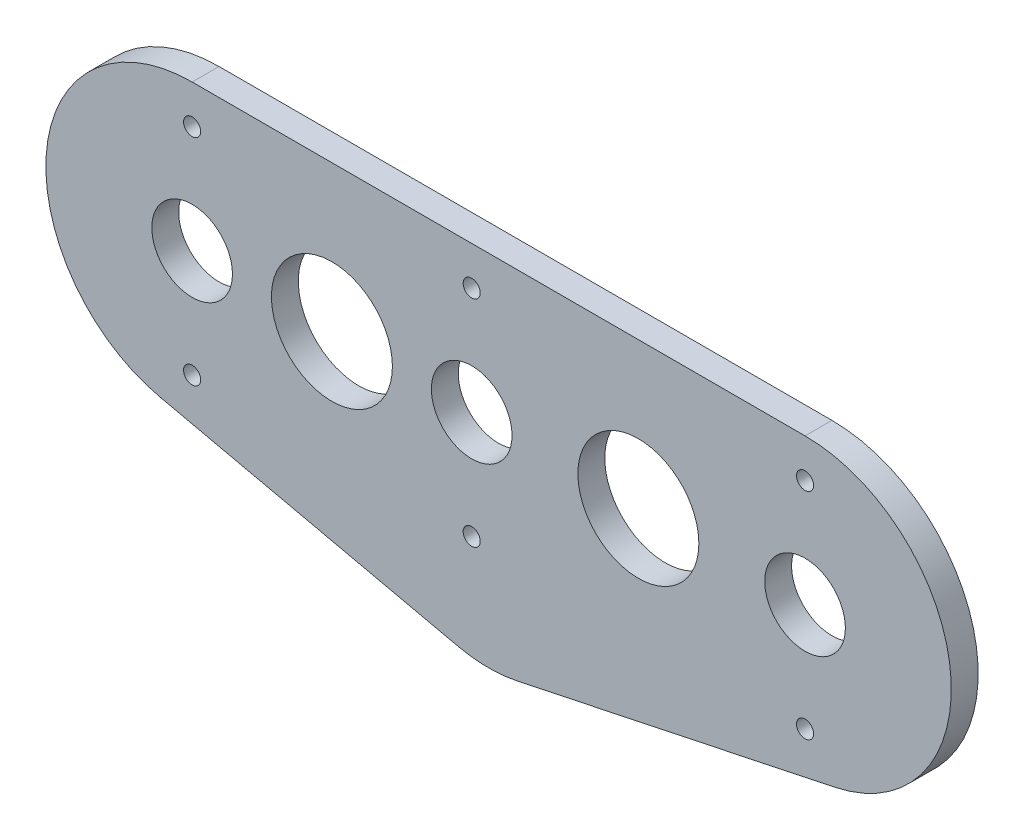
ISO-10303-21;
HEADER;
FILE_DESCRIPTION(('STEP AP214'),'2;1');
FILE_NAME('part.step','',(''),(''),'','','');
FILE_SCHEMA(('AUTOMOTIVE_DESIGN { 1 0 10303 214 1 1 1 1 }'));
ENDSEC;
DATA;
#1=APPLICATION_CONTEXT('core data for automotive mechanical design processes');
#2=APPLICATION_PROTOCOL_DEFINITION('international standard','automotive_design',2000,#1);
#3=PRODUCT_CONTEXT('',#1,'mechanical');
#4=PRODUCT('Part','Part','',(#3));
#5=PRODUCT_RELATED_PRODUCT_CATEGORY('part','',(#4));
#6=PRODUCT_DEFINITION_FORMATION('','',#4);
#7=PRODUCT_DEFINITION_CONTEXT('part definition',#1,'design');
#8=PRODUCT_DEFINITION('design','',#6,#7);
#9=PRODUCT_DEFINITION_SHAPE('','',#8);
#10=(LENGTH_UNIT() NAMED_UNIT(*) SI_UNIT(.MILLI.,.METRE.));
#11=(NAMED_UNIT(*) PLANE_ANGLE_UNIT() SI_UNIT($,.RADIAN.));
#12=(NAMED_UNIT(*) SI_UNIT($,.STERADIAN.) SOLID_ANGLE_UNIT());
#13=UNCERTAINTY_MEASURE_WITH_UNIT(LENGTH_MEASURE(1.E-05),#10,'distance_accuracy_value','');
#14=(GEOMETRIC_REPRESENTATION_CONTEXT(3) GLOBAL_UNCERTAINTY_ASSIGNED_CONTEXT((#13)) GLOBAL_UNIT_ASSIGNED_CONTEXT((#10,
#11,#12)) REPRESENTATION_CONTEXT('',''));
#15=CARTESIAN_POINT('',(0.,0.,0.));
#16=DIRECTION('',(0.,0.,1.));
#17=DIRECTION('',(1.,0.,0.));
#18=AXIS2_PLACEMENT_3D('',#15,#16,#17);
#19=CARTESIAN_POINT('',(-3.99098198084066,-8.12799999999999,4.7625));
#20=DIRECTION('',(0.,0.,-1.));
#21=DIRECTION('',(-1.,0.,0.));
#22=AXIS2_PLACEMENT_3D('',#19,#20,#21);
#23=CYLINDRICAL_SURFACE('',#22,7.9375);
#24=CARTESIAN_POINT('',(-3.99098198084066,-8.12799999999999,4.7625));
#25=DIRECTION('',(0.,0.,-1.));
#26=DIRECTION('',(-1.,0.,0.));
#27=AXIS2_PLACEMENT_3D('',#24,#25,#26);
#28=CIRCLE('',#27,7.9375);
#29=CARTESIAN_POINT('',(-6.37223198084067,-15.699892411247,4.7625));
#30=VERTEX_POINT('',#29);
#31=CARTESIAN_POINT('',(-9.93310093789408,-2.86538386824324,4.7625));
#32=VERTEX_POINT('',#31);
#33=EDGE_CURVE('E2206',#30,#32,#28,.T.);
#34=ORIENTED_EDGE('',*,*,#33,.T.);
#35=DIRECTION('',(0.,0.,-1.));
#36=VECTOR('',#35,1.);
#37=CARTESIAN_POINT('',(-9.93310093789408,-2.86538386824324,13.7967831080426));
#38=LINE('',#37,#36);
#39=CARTESIAN_POINT('',(-9.93310093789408,-2.86538386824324,0.));
#40=VERTEX_POINT('',#39);
#41=EDGE_CURVE('E173',#32,#40,#38,.T.);
#42=ORIENTED_EDGE('',*,*,#41,.T.);
#43=CARTESIAN_POINT('',(-3.99098198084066,-8.12799999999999,0.));
#44=DIRECTION('',(0.,0.,-1.));
#45=DIRECTION('',(-1.,0.,0.));
#46=AXIS2_PLACEMENT_3D('',#43,#44,#45);
#47=CIRCLE('',#46,7.9375);
#48=CARTESIAN_POINT('',(-6.37223198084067,-15.699892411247,0.));
#49=VERTEX_POINT('',#48);
#50=EDGE_CURVE('E1030',#49,#40,#47,.T.);
#51=ORIENTED_EDGE('',*,*,#50,.F.);
#52=DIRECTION('',(0.,0.,-1.));
#53=VECTOR('',#52,1.);
#54=CARTESIAN_POINT('',(-6.37223198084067,-15.699892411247,4.7625));
#55=LINE('',#54,#53);
#56=EDGE_CURVE('E1054',#30,#49,#55,.T.);
#57=ORIENTED_EDGE('',*,*,#56,.F.);
#58=EDGE_LOOP('',(#34,#42,#51,#57));
#59=FACE_BOUND('',#58,.T.);
#60=ADVANCED_FACE('F154',(#59),#23,.T.);
#61=CARTESIAN_POINT('',(0.,0.,4.7625));
#62=DIRECTION('',(0.,0.,-1.));
#63=DIRECTION('',(-1.,0.,0.));
#64=AXIS2_PLACEMENT_3D('',#61,#62,#63);
#65=PLANE('',#64);
#66=CARTESIAN_POINT('',(-3.99098198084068,17.272,4.7625));
#67=DIRECTION('',(0.,0.,-1.));
#68=DIRECTION('',(-1.,0.,0.));
#69=AXIS2_PLACEMENT_3D('',#66,#67,#68);
#70=CIRCLE('',#69,15.875);
#71=CARTESIAN_POINT('',(-11.0831884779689,3.06931602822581,4.7625));
#72=VERTEX_POINT('',#71);
#73=CARTESIAN_POINT('',(-14.7388592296,5.58873163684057,4.7625));
#74=VERTEX_POINT('',#73);
#75=EDGE_CURVE('E2203',#72,#74,#70,.T.);
#76=ORIENTED_EDGE('',*,*,#75,.F.);
#77=CARTESIAN_POINT('',(-12.7853180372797,-0.339328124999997,4.7625));
#78=DIRECTION('',(0.,0.,-1.));
#79=DIRECTION('',(-1.,0.,0.));
#80=AXIS2_PLACEMENT_3D('',#77,#78,#79);
#81=CIRCLE('',#80,3.81);
#82=EDGE_CURVE('E1017',#32,#72,#81,.F.);
#83=ORIENTED_EDGE('',*,*,#82,.F.);
#84=ORIENTED_EDGE('',*,*,#33,.F.);
#85=CARTESIAN_POINT('',(-10.1808865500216,-15.5986482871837,4.7625));
#86=DIRECTION('',(0.,0.,-1.));
#87=DIRECTION('',(-1.,0.,0.));
#88=AXIS2_PLACEMENT_3D('',#85,#86,#87);
#89=CIRCLE('',#88,3.81);
#90=CARTESIAN_POINT('',(-12.4657250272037,-18.6475190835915,4.7625));
#91=VERTEX_POINT('',#90);
#92=EDGE_CURVE('E1455',#30,#91,#89,.T.);
#93=ORIENTED_EDGE('',*,*,#92,.T.);
#94=DIRECTION('',(-0.800228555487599,0.599695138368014,0.));
#95=VECTOR('',#94,1.);
#96=CARTESIAN_POINT('',(-13.4319189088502,-17.9234487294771,4.7625));
#97=LINE('',#96,#95);
#98=CARTESIAN_POINT('',(-27.6469115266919,-7.2706647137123,4.7625));
#99=VERTEX_POINT('',#98);
#100=EDGE_CURVE('E1059',#91,#99,#97,.T.);
#101=ORIENTED_EDGE('',*,*,#100,.T.);
#102=CARTESIAN_POINT('',(-25.3620730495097,-4.22179391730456,4.7625));
#103=DIRECTION('',(0.,0.,-1.));
#104=DIRECTION('',(-1.,0.,0.));
#105=AXIS2_PLACEMENT_3D('',#102,#103,#104);
#106=CIRCLE('',#105,3.81);
#107=CARTESIAN_POINT('',(-27.1774874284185,-0.872111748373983,4.7625));
#108=VERTEX_POINT('',#107);
#109=EDGE_CURVE('E1462',#99,#108,#106,.T.);
#110=ORIENTED_EDGE('',*,*,#109,.T.);
#111=CARTESIAN_POINT('',(-37.0109819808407,17.272,4.7625));
#112=DIRECTION('',(0.,0.,-1.));
#113=DIRECTION('',(-1.,0.,0.));
#114=AXIS2_PLACEMENT_3D('',#111,#112,#113);
#115=CIRCLE('',#114,20.6375);
#116=CARTESIAN_POINT('',(-20.3873314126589,5.04250090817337,4.7625));
#117=VERTEX_POINT('',#116);
#118=EDGE_CURVE('E1053',#117,#108,#115,.T.);
#119=ORIENTED_EDGE('',*,*,#118,.F.);
#120=CARTESIAN_POINT('',(-17.3183497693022,2.78474722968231,4.7625));
#121=DIRECTION('',(0.,0.,-1.));
#122=DIRECTION('',(-1.,0.,0.));
#123=AXIS2_PLACEMENT_3D('',#120,#121,#122);
#124=CIRCLE('',#123,3.81);
#125=EDGE_CURVE('E1458',#117,#74,#124,.T.);
#126=ORIENTED_EDGE('',*,*,#125,.T.);
#127=EDGE_LOOP('',(#76,#83,#84,#93,#101,#110,#119,#126));
#128=FACE_BOUND('',#127,.T.);
#129=ADVANCED_FACE('F2214',(#128),#65,.T.);
#130=CARTESIAN_POINT('',(-70.0309819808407,17.272,4.7625));
#131=DIRECTION('',(0.,0.,-1.));
#132=DIRECTION('',(-1.,0.,0.));
#133=AXIS2_PLACEMENT_3D('',#130,#131,#132);
#134=CYLINDRICAL_SURFACE('',#133,15.875);
#135=CARTESIAN_POINT('',(-70.0309819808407,17.272,4.7625));
#136=DIRECTION('',(0.,0.,-1.));
#137=DIRECTION('',(-1.,0.,0.));
#138=AXIS2_PLACEMENT_3D('',#135,#136,#137);
#139=CIRCLE('',#138,15.875);
#140=CARTESIAN_POINT('',(-59.2831047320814,5.58873163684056,4.7625));
#141=VERTEX_POINT('',#140);
#142=CARTESIAN_POINT('',(-62.9387754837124,3.06931602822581,4.7625));
#143=VERTEX_POINT('',#142);
#144=EDGE_CURVE('E2148',#141,#143,#139,.T.);
#145=ORIENTED_EDGE('',*,*,#144,.T.);
#146=DIRECTION('',(0.,0.,-1.));
#147=VECTOR('',#146,1.);
#148=CARTESIAN_POINT('',(-62.9387754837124,3.0693160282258,13.7967831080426));
#149=LINE('',#148,#147);
#150=CARTESIAN_POINT('',(-62.9387754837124,3.0693160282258,0.));
#151=VERTEX_POINT('',#150);
#152=EDGE_CURVE('E3823',#143,#151,#149,.T.);
#153=ORIENTED_EDGE('',*,*,#152,.T.);
#154=CARTESIAN_POINT('',(-70.0309819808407,17.272,0.));
#155=DIRECTION('',(0.,0.,-1.));
#156=DIRECTION('',(-1.,0.,0.));
#157=AXIS2_PLACEMENT_3D('',#154,#155,#156);
#158=CIRCLE('',#157,15.875);
#159=CARTESIAN_POINT('',(-59.2831047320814,5.58873163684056,0.));
#160=VERTEX_POINT('',#159);
#161=EDGE_CURVE('E2135',#160,#151,#158,.T.);
#162=ORIENTED_EDGE('',*,*,#161,.F.);
#163=DIRECTION('',(0.,0.,-1.));
#164=VECTOR('',#163,1.);
#165=CARTESIAN_POINT('',(-59.2831047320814,5.58873163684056,4.7625));
#166=LINE('',#165,#164);
#167=EDGE_CURVE('E1523',#160,#141,#166,.F.);
#168=ORIENTED_EDGE('',*,*,#167,.T.);
#169=EDGE_LOOP('',(#145,#153,#162,#168));
#170=FACE_BOUND('',#169,.T.);
#171=ADVANCED_FACE('F2255',(#170),#134,.T.);
#172=CARTESIAN_POINT('',(0.,0.,4.7625));
#173=DIRECTION('',(0.,0.,-1.));
#174=DIRECTION('',(-1.,0.,0.));
#175=AXIS2_PLACEMENT_3D('',#172,#173,#174);
#176=PLANE('',#175);
#177=CARTESIAN_POINT('',(-70.0309819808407,-8.12799999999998,4.7625));
#178=DIRECTION('',(0.,0.,-1.));
#179=DIRECTION('',(-1.,0.,0.));
#180=AXIS2_PLACEMENT_3D('',#177,#178,#179);
#181=CIRCLE('',#180,7.93749999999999);
#182=CARTESIAN_POINT('',(-64.0888630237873,-2.86538386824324,4.7625));
#183=VERTEX_POINT('',#182);
#184=CARTESIAN_POINT('',(-62.5898931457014,-5.36501190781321,4.7625));
#185=VERTEX_POINT('',#184);
#186=EDGE_CURVE('E2161',#183,#185,#181,.T.);
#187=ORIENTED_EDGE('',*,*,#186,.F.);
#188=CARTESIAN_POINT('',(-61.2366459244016,-0.339328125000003,4.7625));
#189=DIRECTION('',(0.,0.,-1.));
#190=DIRECTION('',(-1.,0.,0.));
#191=AXIS2_PLACEMENT_3D('',#188,#189,#190);
#192=CIRCLE('',#191,3.81000000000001);
#193=EDGE_CURVE('E3817',#143,#183,#192,.F.);
#194=ORIENTED_EDGE('',*,*,#193,.F.);
#195=ORIENTED_EDGE('',*,*,#144,.F.);
#196=CARTESIAN_POINT('',(-56.7036141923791,2.7847472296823,4.7625));
#197=DIRECTION('',(0.,0.,-1.));
#198=DIRECTION('',(-1.,0.,0.));
#199=AXIS2_PLACEMENT_3D('',#196,#197,#198);
#200=CIRCLE('',#199,3.81);
#201=CARTESIAN_POINT('',(-53.6346325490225,5.04250090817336,4.7625));
#202=VERTEX_POINT('',#201);
#203=EDGE_CURVE('E1506',#141,#202,#200,.T.);
#204=ORIENTED_EDGE('',*,*,#203,.T.);
#205=CARTESIAN_POINT('',(-37.0109819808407,17.272,4.7625));
#206=DIRECTION('',(0.,0.,-1.));
#207=DIRECTION('',(-1.,0.,0.));
#208=AXIS2_PLACEMENT_3D('',#205,#206,#207);
#209=CIRCLE('',#208,20.6375);
#210=CARTESIAN_POINT('',(-50.5789122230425,1.72151205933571,4.7625));
#211=VERTEX_POINT('',#210);
#212=EDGE_CURVE('E2152',#211,#202,#209,.T.);
#213=ORIENTED_EDGE('',*,*,#212,.F.);
#214=CARTESIAN_POINT('',(-53.0837608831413,-1.14934725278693,4.7625));
#215=DIRECTION('',(0.,0.,-1.));
#216=DIRECTION('',(-1.,0.,0.));
#217=AXIS2_PLACEMENT_3D('',#214,#215,#216);
#218=CIRCLE('',#217,3.81);
#219=CARTESIAN_POINT('',(-51.4158868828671,-4.57488316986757,4.7625));
#220=VERTEX_POINT('',#219);
#221=EDGE_CURVE('E1509',#211,#220,#218,.T.);
#222=ORIENTED_EDGE('',*,*,#221,.T.);
#223=DIRECTION('',(-0.899090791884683,-0.437762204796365,0.));
#224=VECTOR('',#223,1.);
#225=CARTESIAN_POINT('',(-8.05250297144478,16.538502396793,4.7625));
#226=LINE('',#225,#224);
#227=CARTESIAN_POINT('',(-57.3502965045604,-7.4643135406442,4.7625));
#228=VERTEX_POINT('',#227);
#229=EDGE_CURVE('E2157',#220,#228,#226,.T.);
#230=ORIENTED_EDGE('',*,*,#229,.T.);
#231=CARTESIAN_POINT('',(-59.0181705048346,-4.03877762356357,4.7625));
#232=DIRECTION('',(0.,0.,-1.));
#233=DIRECTION('',(-1.,0.,0.));
#234=AXIS2_PLACEMENT_3D('',#231,#232,#233);
#235=CIRCLE('',#234,3.81);
#236=EDGE_CURVE('E1512',#228,#185,#235,.T.);
#237=ORIENTED_EDGE('',*,*,#236,.T.);
#238=EDGE_LOOP('',(#187,#194,#195,#204,#213,#222,#230,#237));
#239=FACE_BOUND('',#238,.T.);
#240=ADVANCED_FACE('F2717',(#239),#176,.T.);
#241=CARTESIAN_POINT('',(0.,0.,4.7625));
#242=DIRECTION('',(0.,0.,-1.));
#243=DIRECTION('',(-1.,0.,0.));
#244=AXIS2_PLACEMENT_3D('',#241,#242,#243);
#245=PLANE('',#244);
#246=CARTESIAN_POINT('',(-70.0309819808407,17.272,4.7625));
#247=DIRECTION('',(0.,0.,-1.));
#248=DIRECTION('',(-1.,0.,0.));
#249=AXIS2_PLACEMENT_3D('',#246,#247,#248);
#250=CIRCLE('',#249,15.875);
#251=CARTESIAN_POINT('',(-77.123188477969,3.06931602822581,4.7625));
#252=VERTEX_POINT('',#251);
#253=CARTESIAN_POINT('',(-77.1231884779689,31.4746839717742,4.7625));
#254=VERTEX_POINT('',#253);
#255=EDGE_CURVE('E2120',#252,#254,#250,.T.);
#256=ORIENTED_EDGE('',*,*,#255,.F.);
#257=CARTESIAN_POINT('',(-78.8253180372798,-0.339328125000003,4.7625));
#258=DIRECTION('',(0.,0.,-1.));
#259=DIRECTION('',(-1.,0.,0.));
#260=AXIS2_PLACEMENT_3D('',#257,#258,#259);
#261=CIRCLE('',#260,3.81);
#262=CARTESIAN_POINT('',(-75.9731009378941,-2.86538386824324,4.7625));
#263=VERTEX_POINT('',#262);
#264=EDGE_CURVE('E3804',#263,#252,#261,.F.);
#265=ORIENTED_EDGE('',*,*,#264,.F.);
#266=CARTESIAN_POINT('',(-70.0309819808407,-8.12799999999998,4.7625));
#267=DIRECTION('',(0.,0.,-1.));
#268=DIRECTION('',(-1.,0.,0.));
#269=AXIS2_PLACEMENT_3D('',#266,#267,#268);
#270=CIRCLE('',#269,7.93749999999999);
#271=CARTESIAN_POINT('',(-77.8358346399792,-6.68294594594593,4.7625));
#272=VERTEX_POINT('',#271);
#273=EDGE_CURVE('E2123',#272,#263,#270,.T.);
#274=ORIENTED_EDGE('',*,*,#273,.F.);
#275=CARTESIAN_POINT('',(-81.5821639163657,-5.98931999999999,4.7625));
#276=DIRECTION('',(0.,0.,-1.));
#277=DIRECTION('',(-1.,0.,0.));
#278=AXIS2_PLACEMENT_3D('',#275,#276,#277);
#279=CIRCLE('',#278,3.81);
#280=CARTESIAN_POINT('',(-83.2767138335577,-9.40173858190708,4.7625));
#281=VERTEX_POINT('',#280);
#282=EDGE_CURVE('E1539',#272,#281,#279,.T.);
#283=ORIENTED_EDGE('',*,*,#282,.T.);
#284=CARTESIAN_POINT('',(-70.0309819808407,17.272,4.7625));
#285=DIRECTION('',(0.,0.,-1.));
#286=DIRECTION('',(-1.,0.,0.));
#287=AXIS2_PLACEMENT_3D('',#284,#285,#286);
#288=CIRCLE('',#287,29.7815);
#289=CARTESIAN_POINT('',(-83.2767138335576,43.9457385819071,4.7625));
#290=VERTEX_POINT('',#289);
#291=EDGE_CURVE('E2128',#281,#290,#288,.T.);
#292=ORIENTED_EDGE('',*,*,#291,.T.);
#293=CARTESIAN_POINT('',(-81.5821639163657,40.53332,4.7625));
#294=DIRECTION('',(0.,0.,-1.));
#295=DIRECTION('',(-1.,0.,0.));
#296=AXIS2_PLACEMENT_3D('',#293,#294,#295);
#297=CIRCLE('',#296,3.81);
#298=CARTESIAN_POINT('',(-77.8358346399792,41.2269459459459,4.7625));
#299=VERTEX_POINT('',#298);
#300=EDGE_CURVE('E1535',#290,#299,#297,.T.);
#301=ORIENTED_EDGE('',*,*,#300,.T.);
#302=CARTESIAN_POINT('',(-70.0309819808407,42.672,4.7625));
#303=DIRECTION('',(0.,0.,-1.));
#304=DIRECTION('',(-1.,0.,0.));
#305=AXIS2_PLACEMENT_3D('',#302,#303,#304);
#306=CIRCLE('',#305,7.93749999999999);
#307=CARTESIAN_POINT('',(-75.9731009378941,37.4093838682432,4.7625));
#308=VERTEX_POINT('',#307);
#309=EDGE_CURVE('E2132',#308,#299,#306,.T.);
#310=ORIENTED_EDGE('',*,*,#309,.F.);
#311=CARTESIAN_POINT('',(-78.8253180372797,34.883328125,4.7625));
#312=DIRECTION('',(0.,0.,-1.));
#313=DIRECTION('',(-1.,0.,0.));
#314=AXIS2_PLACEMENT_3D('',#311,#312,#313);
#315=CIRCLE('',#314,3.81);
#316=EDGE_CURVE('E3790',#254,#308,#315,.F.);
#317=ORIENTED_EDGE('',*,*,#316,.F.);
#318=EDGE_LOOP('',(#256,#265,#274,#283,#292,#301,#310,#317));
#319=FACE_BOUND('',#318,.T.);
#320=ADVANCED_FACE('F2713',(#319),#245,.T.);
#321=CARTESIAN_POINT('',(-70.0309819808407,-8.12799999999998,4.7625));
#322=DIRECTION('',(0.,0.,-1.));
#323=DIRECTION('',(-1.,0.,0.));
#324=AXIS2_PLACEMENT_3D('',#321,#322,#323);
#325=CYLINDRICAL_SURFACE('',#324,7.93749999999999);
#326=ORIENTED_EDGE('',*,*,#273,.T.);
#327=DIRECTION('',(0.,0.,-1.));
#328=VECTOR('',#327,1.);
#329=CARTESIAN_POINT('',(-75.9731009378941,-2.86538386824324,13.7967831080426));
#330=LINE('',#329,#328);
#331=CARTESIAN_POINT('',(-75.9731009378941,-2.86538386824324,0.));
#332=VERTEX_POINT('',#331);
#333=EDGE_CURVE('E3810',#263,#332,#330,.T.);
#334=ORIENTED_EDGE('',*,*,#333,.T.);
#335=CARTESIAN_POINT('',(-70.0309819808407,-8.12799999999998,0.));
#336=DIRECTION('',(0.,0.,-1.));
#337=DIRECTION('',(-1.,0.,0.));
#338=AXIS2_PLACEMENT_3D('',#335,#336,#337);
#339=CIRCLE('',#338,7.93749999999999);
#340=CARTESIAN_POINT('',(-77.8358346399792,-6.68294594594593,0.));
#341=VERTEX_POINT('',#340);
#342=EDGE_CURVE('E2138',#341,#332,#339,.T.);
#343=ORIENTED_EDGE('',*,*,#342,.F.);
#344=DIRECTION('',(0.,0.,-1.));
#345=VECTOR('',#344,1.);
#346=CARTESIAN_POINT('',(-77.8358346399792,-6.68294594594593,4.7625));
#347=LINE('',#346,#345);
#348=EDGE_CURVE('E1532',#341,#272,#347,.F.);
#349=ORIENTED_EDGE('',*,*,#348,.T.);
#350=EDGE_LOOP('',(#326,#334,#343,#349));
#351=FACE_BOUND('',#350,.T.);
#352=ADVANCED_FACE('F2716',(#351),#325,.T.);
#353=CARTESIAN_POINT('',(-70.0309819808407,17.272,4.7625));
#354=DIRECTION('',(0.,0.,-1.));
#355=DIRECTION('',(-1.,0.,0.));
#356=AXIS2_PLACEMENT_3D('',#353,#354,#355);
#357=CYLINDRICAL_SURFACE('',#356,15.875);
#358=DIRECTION('',(0.,0.,-1.));
#359=VECTOR('',#358,1.);
#360=CARTESIAN_POINT('',(-77.123188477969,3.06931602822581,13.7967831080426));
#361=LINE('',#360,#359);
#362=CARTESIAN_POINT('',(-77.123188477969,3.06931602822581,0.));
#363=VERTEX_POINT('',#362);
#364=EDGE_CURVE('E3807',#252,#363,#361,.T.);
#365=ORIENTED_EDGE('',*,*,#364,.F.);
#366=ORIENTED_EDGE('',*,*,#255,.T.);
#367=DIRECTION('',(0.,0.,-1.));
#368=VECTOR('',#367,1.);
#369=CARTESIAN_POINT('',(-77.1231884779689,31.4746839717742,13.7967831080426));
#370=LINE('',#369,#368);
#371=CARTESIAN_POINT('',(-77.1231884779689,31.4746839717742,0.));
#372=VERTEX_POINT('',#371);
#373=EDGE_CURVE('E3796',#254,#372,#370,.T.);
#374=ORIENTED_EDGE('',*,*,#373,.T.);
#375=CARTESIAN_POINT('',(-70.0309819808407,17.272,0.));
#376=DIRECTION('',(0.,0.,-1.));
#377=DIRECTION('',(-1.,0.,0.));
#378=AXIS2_PLACEMENT_3D('',#375,#376,#377);
#379=CIRCLE('',#378,15.875);
#380=EDGE_CURVE('E2102',#363,#372,#379,.T.);
#381=ORIENTED_EDGE('',*,*,#380,.F.);
#382=EDGE_LOOP('',(#365,#366,#374,#381));
#383=FACE_BOUND('',#382,.T.);
#384=ADVANCED_FACE('F2707',(#383),#357,.T.);
#385=CARTESIAN_POINT('',(-70.0309819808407,42.672,4.7625));
#386=DIRECTION('',(0.,0.,-1.));
#387=DIRECTION('',(-1.,0.,0.));
#388=AXIS2_PLACEMENT_3D('',#385,#386,#387);
#389=CYLINDRICAL_SURFACE('',#388,7.93749999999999);
#390=CARTESIAN_POINT('',(-70.0309819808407,42.672,4.7625));
#391=DIRECTION('',(0.,0.,-1.));
#392=DIRECTION('',(-1.,0.,0.));
#393=AXIS2_PLACEMENT_3D('',#390,#391,#392);
#394=CIRCLE('',#393,7.93749999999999);
#395=CARTESIAN_POINT('',(-62.1028803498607,43.0581486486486,4.7625));
#396=VERTEX_POINT('',#395);
#397=CARTESIAN_POINT('',(-64.0888630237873,37.4093838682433,4.7625));
#398=VERTEX_POINT('',#397);
#399=EDGE_CURVE('E2085',#396,#398,#394,.T.);
#400=ORIENTED_EDGE('',*,*,#399,.T.);
#401=DIRECTION('',(0.,0.,-1.));
#402=VECTOR('',#401,1.);
#403=CARTESIAN_POINT('',(-64.0888630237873,37.4093838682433,13.7967831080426));
#404=LINE('',#403,#402);
#405=CARTESIAN_POINT('',(-64.0888630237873,37.4093838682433,0.));
#406=VERTEX_POINT('',#405);
#407=EDGE_CURVE('E3783',#398,#406,#404,.T.);
#408=ORIENTED_EDGE('',*,*,#407,.T.);
#409=CARTESIAN_POINT('',(-70.0309819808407,42.672,0.));
#410=DIRECTION('',(0.,0.,-1.));
#411=DIRECTION('',(-1.,0.,0.));
#412=AXIS2_PLACEMENT_3D('',#409,#410,#411);
#413=CIRCLE('',#412,7.93749999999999);
#414=CARTESIAN_POINT('',(-62.1028803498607,43.0581486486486,0.));
#415=VERTEX_POINT('',#414);
#416=EDGE_CURVE('E2105',#415,#406,#413,.T.);
#417=ORIENTED_EDGE('',*,*,#416,.F.);
#418=DIRECTION('',(0.,0.,-1.));
#419=VECTOR('',#418,1.);
#420=CARTESIAN_POINT('',(-62.1028803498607,43.0581486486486,4.7625));
#421=LINE('',#420,#419);
#422=EDGE_CURVE('E1570',#415,#396,#421,.F.);
#423=ORIENTED_EDGE('',*,*,#422,.T.);
#424=EDGE_LOOP('',(#400,#408,#417,#423));
#425=FACE_BOUND('',#424,.T.);
#426=ADVANCED_FACE('F2691',(#425),#389,.T.);
#427=CARTESIAN_POINT('',(0.,0.,4.7625));
#428=DIRECTION('',(0.,0.,-1.));
#429=DIRECTION('',(-1.,0.,0.));
#430=AXIS2_PLACEMENT_3D('',#427,#428,#429);
#431=PLANE('',#430);
#432=CARTESIAN_POINT('',(-70.0309819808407,17.272,4.7625));
#433=DIRECTION('',(0.,0.,-1.));
#434=DIRECTION('',(-1.,0.,0.));
#435=AXIS2_PLACEMENT_3D('',#432,#433,#434);
#436=CIRCLE('',#435,15.875);
#437=CARTESIAN_POINT('',(-62.9387754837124,31.4746839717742,4.7625));
#438=VERTEX_POINT('',#437);
#439=CARTESIAN_POINT('',(-59.2831047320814,28.9552683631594,4.7625));
#440=VERTEX_POINT('',#439);
#441=EDGE_CURVE('E2082',#438,#440,#436,.T.);
#442=ORIENTED_EDGE('',*,*,#441,.F.);
#443=CARTESIAN_POINT('',(-61.2366459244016,34.883328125,4.7625));
#444=DIRECTION('',(0.,0.,-1.));
#445=DIRECTION('',(-1.,0.,0.));
#446=AXIS2_PLACEMENT_3D('',#443,#444,#445);
#447=CIRCLE('',#446,3.81000000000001);
#448=EDGE_CURVE('E3777',#398,#438,#447,.F.);
#449=ORIENTED_EDGE('',*,*,#448,.F.);
#450=ORIENTED_EDGE('',*,*,#399,.F.);
#451=CARTESIAN_POINT('',(-58.2973915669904,43.2435,4.7625));
#452=DIRECTION('',(0.,0.,-1.));
#453=DIRECTION('',(-1.,0.,0.));
#454=AXIS2_PLACEMENT_3D('',#451,#452,#453);
#455=CIRCLE('',#454,3.81);
#456=CARTESIAN_POINT('',(-58.2973915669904,47.0535,4.7625));
#457=VERTEX_POINT('',#456);
#458=EDGE_CURVE('E1563',#396,#457,#455,.T.);
#459=ORIENTED_EDGE('',*,*,#458,.T.);
#460=DIRECTION('',(1.,0.,0.));
#461=VECTOR('',#460,1.);
#462=CARTESIAN_POINT('',(0.,47.0535,4.7625));
#463=LINE('',#462,#461);
#464=CARTESIAN_POINT('',(-43.2022319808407,47.0535,4.7625));
#465=VERTEX_POINT('',#464);
#466=EDGE_CURVE('E2090',#457,#465,#463,.T.);
#467=ORIENTED_EDGE('',*,*,#466,.T.);
#468=CARTESIAN_POINT('',(-43.2022319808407,43.2435,4.7625));
#469=DIRECTION('',(0.,0.,-1.));
#470=DIRECTION('',(-1.,0.,0.));
#471=AXIS2_PLACEMENT_3D('',#468,#469,#470);
#472=CIRCLE('',#471,3.81);
#473=CARTESIAN_POINT('',(-39.3922319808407,43.2435,4.7625));
#474=VERTEX_POINT('',#473);
#475=EDGE_CURVE('E1560',#465,#474,#472,.T.);
#476=ORIENTED_EDGE('',*,*,#475,.T.);
#477=DIRECTION('',(0.,-1.,0.));
#478=VECTOR('',#477,1.);
#479=CARTESIAN_POINT('',(-39.3922319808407,0.,4.7625));
#480=LINE('',#479,#478);
#481=CARTESIAN_POINT('',(-39.3922319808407,40.9225534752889,4.7625));
#482=VERTEX_POINT('',#481);
#483=EDGE_CURVE('E2094',#474,#482,#480,.T.);
#484=ORIENTED_EDGE('',*,*,#483,.T.);
#485=CARTESIAN_POINT('',(-43.2022319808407,40.9225534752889,4.7625));
#486=DIRECTION('',(0.,0.,-1.));
#487=DIRECTION('',(-1.,0.,0.));
#488=AXIS2_PLACEMENT_3D('',#485,#486,#487);
#489=CIRCLE('',#488,3.81);
#490=CARTESIAN_POINT('',(-42.2373618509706,37.2367529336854,4.7625));
#491=VERTEX_POINT('',#490);
#492=EDGE_CURVE('E1557',#482,#491,#489,.T.);
#493=ORIENTED_EDGE('',*,*,#492,.T.);
#494=CARTESIAN_POINT('',(-37.0109819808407,17.272,4.7625));
#495=DIRECTION('',(0.,0.,-1.));
#496=DIRECTION('',(-1.,0.,0.));
#497=AXIS2_PLACEMENT_3D('',#494,#495,#496);
#498=CIRCLE('',#497,20.6375);
#499=CARTESIAN_POINT('',(-53.6346325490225,29.5014990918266,4.7625));
#500=VERTEX_POINT('',#499);
#501=EDGE_CURVE('E2098',#500,#491,#498,.T.);
#502=ORIENTED_EDGE('',*,*,#501,.F.);
#503=CARTESIAN_POINT('',(-56.7036141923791,31.7592527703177,4.7625));
#504=DIRECTION('',(0.,0.,-1.));
#505=DIRECTION('',(-1.,0.,0.));
#506=AXIS2_PLACEMENT_3D('',#503,#504,#505);
#507=CIRCLE('',#506,3.81);
#508=EDGE_CURVE('E1566',#500,#440,#507,.T.);
#509=ORIENTED_EDGE('',*,*,#508,.T.);
#510=EDGE_LOOP('',(#442,#449,#450,#459,#467,#476,#484,#493,#502,#509));
#511=FACE_BOUND('',#510,.T.);
#512=ADVANCED_FACE('F2671',(#511),#431,.T.);
#513=CARTESIAN_POINT('',(-3.99098198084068,17.272,4.7625));
#514=DIRECTION('',(0.,0.,-1.));
#515=DIRECTION('',(-1.,0.,0.));
#516=AXIS2_PLACEMENT_3D('',#513,#514,#515);
#517=CYLINDRICAL_SURFACE('',#516,15.875);
#518=CARTESIAN_POINT('',(-3.99098198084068,17.272,4.7625));
#519=DIRECTION('',(0.,0.,-1.));
#520=DIRECTION('',(-1.,0.,0.));
#521=AXIS2_PLACEMENT_3D('',#518,#519,#520);
#522=CIRCLE('',#521,15.875);
#523=CARTESIAN_POINT('',(-14.7388592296,28.9552683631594,4.7625));
#524=VERTEX_POINT('',#523);
#525=CARTESIAN_POINT('',(-11.083188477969,31.4746839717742,4.7625));
#526=VERTEX_POINT('',#525);
#527=EDGE_CURVE('E2060',#524,#526,#522,.T.);
#528=ORIENTED_EDGE('',*,*,#527,.T.);
#529=DIRECTION('',(0.,0.,-1.));
#530=VECTOR('',#529,1.);
#531=CARTESIAN_POINT('',(-11.083188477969,31.4746839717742,13.7967831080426));
#532=LINE('',#531,#530);
#533=CARTESIAN_POINT('',(-11.083188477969,31.4746839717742,0.));
#534=VERTEX_POINT('',#533);
#535=EDGE_CURVE('E3770',#526,#534,#532,.T.);
#536=ORIENTED_EDGE('',*,*,#535,.T.);
#537=CARTESIAN_POINT('',(-3.99098198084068,17.272,0.));
#538=DIRECTION('',(0.,0.,-1.));
#539=DIRECTION('',(-1.,0.,0.));
#540=AXIS2_PLACEMENT_3D('',#537,#538,#539);
#541=CIRCLE('',#540,15.875);
#542=CARTESIAN_POINT('',(-14.7388592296,28.9552683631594,0.));
#543=VERTEX_POINT('',#542);
#544=EDGE_CURVE('E2049',#543,#534,#541,.T.);
#545=ORIENTED_EDGE('',*,*,#544,.F.);
#546=DIRECTION('',(0.,0.,-1.));
#547=VECTOR('',#546,1.);
#548=CARTESIAN_POINT('',(-14.7388592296,28.9552683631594,4.7625));
#549=LINE('',#548,#547);
#550=EDGE_CURVE('E1623',#543,#524,#549,.F.);
#551=ORIENTED_EDGE('',*,*,#550,.T.);
#552=EDGE_LOOP('',(#528,#536,#545,#551));
#553=FACE_BOUND('',#552,.T.);
#554=ADVANCED_FACE('F2667',(#553),#517,.T.);
#555=CARTESIAN_POINT('',(0.,0.,4.7625));
#556=DIRECTION('',(0.,0.,-1.));
#557=DIRECTION('',(-1.,0.,0.));
#558=AXIS2_PLACEMENT_3D('',#555,#556,#557);
#559=PLANE('',#558);
#560=CARTESIAN_POINT('',(-3.99098198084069,42.672,4.7625));
#561=DIRECTION('',(0.,0.,-1.));
#562=DIRECTION('',(-1.,0.,0.));
#563=AXIS2_PLACEMENT_3D('',#560,#561,#562);
#564=CIRCLE('',#563,7.9375);
#565=CARTESIAN_POINT('',(-9.9331009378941,37.4093838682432,4.7625));
#566=VERTEX_POINT('',#565);
#567=CARTESIAN_POINT('',(-11.9190836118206,43.0581486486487,4.7625));
#568=VERTEX_POINT('',#567);
#569=EDGE_CURVE('E2057',#566,#568,#564,.T.);
#570=ORIENTED_EDGE('',*,*,#569,.F.);
#571=CARTESIAN_POINT('',(-12.7853180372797,34.883328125,4.7625));
#572=DIRECTION('',(0.,0.,-1.));
#573=DIRECTION('',(-1.,0.,0.));
#574=AXIS2_PLACEMENT_3D('',#571,#572,#573);
#575=CIRCLE('',#574,3.81);
#576=EDGE_CURVE('E1921',#526,#566,#575,.F.);
#577=ORIENTED_EDGE('',*,*,#576,.F.);
#578=ORIENTED_EDGE('',*,*,#527,.F.);
#579=CARTESIAN_POINT('',(-17.3183497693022,31.7592527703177,4.7625));
#580=DIRECTION('',(0.,0.,-1.));
#581=DIRECTION('',(-1.,0.,0.));
#582=AXIS2_PLACEMENT_3D('',#579,#580,#581);
#583=CIRCLE('',#582,3.81);
#584=CARTESIAN_POINT('',(-20.3873314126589,29.5014990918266,4.7625));
#585=VERTEX_POINT('',#584);
#586=EDGE_CURVE('E1605',#524,#585,#583,.T.);
#587=ORIENTED_EDGE('',*,*,#586,.T.);
#588=CARTESIAN_POINT('',(-37.0109819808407,17.272,4.7625));
#589=DIRECTION('',(0.,0.,-1.));
#590=DIRECTION('',(-1.,0.,0.));
#591=AXIS2_PLACEMENT_3D('',#588,#589,#590);
#592=CIRCLE('',#591,20.6375);
#593=CARTESIAN_POINT('',(-31.7846021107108,37.2367529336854,4.7625));
#594=VERTEX_POINT('',#593);
#595=EDGE_CURVE('E2044',#594,#585,#592,.T.);
#596=ORIENTED_EDGE('',*,*,#595,.F.);
#597=CARTESIAN_POINT('',(-30.8197319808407,40.9225534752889,4.7625));
#598=DIRECTION('',(0.,0.,-1.));
#599=DIRECTION('',(-1.,0.,0.));
#600=AXIS2_PLACEMENT_3D('',#597,#598,#599);
#601=CIRCLE('',#600,3.81);
#602=CARTESIAN_POINT('',(-34.6297319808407,40.9225534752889,4.7625));
#603=VERTEX_POINT('',#602);
#604=EDGE_CURVE('E1611',#594,#603,#601,.T.);
#605=ORIENTED_EDGE('',*,*,#604,.T.);
#606=DIRECTION('',(0.,-1.,0.));
#607=VECTOR('',#606,1.);
#608=CARTESIAN_POINT('',(-34.6297319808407,0.,4.7625));
#609=LINE('',#608,#607);
#610=CARTESIAN_POINT('',(-34.6297319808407,43.2435,4.7625));
#611=VERTEX_POINT('',#610);
#612=EDGE_CURVE('E2048',#611,#603,#609,.T.);
#613=ORIENTED_EDGE('',*,*,#612,.F.);
#614=CARTESIAN_POINT('',(-30.8197319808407,43.2435,4.7625));
#615=DIRECTION('',(0.,0.,-1.));
#616=DIRECTION('',(-1.,0.,0.));
#617=AXIS2_PLACEMENT_3D('',#614,#615,#616);
#618=CIRCLE('',#617,3.81);
#619=CARTESIAN_POINT('',(-30.8197319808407,47.0535,4.7625));
#620=VERTEX_POINT('',#619);
#621=EDGE_CURVE('E1608',#611,#620,#618,.T.);
#622=ORIENTED_EDGE('',*,*,#621,.T.);
#623=DIRECTION('',(1.,0.,0.));
#624=VECTOR('',#623,1.);
#625=CARTESIAN_POINT('',(0.,47.0535,4.7625));
#626=LINE('',#625,#624);
#627=CARTESIAN_POINT('',(-15.724572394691,47.0535,4.7625));
#628=VERTEX_POINT('',#627);
#629=EDGE_CURVE('E2053',#620,#628,#626,.T.);
#630=ORIENTED_EDGE('',*,*,#629,.T.);
#631=CARTESIAN_POINT('',(-15.724572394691,43.2435,4.7625));
#632=DIRECTION('',(0.,0.,-1.));
#633=DIRECTION('',(-1.,0.,0.));
#634=AXIS2_PLACEMENT_3D('',#631,#632,#633);
#635=CIRCLE('',#634,3.81);
#636=EDGE_CURVE('E1601',#628,#568,#635,.T.);
#637=ORIENTED_EDGE('',*,*,#636,.T.);
#638=EDGE_LOOP('',(#570,#577,#578,#587,#596,#605,#613,#622,#630,#637));
#639=FACE_BOUND('',#638,.T.);
#640=ADVANCED_FACE('F2323',(#639),#559,.T.);
#641=CARTESIAN_POINT('',(0.,0.,4.7625));
#642=DIRECTION('',(0.,0.,-1.));
#643=DIRECTION('',(-1.,0.,0.));
#644=AXIS2_PLACEMENT_3D('',#641,#642,#643);
#645=PLANE('',#644);
#646=CARTESIAN_POINT('',(35.3790180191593,17.272,4.7625));
#647=DIRECTION('',(0.,0.,-1.));
#648=DIRECTION('',(-1.,0.,0.));
#649=AXIS2_PLACEMENT_3D('',#646,#647,#648);
#650=CIRCLE('',#649,20.6375);
#651=CARTESIAN_POINT('',(16.5085012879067,25.6272381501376,4.7625));
#652=VERTEX_POINT('',#651);
#653=CARTESIAN_POINT('',(30.1526381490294,37.2367529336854,4.7625));
#654=VERTEX_POINT('',#653);
#655=EDGE_CURVE('E1171',#652,#654,#650,.T.);
#656=ORIENTED_EDGE('',*,*,#655,.F.);
#657=CARTESIAN_POINT('',(13.0247135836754,27.1697436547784,4.7625));
#658=DIRECTION('',(0.,0.,-1.));
#659=DIRECTION('',(-1.,0.,0.));
#660=AXIS2_PLACEMENT_3D('',#657,#658,#659);
#661=CIRCLE('',#660,3.81);
#662=CARTESIAN_POINT('',(9.73135315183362,25.2540513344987,4.7625));
#663=VERTEX_POINT('',#662);
#664=EDGE_CURVE('E1904',#663,#652,#661,.F.);
#665=ORIENTED_EDGE('',*,*,#664,.F.);
#666=CARTESIAN_POINT('',(-3.99098198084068,17.272,4.7625));
#667=DIRECTION('',(0.,0.,-1.));
#668=DIRECTION('',(-1.,0.,0.));
#669=AXIS2_PLACEMENT_3D('',#666,#667,#668);
#670=CIRCLE('',#669,15.875);
#671=CARTESIAN_POINT('',(3.10122451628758,31.4746839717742,4.7625));
#672=VERTEX_POINT('',#671);
#673=EDGE_CURVE('E1154',#672,#663,#670,.T.);
#674=ORIENTED_EDGE('',*,*,#673,.F.);
#675=CARTESIAN_POINT('',(4.80335407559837,34.883328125,4.7625));
#676=DIRECTION('',(0.,0.,-1.));
#677=DIRECTION('',(-1.,0.,0.));
#678=AXIS2_PLACEMENT_3D('',#675,#676,#677);
#679=CIRCLE('',#678,3.81);
#680=CARTESIAN_POINT('',(1.95113697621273,37.4093838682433,4.7625));
#681=VERTEX_POINT('',#680);
#682=EDGE_CURVE('E1924',#681,#672,#679,.F.);
#683=ORIENTED_EDGE('',*,*,#682,.F.);
#684=CARTESIAN_POINT('',(-3.99098198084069,42.672,4.7625));
#685=DIRECTION('',(0.,0.,-1.));
#686=DIRECTION('',(-1.,0.,0.));
#687=AXIS2_PLACEMENT_3D('',#684,#685,#686);
#688=CIRCLE('',#687,7.9375);
#689=CARTESIAN_POINT('',(3.93711965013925,43.0581486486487,4.7625));
#690=VERTEX_POINT('',#689);
#691=EDGE_CURVE('E1158',#690,#681,#688,.T.);
#692=ORIENTED_EDGE('',*,*,#691,.F.);
#693=CARTESIAN_POINT('',(7.74260843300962,43.2435,4.7625));
#694=DIRECTION('',(0.,0.,-1.));
#695=DIRECTION('',(-1.,0.,0.));
#696=AXIS2_PLACEMENT_3D('',#693,#694,#695);
#697=CIRCLE('',#696,3.81);
#698=CARTESIAN_POINT('',(7.74260843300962,47.0535,4.7625));
#699=VERTEX_POINT('',#698);
#700=EDGE_CURVE('E1647',#690,#699,#697,.T.);
#701=ORIENTED_EDGE('',*,*,#700,.T.);
#702=DIRECTION('',(1.,0.,0.));
#703=VECTOR('',#702,1.);
#704=CARTESIAN_POINT('',(0.,47.0535,4.7625));
#705=LINE('',#704,#703);
#706=CARTESIAN_POINT('',(29.1877680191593,47.0535,4.7625));
#707=VERTEX_POINT('',#706);
#708=EDGE_CURVE('E1163',#699,#707,#705,.T.);
#709=ORIENTED_EDGE('',*,*,#708,.T.);
#710=CARTESIAN_POINT('',(29.1877680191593,43.2435,4.7625));
#711=DIRECTION('',(0.,0.,-1.));
#712=DIRECTION('',(-1.,0.,0.));
#713=AXIS2_PLACEMENT_3D('',#710,#711,#712);
#714=CIRCLE('',#713,3.81);
#715=CARTESIAN_POINT('',(32.9977680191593,43.2435,4.7625));
#716=VERTEX_POINT('',#715);
#717=EDGE_CURVE('E1640',#707,#716,#714,.T.);
#718=ORIENTED_EDGE('',*,*,#717,.T.);
#719=DIRECTION('',(0.,-1.,0.));
#720=VECTOR('',#719,1.);
#721=CARTESIAN_POINT('',(32.9977680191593,0.,4.7625));
#722=LINE('',#721,#720);
#723=CARTESIAN_POINT('',(32.9977680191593,40.9225534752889,4.7625));
#724=VERTEX_POINT('',#723);
#725=EDGE_CURVE('E1167',#716,#724,#722,.T.);
#726=ORIENTED_EDGE('',*,*,#725,.T.);
#727=CARTESIAN_POINT('',(29.1877680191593,40.9225534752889,4.7625));
#728=DIRECTION('',(0.,0.,-1.));
#729=DIRECTION('',(-1.,0.,0.));
#730=AXIS2_PLACEMENT_3D('',#727,#728,#729);
#731=CIRCLE('',#730,3.81);
#732=EDGE_CURVE('E1643',#724,#654,#731,.T.);
#733=ORIENTED_EDGE('',*,*,#732,.T.);
#734=EDGE_LOOP('',(#656,#665,#674,#683,#692,#701,#709,#718,#726,#733));
#735=FACE_BOUND('',#734,.T.);
#736=ADVANCED_FACE('F1893',(#735),#645,.T.);
#737=CARTESIAN_POINT('',(-3.99098198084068,17.272,4.7625));
#738=DIRECTION('',(0.,0.,-1.));
#739=DIRECTION('',(-1.,0.,0.));
#740=AXIS2_PLACEMENT_3D('',#737,#738,#739);
#741=CYLINDRICAL_SURFACE('',#740,15.875);
#742=ORIENTED_EDGE('',*,*,#673,.T.);
#743=DIRECTION('',(0.,0.,-1.));
#744=VECTOR('',#743,1.);
#745=CARTESIAN_POINT('',(9.73135315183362,25.2540513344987,13.7967831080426));
#746=LINE('',#745,#744);
#747=CARTESIAN_POINT('',(9.73135315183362,25.2540513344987,0.));
#748=VERTEX_POINT('',#747);
#749=EDGE_CURVE('E1913',#663,#748,#746,.T.);
#750=ORIENTED_EDGE('',*,*,#749,.T.);
#751=CARTESIAN_POINT('',(-3.99098198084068,17.272,0.));
#752=DIRECTION('',(0.,0.,-1.));
#753=DIRECTION('',(-1.,0.,0.));
#754=AXIS2_PLACEMENT_3D('',#751,#752,#753);
#755=CIRCLE('',#754,15.875);
#756=CARTESIAN_POINT('',(3.10122451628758,31.4746839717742,0.));
#757=VERTEX_POINT('',#756);
#758=EDGE_CURVE('E1153',#757,#748,#755,.T.);
#759=ORIENTED_EDGE('',*,*,#758,.F.);
#760=DIRECTION('',(0.,0.,-1.));
#761=VECTOR('',#760,1.);
#762=CARTESIAN_POINT('',(3.10122451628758,31.4746839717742,13.7967831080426));
#763=LINE('',#762,#761);
#764=EDGE_CURVE('E1932',#672,#757,#763,.T.);
#765=ORIENTED_EDGE('',*,*,#764,.F.);
#766=EDGE_LOOP('',(#742,#750,#759,#765));
#767=FACE_BOUND('',#766,.T.);
#768=ADVANCED_FACE('F2322',(#767),#741,.T.);
#769=CARTESIAN_POINT('',(-3.99098198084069,42.672,4.7625));
#770=DIRECTION('',(0.,0.,-1.));
#771=DIRECTION('',(-1.,0.,0.));
#772=AXIS2_PLACEMENT_3D('',#769,#770,#771);
#773=CYLINDRICAL_SURFACE('',#772,7.9375);
#774=ORIENTED_EDGE('',*,*,#691,.T.);
#775=DIRECTION('',(0.,0.,-1.));
#776=VECTOR('',#775,1.);
#777=CARTESIAN_POINT('',(1.95113697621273,37.4093838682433,13.7967831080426));
#778=LINE('',#777,#776);
#779=CARTESIAN_POINT('',(1.95113697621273,37.4093838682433,0.));
#780=VERTEX_POINT('',#779);
#781=EDGE_CURVE('E1928',#681,#780,#778,.T.);
#782=ORIENTED_EDGE('',*,*,#781,.T.);
#783=CARTESIAN_POINT('',(-3.99098198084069,42.672,0.));
#784=DIRECTION('',(0.,0.,-1.));
#785=DIRECTION('',(-1.,0.,0.));
#786=AXIS2_PLACEMENT_3D('',#783,#784,#785);
#787=CIRCLE('',#786,7.9375);
#788=CARTESIAN_POINT('',(3.93711965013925,43.0581486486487,0.));
#789=VERTEX_POINT('',#788);
#790=EDGE_CURVE('E1178',#789,#780,#787,.T.);
#791=ORIENTED_EDGE('',*,*,#790,.F.);
#792=DIRECTION('',(0.,0.,-1.));
#793=VECTOR('',#792,1.);
#794=CARTESIAN_POINT('',(3.93711965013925,43.0581486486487,4.7625));
#795=LINE('',#794,#793);
#796=EDGE_CURVE('E1637',#789,#690,#795,.F.);
#797=ORIENTED_EDGE('',*,*,#796,.T.);
#798=EDGE_LOOP('',(#774,#782,#791,#797));
#799=FACE_BOUND('',#798,.T.);
#800=ADVANCED_FACE('F2299',(#799),#773,.T.);
#801=CARTESIAN_POINT('',(0.,0.,4.7625));
#802=DIRECTION('',(0.,0.,-1.));
#803=DIRECTION('',(-1.,0.,0.));
#804=AXIS2_PLACEMENT_3D('',#801,#802,#803);
#805=PLANE('',#804);
#806=CARTESIAN_POINT('',(-3.99098198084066,-8.12799999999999,4.7625));
#807=DIRECTION('',(0.,0.,-1.));
#808=DIRECTION('',(-1.,0.,0.));
#809=AXIS2_PLACEMENT_3D('',#806,#807,#808);
#810=CIRCLE('',#809,7.9375);
#811=CARTESIAN_POINT('',(1.95113697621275,-2.86538386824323,4.7625));
#812=VERTEX_POINT('',#811);
#813=CARTESIAN_POINT('',(-1.60973198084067,-15.699892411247,4.7625));
#814=VERTEX_POINT('',#813);
#815=EDGE_CURVE('E1129',#812,#814,#810,.T.);
#816=ORIENTED_EDGE('',*,*,#815,.F.);
#817=CARTESIAN_POINT('',(4.80335407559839,-0.339328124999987,4.7625));
#818=DIRECTION('',(0.,0.,-1.));
#819=DIRECTION('',(-1.,0.,0.));
#820=AXIS2_PLACEMENT_3D('',#817,#818,#819);
#821=CIRCLE('',#820,3.81);
#822=CARTESIAN_POINT('',(3.1012245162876,3.06931602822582,4.7625));
#823=VERTEX_POINT('',#822);
#824=EDGE_CURVE('E1938',#823,#812,#821,.F.);
#825=ORIENTED_EDGE('',*,*,#824,.F.);
#826=CARTESIAN_POINT('',(-3.99098198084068,17.272,4.7625));
#827=DIRECTION('',(0.,0.,-1.));
#828=DIRECTION('',(-1.,0.,0.));
#829=AXIS2_PLACEMENT_3D('',#826,#827,#828);
#830=CIRCLE('',#829,15.875);
#831=CARTESIAN_POINT('',(9.73135315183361,9.28994866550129,4.7625));
#832=VERTEX_POINT('',#831);
#833=EDGE_CURVE('E1112',#832,#823,#830,.T.);
#834=ORIENTED_EDGE('',*,*,#833,.F.);
#835=CARTESIAN_POINT('',(13.0247135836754,7.37425634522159,4.7625));
#836=DIRECTION('',(0.,0.,-1.));
#837=DIRECTION('',(-1.,0.,0.));
#838=AXIS2_PLACEMENT_3D('',#835,#836,#837);
#839=CIRCLE('',#838,3.81);
#840=CARTESIAN_POINT('',(16.5085012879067,8.91676184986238,4.7625));
#841=VERTEX_POINT('',#840);
#842=EDGE_CURVE('E1951',#841,#832,#839,.F.);
#843=ORIENTED_EDGE('',*,*,#842,.F.);
#844=CARTESIAN_POINT('',(35.3790180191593,17.272,4.7625));
#845=DIRECTION('',(0.,0.,-1.));
#846=DIRECTION('',(-1.,0.,0.));
#847=AXIS2_PLACEMENT_3D('',#844,#845,#846);
#848=CIRCLE('',#847,20.6375);
#849=CARTESIAN_POINT('',(23.9259700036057,0.104178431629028,4.7625));
#850=VERTEX_POINT('',#849);
#851=EDGE_CURVE('E1116',#850,#841,#848,.T.);
#852=ORIENTED_EDGE('',*,*,#851,.F.);
#853=CARTESIAN_POINT('',(21.8115611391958,-3.06526555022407,4.7625));
#854=DIRECTION('',(0.,0.,-1.));
#855=DIRECTION('',(-1.,0.,0.));
#856=AXIS2_PLACEMENT_3D('',#853,#854,#855);
#857=CIRCLE('',#856,3.81);
#858=CARTESIAN_POINT('',(23.9448243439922,-6.22205000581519,4.7625));
#859=VERTEX_POINT('',#858);
#860=EDGE_CURVE('E1653',#850,#859,#857,.T.);
#861=ORIENTED_EDGE('',*,*,#860,.T.);
#862=DIRECTION('',(0.82855235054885,0.559911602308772,0.));
#863=VECTOR('',#862,1.);
#864=CARTESIAN_POINT('',(10.3932354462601,-15.3798199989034,4.7625));
#865=LINE('',#864,#863);
#866=CARTESIAN_POINT('',(4.33353122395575,-19.4747920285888,4.7625));
#867=VERTEX_POINT('',#866);
#868=EDGE_CURVE('E1121',#867,#859,#865,.T.);
#869=ORIENTED_EDGE('',*,*,#868,.F.);
#870=CARTESIAN_POINT('',(2.20026801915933,-16.3180075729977,4.7625));
#871=DIRECTION('',(0.,0.,-1.));
#872=DIRECTION('',(-1.,0.,0.));
#873=AXIS2_PLACEMENT_3D('',#870,#871,#872);
#874=CIRCLE('',#873,3.81);
#875=CARTESIAN_POINT('',(-1.60973198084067,-16.3180075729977,4.7625));
#876=VERTEX_POINT('',#875);
#877=EDGE_CURVE('E1650',#867,#876,#874,.T.);
#878=ORIENTED_EDGE('',*,*,#877,.T.);
#879=DIRECTION('',(0.,-1.,0.));
#880=VECTOR('',#879,1.);
#881=CARTESIAN_POINT('',(-1.60973198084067,0.,4.7625));
#882=LINE('',#881,#880);
#883=EDGE_CURVE('E1125',#814,#876,#882,.T.);
#884=ORIENTED_EDGE('',*,*,#883,.F.);
#885=EDGE_LOOP('',(#816,#825,#834,#843,#852,#861,#869,#878,#884));
#886=FACE_BOUND('',#885,.T.);
#887=ADVANCED_FACE('F2295',(#886),#805,.T.);
#888=CARTESIAN_POINT('',(-3.99098198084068,17.272,4.7625));
#889=DIRECTION('',(0.,0.,-1.));
#890=DIRECTION('',(-1.,0.,0.));
#891=AXIS2_PLACEMENT_3D('',#888,#889,#890);
#892=CYLINDRICAL_SURFACE('',#891,15.875);
#893=ORIENTED_EDGE('',*,*,#833,.T.);
#894=DIRECTION('',(0.,0.,-1.));
#895=VECTOR('',#894,1.);
#896=CARTESIAN_POINT('',(3.1012245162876,3.06931602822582,13.7967831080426));
#897=LINE('',#896,#895);
#898=CARTESIAN_POINT('',(3.1012245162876,3.06931602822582,0.));
#899=VERTEX_POINT('',#898);
#900=EDGE_CURVE('E1942',#823,#899,#897,.T.);
#901=ORIENTED_EDGE('',*,*,#900,.T.);
#902=CARTESIAN_POINT('',(-3.99098198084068,17.272,0.));
#903=DIRECTION('',(0.,0.,-1.));
#904=DIRECTION('',(-1.,0.,0.));
#905=AXIS2_PLACEMENT_3D('',#902,#903,#904);
#906=CIRCLE('',#905,15.875);
#907=CARTESIAN_POINT('',(9.73135315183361,9.28994866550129,0.));
#908=VERTEX_POINT('',#907);
#909=EDGE_CURVE('E1099',#908,#899,#906,.T.);
#910=ORIENTED_EDGE('',*,*,#909,.F.);
#911=DIRECTION('',(0.,0.,-1.));
#912=VECTOR('',#911,1.);
#913=CARTESIAN_POINT('',(9.73135315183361,9.28994866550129,13.7967831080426));
#914=LINE('',#913,#912);
#915=EDGE_CURVE('E1958',#832,#908,#914,.T.);
#916=ORIENTED_EDGE('',*,*,#915,.F.);
#917=EDGE_LOOP('',(#893,#901,#910,#916));
#918=FACE_BOUND('',#917,.T.);
#919=ADVANCED_FACE('F2298',(#918),#892,.T.);
#920=CARTESIAN_POINT('',(35.3790180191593,17.272,4.7625));
#921=DIRECTION('',(0.,0.,-1.));
#922=DIRECTION('',(-1.,0.,0.));
#923=AXIS2_PLACEMENT_3D('',#920,#921,#922);
#924=CYLINDRICAL_SURFACE('',#923,20.6375);
#925=ORIENTED_EDGE('',*,*,#851,.T.);
#926=DIRECTION('',(0.,0.,-1.));
#927=VECTOR('',#926,1.);
#928=CARTESIAN_POINT('',(16.5085012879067,8.91676184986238,13.7967831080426));
#929=LINE('',#928,#927);
#930=CARTESIAN_POINT('',(16.5085012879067,8.91676184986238,0.));
#931=VERTEX_POINT('',#930);
#932=EDGE_CURVE('E1955',#841,#931,#929,.T.);
#933=ORIENTED_EDGE('',*,*,#932,.T.);
#934=CARTESIAN_POINT('',(35.3790180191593,17.272,0.));
#935=DIRECTION('',(0.,0.,-1.));
#936=DIRECTION('',(-1.,0.,0.));
#937=AXIS2_PLACEMENT_3D('',#934,#935,#936);
#938=CIRCLE('',#937,20.6375);
#939=CARTESIAN_POINT('',(23.9259700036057,0.104178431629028,0.));
#940=VERTEX_POINT('',#939);
#941=EDGE_CURVE('E1136',#940,#931,#938,.T.);
#942=ORIENTED_EDGE('',*,*,#941,.F.);
#943=DIRECTION('',(0.,0.,-1.));
#944=VECTOR('',#943,1.);
#945=CARTESIAN_POINT('',(23.9259700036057,0.104178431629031,4.7625));
#946=LINE('',#945,#944);
#947=EDGE_CURVE('E1685',#940,#850,#946,.F.);
#948=ORIENTED_EDGE('',*,*,#947,.T.);
#949=EDGE_LOOP('',(#925,#933,#942,#948));
#950=FACE_BOUND('',#949,.T.);
#951=ADVANCED_FACE('F2312',(#950),#924,.T.);
#952=CARTESIAN_POINT('',(0.,0.,4.7625));
#953=DIRECTION('',(0.,0.,-1.));
#954=DIRECTION('',(-1.,0.,0.));
#955=AXIS2_PLACEMENT_3D('',#952,#953,#954);
#956=PLANE('',#955);
#957=CARTESIAN_POINT('',(74.7490180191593,-8.12799999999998,4.7625));
#958=DIRECTION('',(0.,0.,-1.));
#959=DIRECTION('',(-1.,0.,0.));
#960=AXIS2_PLACEMENT_3D('',#957,#958,#959);
#961=CIRCLE('',#960,7.93749999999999);
#962=CARTESIAN_POINT('',(80.6911369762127,-2.86538386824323,4.7625));
#963=VERTEX_POINT('',#962);
#964=CARTESIAN_POINT('',(82.5538706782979,-6.68294594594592,4.7625));
#965=VERTEX_POINT('',#964);
#966=EDGE_CURVE('E1240',#963,#965,#961,.T.);
#967=ORIENTED_EDGE('',*,*,#966,.F.);
#968=CARTESIAN_POINT('',(83.5433540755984,-0.339328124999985,4.7625));
#969=DIRECTION('',(0.,0.,-1.));
#970=DIRECTION('',(-1.,0.,0.));
#971=AXIS2_PLACEMENT_3D('',#968,#969,#970);
#972=CIRCLE('',#971,3.81);
#973=CARTESIAN_POINT('',(81.8412245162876,3.06931602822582,4.7625));
#974=VERTEX_POINT('',#973);
#975=EDGE_CURVE('E1964',#974,#963,#972,.F.);
#976=ORIENTED_EDGE('',*,*,#975,.F.);
#977=CARTESIAN_POINT('',(74.7490180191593,17.272,4.7625));
#978=DIRECTION('',(0.,0.,-1.));
#979=DIRECTION('',(-1.,0.,0.));
#980=AXIS2_PLACEMENT_3D('',#977,#978,#979);
#981=CIRCLE('',#980,15.875);
#982=CARTESIAN_POINT('',(81.8412245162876,31.4746839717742,4.7625));
#983=VERTEX_POINT('',#982);
#984=EDGE_CURVE('E1227',#983,#974,#981,.T.);
#985=ORIENTED_EDGE('',*,*,#984,.F.);
#986=CARTESIAN_POINT('',(83.5433540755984,34.883328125,4.7625));
#987=DIRECTION('',(0.,0.,-1.));
#988=DIRECTION('',(-1.,0.,0.));
#989=AXIS2_PLACEMENT_3D('',#986,#987,#988);
#990=CIRCLE('',#989,3.81);
#991=CARTESIAN_POINT('',(80.6911369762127,37.4093838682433,4.7625));
#992=VERTEX_POINT('',#991);
#993=EDGE_CURVE('E2031',#992,#983,#990,.F.);
#994=ORIENTED_EDGE('',*,*,#993,.F.);
#995=CARTESIAN_POINT('',(74.7490180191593,42.672,4.7625));
#996=DIRECTION('',(0.,0.,-1.));
#997=DIRECTION('',(-1.,0.,0.));
#998=AXIS2_PLACEMENT_3D('',#995,#996,#997);
#999=CIRCLE('',#998,7.93749999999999);
#1000=CARTESIAN_POINT('',(82.5538706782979,41.226945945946,4.7625));
#1001=VERTEX_POINT('',#1000);
#1002=EDGE_CURVE('E1231',#1001,#992,#999,.T.);
#1003=ORIENTED_EDGE('',*,*,#1002,.F.);
#1004=CARTESIAN_POINT('',(86.3001999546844,40.53332,4.7625));
#1005=DIRECTION('',(0.,0.,-1.));
#1006=DIRECTION('',(-1.,0.,0.));
#1007=AXIS2_PLACEMENT_3D('',#1004,#1005,#1006);
#1008=CIRCLE('',#1007,3.81);
#1009=CARTESIAN_POINT('',(87.9947498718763,43.9457385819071,4.7625));
#1010=VERTEX_POINT('',#1009);
#1011=EDGE_CURVE('E1667',#1001,#1010,#1008,.T.);
#1012=ORIENTED_EDGE('',*,*,#1011,.T.);
#1013=CARTESIAN_POINT('',(74.7490180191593,17.272,4.7625));
#1014=DIRECTION('',(0.,0.,-1.));
#1015=DIRECTION('',(-1.,0.,0.));
#1016=AXIS2_PLACEMENT_3D('',#1013,#1014,#1015);
#1017=CIRCLE('',#1016,29.7815);
#1018=CARTESIAN_POINT('',(87.9947498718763,-9.40173858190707,4.7625));
#1019=VERTEX_POINT('',#1018);
#1020=EDGE_CURVE('E1236',#1010,#1019,#1017,.T.);
#1021=ORIENTED_EDGE('',*,*,#1020,.T.);
#1022=CARTESIAN_POINT('',(86.3001999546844,-5.98931999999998,4.7625));
#1023=DIRECTION('',(0.,0.,-1.));
#1024=DIRECTION('',(-1.,0.,0.));
#1025=AXIS2_PLACEMENT_3D('',#1022,#1023,#1024);
#1026=CIRCLE('',#1025,3.81);
#1027=EDGE_CURVE('E1670',#1019,#965,#1026,.T.);
#1028=ORIENTED_EDGE('',*,*,#1027,.T.);
#1029=EDGE_LOOP('',(#967,#976,#985,#994,#1003,#1012,#1021,#1028));
#1030=FACE_BOUND('',#1029,.T.);
#1031=ADVANCED_FACE('F2315',(#1030),#956,.T.);
#1032=CARTESIAN_POINT('',(74.7490180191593,17.272,4.7625));
#1033=DIRECTION('',(0.,0.,-1.));
#1034=DIRECTION('',(-1.,0.,0.));
#1035=AXIS2_PLACEMENT_3D('',#1032,#1033,#1034);
#1036=CYLINDRICAL_SURFACE('',#1035,15.875);
#1037=ORIENTED_EDGE('',*,*,#984,.T.);
#1038=DIRECTION('',(0.,0.,-1.));
#1039=VECTOR('',#1038,1.);
#1040=CARTESIAN_POINT('',(81.8412245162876,3.06931602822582,13.7967831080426));
#1041=LINE('',#1040,#1039);
#1042=CARTESIAN_POINT('',(81.8412245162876,3.06931602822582,0.));
#1043=VERTEX_POINT('',#1042);
#1044=EDGE_CURVE('E1968',#974,#1043,#1041,.T.);
#1045=ORIENTED_EDGE('',*,*,#1044,.T.);
#1046=CARTESIAN_POINT('',(74.7490180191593,17.272,0.));
#1047=DIRECTION('',(0.,0.,-1.));
#1048=DIRECTION('',(-1.,0.,0.));
#1049=AXIS2_PLACEMENT_3D('',#1046,#1047,#1048);
#1050=CIRCLE('',#1049,15.875);
#1051=CARTESIAN_POINT('',(81.8412245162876,31.4746839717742,0.));
#1052=VERTEX_POINT('',#1051);
#1053=EDGE_CURVE('E1211',#1052,#1043,#1050,.T.);
#1054=ORIENTED_EDGE('',*,*,#1053,.F.);
#1055=DIRECTION('',(0.,0.,-1.));
#1056=VECTOR('',#1055,1.);
#1057=CARTESIAN_POINT('',(81.8412245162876,31.4746839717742,13.7967831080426));
#1058=LINE('',#1057,#1056);
#1059=EDGE_CURVE('E2038',#983,#1052,#1058,.T.);
#1060=ORIENTED_EDGE('',*,*,#1059,.F.);
#1061=EDGE_LOOP('',(#1037,#1045,#1054,#1060));
#1062=FACE_BOUND('',#1061,.T.);
#1063=ADVANCED_FACE('F2277',(#1062),#1036,.T.);
#1064=CARTESIAN_POINT('',(0.,0.,4.7625));
#1065=DIRECTION('',(0.,0.,-1.));
#1066=DIRECTION('',(-1.,0.,0.));
#1067=AXIS2_PLACEMENT_3D('',#1064,#1065,#1066);
#1068=PLANE('',#1067);
#1069=CARTESIAN_POINT('',(74.7490180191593,17.272,4.7625));
#1070=DIRECTION('',(0.,0.,-1.));
#1071=DIRECTION('',(-1.,0.,0.));
#1072=AXIS2_PLACEMENT_3D('',#1069,#1070,#1071);
#1073=CIRCLE('',#1072,15.875);
#1074=CARTESIAN_POINT('',(67.6568115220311,3.06931602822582,4.7625));
#1075=VERTEX_POINT('',#1074);
#1076=CARTESIAN_POINT('',(61.026682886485,9.28994866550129,4.7625));
#1077=VERTEX_POINT('',#1076);
#1078=EDGE_CURVE('E1087',#1075,#1077,#1073,.T.);
#1079=ORIENTED_EDGE('',*,*,#1078,.F.);
#1080=CARTESIAN_POINT('',(65.9546819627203,-0.339328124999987,4.7625));
#1081=DIRECTION('',(0.,0.,-1.));
#1082=DIRECTION('',(-1.,0.,0.));
#1083=AXIS2_PLACEMENT_3D('',#1080,#1081,#1082);
#1084=CIRCLE('',#1083,3.81);
#1085=CARTESIAN_POINT('',(68.8068990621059,-2.86538386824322,4.7625));
#1086=VERTEX_POINT('',#1085);
#1087=EDGE_CURVE('E1977',#1086,#1075,#1084,.F.);
#1088=ORIENTED_EDGE('',*,*,#1087,.F.);
#1089=CARTESIAN_POINT('',(74.7490180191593,-8.12799999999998,4.7625));
#1090=DIRECTION('',(0.,0.,-1.));
#1091=DIRECTION('',(-1.,0.,0.));
#1092=AXIS2_PLACEMENT_3D('',#1089,#1090,#1091);
#1093=CIRCLE('',#1092,7.93749999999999);
#1094=CARTESIAN_POINT('',(67.1721242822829,-5.762711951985,4.7625));
#1095=VERTEX_POINT('',#1094);
#1096=EDGE_CURVE('E1091',#1095,#1086,#1093,.T.);
#1097=ORIENTED_EDGE('',*,*,#1096,.F.);
#1098=CARTESIAN_POINT('',(63.5352152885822,-4.62737368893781,4.7625));
#1099=DIRECTION('',(0.,0.,-1.));
#1100=DIRECTION('',(-1.,0.,0.));
#1101=AXIS2_PLACEMENT_3D('',#1098,#1099,#1100);
#1102=CIRCLE('',#1101,3.81);
#1103=CARTESIAN_POINT('',(62.2811131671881,-8.22505737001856,4.7625));
#1104=VERTEX_POINT('',#1103);
#1105=EDGE_CURVE('E1735',#1095,#1104,#1102,.T.);
#1106=ORIENTED_EDGE('',*,*,#1105,.T.);
#1107=DIRECTION('',(0.944273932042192,-0.329160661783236,0.));
#1108=VECTOR('',#1107,1.);
#1109=CARTESIAN_POINT('',(4.19146115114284,12.0241813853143,4.7625));
#1110=LINE('',#1109,#1108);
#1111=CARTESIAN_POINT('',(50.7849685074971,-4.21766242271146,4.7625));
#1112=VERTEX_POINT('',#1111);
#1113=EDGE_CURVE('E1095',#1112,#1104,#1110,.T.);
#1114=ORIENTED_EDGE('',*,*,#1113,.F.);
#1115=CARTESIAN_POINT('',(52.0390706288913,-0.619978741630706,4.7625));
#1116=DIRECTION('',(0.,0.,-1.));
#1117=DIRECTION('',(-1.,0.,0.));
#1118=AXIS2_PLACEMENT_3D('',#1115,#1116,#1117);
#1119=CIRCLE('',#1118,3.81);
#1120=CARTESIAN_POINT('',(49.4426987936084,2.16838158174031,4.7625));
#1121=VERTEX_POINT('',#1120);
#1122=EDGE_CURVE('E1731',#1112,#1121,#1119,.T.);
#1123=ORIENTED_EDGE('',*,*,#1122,.T.);
#1124=CARTESIAN_POINT('',(35.3790180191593,17.272,4.7625));
#1125=DIRECTION('',(0.,0.,-1.));
#1126=DIRECTION('',(-1.,0.,0.));
#1127=AXIS2_PLACEMENT_3D('',#1124,#1125,#1126);
#1128=CIRCLE('',#1127,20.6375);
#1129=CARTESIAN_POINT('',(54.249534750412,8.91676184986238,4.7625));
#1130=VERTEX_POINT('',#1129);
#1131=EDGE_CURVE('E1084',#1130,#1121,#1128,.T.);
#1132=ORIENTED_EDGE('',*,*,#1131,.F.);
#1133=CARTESIAN_POINT('',(57.7333224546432,7.37425634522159,4.7625));
#1134=DIRECTION('',(0.,0.,-1.));
#1135=DIRECTION('',(-1.,0.,0.));
#1136=AXIS2_PLACEMENT_3D('',#1133,#1134,#1135);
#1137=CIRCLE('',#1136,3.81);
#1138=EDGE_CURVE('E1990',#1077,#1130,#1137,.F.);
#1139=ORIENTED_EDGE('',*,*,#1138,.F.);
#1140=EDGE_LOOP('',(#1079,#1088,#1097,#1106,#1114,#1123,#1132,#1139));
#1141=FACE_BOUND('',#1140,.T.);
#1142=ADVANCED_FACE('F2273',(#1141),#1068,.T.);
#1143=CARTESIAN_POINT('',(74.7490180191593,-8.12799999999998,4.7625));
#1144=DIRECTION('',(0.,0.,-1.));
#1145=DIRECTION('',(-1.,0.,0.));
#1146=AXIS2_PLACEMENT_3D('',#1143,#1144,#1145);
#1147=CYLINDRICAL_SURFACE('',#1146,7.93749999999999);
#1148=ORIENTED_EDGE('',*,*,#1096,.T.);
#1149=DIRECTION('',(0.,0.,-1.));
#1150=VECTOR('',#1149,1.);
#1151=CARTESIAN_POINT('',(68.8068990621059,-2.86538386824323,13.7967831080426));
#1152=LINE('',#1151,#1150);
#1153=CARTESIAN_POINT('',(68.8068990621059,-2.86538386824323,0.));
#1154=VERTEX_POINT('',#1153);
#1155=EDGE_CURVE('E1981',#1086,#1154,#1152,.T.);
#1156=ORIENTED_EDGE('',*,*,#1155,.T.);
#1157=CARTESIAN_POINT('',(74.7490180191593,-8.12799999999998,0.));
#1158=DIRECTION('',(0.,0.,-1.));
#1159=DIRECTION('',(-1.,0.,0.));
#1160=AXIS2_PLACEMENT_3D('',#1157,#1158,#1159);
#1161=CIRCLE('',#1160,7.93749999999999);
#1162=CARTESIAN_POINT('',(67.1721242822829,-5.762711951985,0.));
#1163=VERTEX_POINT('',#1162);
#1164=EDGE_CURVE('E1105',#1163,#1154,#1161,.T.);
#1165=ORIENTED_EDGE('',*,*,#1164,.F.);
#1166=DIRECTION('',(0.,0.,-1.));
#1167=VECTOR('',#1166,1.);
#1168=CARTESIAN_POINT('',(67.1721242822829,-5.762711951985,4.7625));
#1169=LINE('',#1168,#1167);
#1170=EDGE_CURVE('E1728',#1163,#1095,#1169,.F.);
#1171=ORIENTED_EDGE('',*,*,#1170,.T.);
#1172=EDGE_LOOP('',(#1148,#1156,#1165,#1171));
#1173=FACE_BOUND('',#1172,.T.);
#1174=ADVANCED_FACE('F2276',(#1173),#1147,.T.);
#1175=CARTESIAN_POINT('',(74.7490180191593,17.272,4.7625));
#1176=DIRECTION('',(0.,0.,-1.));
#1177=DIRECTION('',(-1.,0.,0.));
#1178=AXIS2_PLACEMENT_3D('',#1175,#1176,#1177);
#1179=CYLINDRICAL_SURFACE('',#1178,15.875);
#1180=DIRECTION('',(0.,0.,-1.));
#1181=VECTOR('',#1180,1.);
#1182=CARTESIAN_POINT('',(67.6568115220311,3.06931602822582,13.7967831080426));
#1183=LINE('',#1182,#1181);
#1184=CARTESIAN_POINT('',(67.6568115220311,3.06931602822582,0.));
#1185=VERTEX_POINT('',#1184);
#1186=EDGE_CURVE('E1984',#1075,#1185,#1183,.T.);
#1187=ORIENTED_EDGE('',*,*,#1186,.F.);
#1188=ORIENTED_EDGE('',*,*,#1078,.T.);
#1189=DIRECTION('',(0.,0.,-1.));
#1190=VECTOR('',#1189,1.);
#1191=CARTESIAN_POINT('',(61.026682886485,9.28994866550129,13.7967831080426));
#1192=LINE('',#1191,#1190);
#1193=CARTESIAN_POINT('',(61.026682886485,9.28994866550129,0.));
#1194=VERTEX_POINT('',#1193);
#1195=EDGE_CURVE('E1994',#1077,#1194,#1192,.T.);
#1196=ORIENTED_EDGE('',*,*,#1195,.T.);
#1197=CARTESIAN_POINT('',(74.7490180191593,17.272,0.));
#1198=DIRECTION('',(0.,0.,-1.));
#1199=DIRECTION('',(-1.,0.,0.));
#1200=AXIS2_PLACEMENT_3D('',#1197,#1198,#1199);
#1201=CIRCLE('',#1200,15.875);
#1202=EDGE_CURVE('E1102',#1185,#1194,#1201,.T.);
#1203=ORIENTED_EDGE('',*,*,#1202,.F.);
#1204=EDGE_LOOP('',(#1187,#1188,#1196,#1203));
#1205=FACE_BOUND('',#1204,.T.);
#1206=ADVANCED_FACE('F2285',(#1205),#1179,.T.);
#1207=CARTESIAN_POINT('',(0.,0.,4.7625));
#1208=DIRECTION('',(0.,0.,-1.));
#1209=DIRECTION('',(-1.,0.,0.));
#1210=AXIS2_PLACEMENT_3D('',#1207,#1208,#1209);
#1211=PLANE('',#1210);
#1212=CARTESIAN_POINT('',(74.7490180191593,17.272,4.7625));
#1213=DIRECTION('',(0.,0.,-1.));
#1214=DIRECTION('',(-1.,0.,0.));
#1215=AXIS2_PLACEMENT_3D('',#1212,#1213,#1214);
#1216=CIRCLE('',#1215,15.875);
#1217=CARTESIAN_POINT('',(61.026682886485,25.2540513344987,4.7625));
#1218=VERTEX_POINT('',#1217);
#1219=CARTESIAN_POINT('',(67.656811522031,31.4746839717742,4.7625));
#1220=VERTEX_POINT('',#1219);
#1221=EDGE_CURVE('E1208',#1218,#1220,#1216,.T.);
#1222=ORIENTED_EDGE('',*,*,#1221,.F.);
#1223=CARTESIAN_POINT('',(57.7333224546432,27.1697436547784,4.7625));
#1224=DIRECTION('',(0.,0.,-1.));
#1225=DIRECTION('',(-1.,0.,0.));
#1226=AXIS2_PLACEMENT_3D('',#1223,#1224,#1225);
#1227=CIRCLE('',#1226,3.81);
#1228=CARTESIAN_POINT('',(54.2495347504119,25.6272381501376,4.7625));
#1229=VERTEX_POINT('',#1228);
#1230=EDGE_CURVE('E2004',#1229,#1218,#1227,.F.);
#1231=ORIENTED_EDGE('',*,*,#1230,.F.);
#1232=CARTESIAN_POINT('',(35.3790180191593,17.272,4.7625));
#1233=DIRECTION('',(0.,0.,-1.));
#1234=DIRECTION('',(-1.,0.,0.));
#1235=AXIS2_PLACEMENT_3D('',#1232,#1233,#1234);
#1236=CIRCLE('',#1235,20.6375);
#1237=CARTESIAN_POINT('',(40.6053978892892,37.2367529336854,4.7625));
#1238=VERTEX_POINT('',#1237);
#1239=EDGE_CURVE('E1192',#1238,#1229,#1236,.T.);
#1240=ORIENTED_EDGE('',*,*,#1239,.F.);
#1241=CARTESIAN_POINT('',(41.5702680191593,40.9225534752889,4.7625));
#1242=DIRECTION('',(0.,0.,-1.));
#1243=DIRECTION('',(-1.,0.,0.));
#1244=AXIS2_PLACEMENT_3D('',#1241,#1242,#1243);
#1245=CIRCLE('',#1244,3.81);
#1246=CARTESIAN_POINT('',(37.7602680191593,40.9225534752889,4.7625));
#1247=VERTEX_POINT('',#1246);
#1248=EDGE_CURVE('E1759',#1238,#1247,#1245,.T.);
#1249=ORIENTED_EDGE('',*,*,#1248,.T.);
#1250=DIRECTION('',(0.,-1.,0.));
#1251=VECTOR('',#1250,1.);
#1252=CARTESIAN_POINT('',(37.7602680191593,0.,4.7625));
#1253=LINE('',#1252,#1251);
#1254=CARTESIAN_POINT('',(37.7602680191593,43.2435,4.7625));
#1255=VERTEX_POINT('',#1254);
#1256=EDGE_CURVE('E1196',#1255,#1247,#1253,.T.);
#1257=ORIENTED_EDGE('',*,*,#1256,.F.);
#1258=CARTESIAN_POINT('',(41.5702680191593,43.2435,4.7625));
#1259=DIRECTION('',(0.,0.,-1.));
#1260=DIRECTION('',(-1.,0.,0.));
#1261=AXIS2_PLACEMENT_3D('',#1258,#1259,#1260);
#1262=CIRCLE('',#1261,3.81);
#1263=CARTESIAN_POINT('',(41.5702680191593,47.0535,4.7625));
#1264=VERTEX_POINT('',#1263);
#1265=EDGE_CURVE('E1752',#1255,#1264,#1262,.T.);
#1266=ORIENTED_EDGE('',*,*,#1265,.T.);
#1267=DIRECTION('',(1.,0.,0.));
#1268=VECTOR('',#1267,1.);
#1269=CARTESIAN_POINT('',(0.,47.0535,4.7625));
#1270=LINE('',#1269,#1268);
#1271=CARTESIAN_POINT('',(63.015427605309,47.0535,4.7625));
#1272=VERTEX_POINT('',#1271);
#1273=EDGE_CURVE('E1201',#1264,#1272,#1270,.T.);
#1274=ORIENTED_EDGE('',*,*,#1273,.T.);
#1275=CARTESIAN_POINT('',(63.015427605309,43.2435,4.7625));
#1276=DIRECTION('',(0.,0.,-1.));
#1277=DIRECTION('',(-1.,0.,0.));
#1278=AXIS2_PLACEMENT_3D('',#1275,#1276,#1277);
#1279=CIRCLE('',#1278,3.81);
#1280=CARTESIAN_POINT('',(66.8209163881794,43.0581486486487,4.7625));
#1281=VERTEX_POINT('',#1280);
#1282=EDGE_CURVE('E1755',#1272,#1281,#1279,.T.);
#1283=ORIENTED_EDGE('',*,*,#1282,.T.);
#1284=CARTESIAN_POINT('',(74.7490180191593,42.672,4.7625));
#1285=DIRECTION('',(0.,0.,-1.));
#1286=DIRECTION('',(-1.,0.,0.));
#1287=AXIS2_PLACEMENT_3D('',#1284,#1285,#1286);
#1288=CIRCLE('',#1287,7.93749999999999);
#1289=CARTESIAN_POINT('',(68.8068990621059,37.4093838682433,4.7625));
#1290=VERTEX_POINT('',#1289);
#1291=EDGE_CURVE('E1205',#1290,#1281,#1288,.T.);
#1292=ORIENTED_EDGE('',*,*,#1291,.F.);
#1293=CARTESIAN_POINT('',(65.9546819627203,34.883328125,4.7625));
#1294=DIRECTION('',(0.,0.,-1.));
#1295=DIRECTION('',(-1.,0.,0.));
#1296=AXIS2_PLACEMENT_3D('',#1293,#1294,#1295);
#1297=CIRCLE('',#1296,3.81);
#1298=EDGE_CURVE('E2017',#1220,#1290,#1297,.F.);
#1299=ORIENTED_EDGE('',*,*,#1298,.F.);
#1300=EDGE_LOOP('',(#1222,#1231,#1240,#1249,#1257,#1266,#1274,#1283,#1292,#1299));
#1301=FACE_BOUND('',#1300,.T.);
#1302=ADVANCED_FACE('F2289',(#1301),#1211,.T.);
#1303=CARTESIAN_POINT('',(35.3790180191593,17.272,4.7625));
#1304=DIRECTION('',(0.,0.,-1.));
#1305=DIRECTION('',(-1.,0.,0.));
#1306=AXIS2_PLACEMENT_3D('',#1303,#1304,#1305);
#1307=CYLINDRICAL_SURFACE('',#1306,20.6375);
#1308=ORIENTED_EDGE('',*,*,#1239,.T.);
#1309=DIRECTION('',(0.,0.,-1.));
#1310=VECTOR('',#1309,1.);
#1311=CARTESIAN_POINT('',(54.2495347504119,25.6272381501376,13.7967831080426));
#1312=LINE('',#1311,#1310);
#1313=CARTESIAN_POINT('',(54.2495347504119,25.6272381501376,0.));
#1314=VERTEX_POINT('',#1313);
#1315=EDGE_CURVE('E2008',#1229,#1314,#1312,.T.);
#1316=ORIENTED_EDGE('',*,*,#1315,.T.);
#1317=CARTESIAN_POINT('',(35.3790180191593,17.272,0.));
#1318=DIRECTION('',(0.,0.,-1.));
#1319=DIRECTION('',(-1.,0.,0.));
#1320=AXIS2_PLACEMENT_3D('',#1317,#1318,#1319);
#1321=CIRCLE('',#1320,20.6375);
#1322=CARTESIAN_POINT('',(40.6053978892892,37.2367529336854,0.));
#1323=VERTEX_POINT('',#1322);
#1324=EDGE_CURVE('E1174',#1323,#1314,#1321,.T.);
#1325=ORIENTED_EDGE('',*,*,#1324,.F.);
#1326=DIRECTION('',(0.,0.,-1.));
#1327=VECTOR('',#1326,1.);
#1328=CARTESIAN_POINT('',(40.6053978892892,37.2367529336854,4.7625));
#1329=LINE('',#1328,#1327);
#1330=EDGE_CURVE('E1749',#1323,#1238,#1329,.F.);
#1331=ORIENTED_EDGE('',*,*,#1330,.T.);
#1332=EDGE_LOOP('',(#1308,#1316,#1325,#1331));
#1333=FACE_BOUND('',#1332,.T.);
#1334=ADVANCED_FACE('F2339',(#1333),#1307,.T.);
#1335=CARTESIAN_POINT('',(74.7490180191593,17.272,4.7625));
#1336=DIRECTION('',(0.,0.,-1.));
#1337=DIRECTION('',(-1.,0.,0.));
#1338=AXIS2_PLACEMENT_3D('',#1335,#1336,#1337);
#1339=CYLINDRICAL_SURFACE('',#1338,15.875);
#1340=DIRECTION('',(0.,0.,-1.));
#1341=VECTOR('',#1340,1.);
#1342=CARTESIAN_POINT('',(61.026682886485,25.2540513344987,13.7967831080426));
#1343=LINE('',#1342,#1341);
#1344=CARTESIAN_POINT('',(61.026682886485,25.2540513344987,0.));
#1345=VERTEX_POINT('',#1344);
#1346=EDGE_CURVE('E2011',#1218,#1345,#1343,.T.);
#1347=ORIENTED_EDGE('',*,*,#1346,.F.);
#1348=ORIENTED_EDGE('',*,*,#1221,.T.);
#1349=DIRECTION('',(0.,0.,-1.));
#1350=VECTOR('',#1349,1.);
#1351=CARTESIAN_POINT('',(67.656811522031,31.4746839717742,13.7967831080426));
#1352=LINE('',#1351,#1350);
#1353=CARTESIAN_POINT('',(67.656811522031,31.4746839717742,0.));
#1354=VERTEX_POINT('',#1353);
#1355=EDGE_CURVE('E2021',#1220,#1354,#1352,.T.);
#1356=ORIENTED_EDGE('',*,*,#1355,.T.);
#1357=CARTESIAN_POINT('',(74.7490180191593,17.272,0.));
#1358=DIRECTION('',(0.,0.,-1.));
#1359=DIRECTION('',(-1.,0.,0.));
#1360=AXIS2_PLACEMENT_3D('',#1357,#1358,#1359);
#1361=CIRCLE('',#1360,15.875);
#1362=EDGE_CURVE('E1197',#1345,#1354,#1361,.T.);
#1363=ORIENTED_EDGE('',*,*,#1362,.F.);
#1364=EDGE_LOOP('',(#1347,#1348,#1356,#1363));
#1365=FACE_BOUND('',#1364,.T.);
#1366=ADVANCED_FACE('F2341',(#1365),#1339,.T.);
#1367=CARTESIAN_POINT('',(74.7490180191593,42.672,4.7625));
#1368=DIRECTION('',(0.,0.,-1.));
#1369=DIRECTION('',(-1.,0.,0.));
#1370=AXIS2_PLACEMENT_3D('',#1367,#1368,#1369);
#1371=CYLINDRICAL_SURFACE('',#1370,7.93749999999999);
#1372=ORIENTED_EDGE('',*,*,#1002,.T.);
#1373=DIRECTION('',(0.,0.,-1.));
#1374=VECTOR('',#1373,1.);
#1375=CARTESIAN_POINT('',(80.6911369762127,37.4093838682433,13.7967831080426));
#1376=LINE('',#1375,#1374);
#1377=CARTESIAN_POINT('',(80.6911369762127,37.4093838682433,0.));
#1378=VERTEX_POINT('',#1377);
#1379=EDGE_CURVE('E2035',#992,#1378,#1376,.T.);
#1380=ORIENTED_EDGE('',*,*,#1379,.T.);
#1381=CARTESIAN_POINT('',(74.7490180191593,42.672,0.));
#1382=DIRECTION('',(0.,0.,-1.));
#1383=DIRECTION('',(-1.,0.,0.));
#1384=AXIS2_PLACEMENT_3D('',#1381,#1382,#1383);
#1385=CIRCLE('',#1384,7.93749999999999);
#1386=CARTESIAN_POINT('',(82.5538706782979,41.226945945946,0.));
#1387=VERTEX_POINT('',#1386);
#1388=EDGE_CURVE('E1247',#1387,#1378,#1385,.T.);
#1389=ORIENTED_EDGE('',*,*,#1388,.F.);
#1390=DIRECTION('',(0.,0.,-1.));
#1391=VECTOR('',#1390,1.);
#1392=CARTESIAN_POINT('',(82.5538706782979,41.226945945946,4.7625));
#1393=LINE('',#1392,#1391);
#1394=EDGE_CURVE('E1769',#1387,#1001,#1393,.F.);
#1395=ORIENTED_EDGE('',*,*,#1394,.T.);
#1396=EDGE_LOOP('',(#1372,#1380,#1389,#1395));
#1397=FACE_BOUND('',#1396,.T.);
#1398=ADVANCED_FACE('F2344',(#1397),#1371,.T.);
#1399=CARTESIAN_POINT('',(-70.0309819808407,17.272,0.));
#1400=DIRECTION('',(0.,0.,1.));
#1401=DIRECTION('',(1.,0.,0.));
#1402=AXIS2_PLACEMENT_3D('',#1399,#1400,#1401);
#1403=PLANE('',#1402);
#1404=ORIENTED_EDGE('',*,*,#50,.T.);
#1405=CARTESIAN_POINT('',(-12.7853180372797,-0.339328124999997,0.));
#1406=DIRECTION('',(0.,0.,-1.));
#1407=DIRECTION('',(-1.,0.,0.));
#1408=AXIS2_PLACEMENT_3D('',#1405,#1406,#1407);
#1409=CIRCLE('',#1408,3.81);
#1410=CARTESIAN_POINT('',(-11.0831884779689,3.06931602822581,0.));
#1411=VERTEX_POINT('',#1410);
#1412=EDGE_CURVE('E1016',#1411,#40,#1409,.T.);
#1413=ORIENTED_EDGE('',*,*,#1412,.F.);
#1414=CARTESIAN_POINT('',(-3.99098198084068,17.272,0.));
#1415=DIRECTION('',(0.,0.,-1.));
#1416=DIRECTION('',(-1.,0.,0.));
#1417=AXIS2_PLACEMENT_3D('',#1414,#1415,#1416);
#1418=CIRCLE('',#1417,15.875);
#1419=CARTESIAN_POINT('',(-14.7388592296,5.58873163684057,0.));
#1420=VERTEX_POINT('',#1419);
#1421=EDGE_CURVE('E1027',#1411,#1420,#1418,.T.);
#1422=ORIENTED_EDGE('',*,*,#1421,.T.);
#1423=CARTESIAN_POINT('',(-17.3183497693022,2.78474722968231,0.));
#1424=DIRECTION('',(0.,0.,1.));
#1425=DIRECTION('',(1.,0.,0.));
#1426=AXIS2_PLACEMENT_3D('',#1423,#1424,#1425);
#1427=CIRCLE('',#1426,3.81);
#1428=CARTESIAN_POINT('',(-20.3873314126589,5.04250090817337,0.));
#1429=VERTEX_POINT('',#1428);
#1430=EDGE_CURVE('E1828',#1420,#1429,#1427,.T.);
#1431=ORIENTED_EDGE('',*,*,#1430,.T.);
#1432=CARTESIAN_POINT('',(-37.0109819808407,17.272,0.));
#1433=DIRECTION('',(0.,0.,-1.));
#1434=DIRECTION('',(-1.,0.,0.));
#1435=AXIS2_PLACEMENT_3D('',#1432,#1433,#1434);
#1436=CIRCLE('',#1435,20.6375);
#1437=CARTESIAN_POINT('',(-27.1774874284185,-0.872111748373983,0.));
#1438=VERTEX_POINT('',#1437);
#1439=EDGE_CURVE('E1038',#1429,#1438,#1436,.T.);
#1440=ORIENTED_EDGE('',*,*,#1439,.T.);
#1441=CARTESIAN_POINT('',(-25.3620730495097,-4.22179391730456,0.));
#1442=DIRECTION('',(0.,0.,1.));
#1443=DIRECTION('',(1.,0.,0.));
#1444=AXIS2_PLACEMENT_3D('',#1441,#1442,#1443);
#1445=CIRCLE('',#1444,3.81);
#1446=CARTESIAN_POINT('',(-27.6469115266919,-7.2706647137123,0.));
#1447=VERTEX_POINT('',#1446);
#1448=EDGE_CURVE('E1783',#1438,#1447,#1445,.T.);
#1449=ORIENTED_EDGE('',*,*,#1448,.T.);
#1450=DIRECTION('',(-0.800228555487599,0.599695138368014,0.));
#1451=VECTOR('',#1450,1.);
#1452=CARTESIAN_POINT('',(-13.4319189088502,-17.9234487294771,0.));
#1453=LINE('',#1452,#1451);
#1454=CARTESIAN_POINT('',(-12.4657250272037,-18.6475190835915,0.));
#1455=VERTEX_POINT('',#1454);
#1456=EDGE_CURVE('E1042',#1455,#1447,#1453,.T.);
#1457=ORIENTED_EDGE('',*,*,#1456,.F.);
#1458=CARTESIAN_POINT('',(-10.1808865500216,-15.5986482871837,0.));
#1459=DIRECTION('',(0.,0.,1.));
#1460=DIRECTION('',(1.,0.,0.));
#1461=AXIS2_PLACEMENT_3D('',#1458,#1459,#1460);
#1462=CIRCLE('',#1461,3.81);
#1463=EDGE_CURVE('E1849',#1455,#49,#1462,.T.);
#1464=ORIENTED_EDGE('',*,*,#1463,.T.);
#1465=EDGE_LOOP('',(#1404,#1413,#1422,#1431,#1440,#1449,#1457,#1464));
#1466=FACE_BOUND('',#1465,.T.);
#1467=CARTESIAN_POINT('',(-61.2366459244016,-0.339328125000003,0.));
#1468=DIRECTION('',(0.,0.,-1.));
#1469=DIRECTION('',(-1.,0.,0.));
#1470=AXIS2_PLACEMENT_3D('',#1467,#1468,#1469);
#1471=CIRCLE('',#1470,3.81000000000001);
#1472=CARTESIAN_POINT('',(-64.0888630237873,-2.86538386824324,0.));
#1473=VERTEX_POINT('',#1472);
#1474=EDGE_CURVE('E2233',#1473,#151,#1471,.T.);
#1475=ORIENTED_EDGE('',*,*,#1474,.F.);
#1476=CARTESIAN_POINT('',(-70.0309819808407,-8.12799999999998,0.));
#1477=DIRECTION('',(0.,0.,-1.));
#1478=DIRECTION('',(-1.,0.,0.));
#1479=AXIS2_PLACEMENT_3D('',#1476,#1477,#1478);
#1480=CIRCLE('',#1479,7.93749999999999);
#1481=CARTESIAN_POINT('',(-62.5898931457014,-5.36501190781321,0.));
#1482=VERTEX_POINT('',#1481);
#1483=EDGE_CURVE('E2153',#1473,#1482,#1480,.T.);
#1484=ORIENTED_EDGE('',*,*,#1483,.T.);
#1485=CARTESIAN_POINT('',(-59.0181705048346,-4.03877762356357,0.));
#1486=DIRECTION('',(0.,0.,1.));
#1487=DIRECTION('',(1.,0.,0.));
#1488=AXIS2_PLACEMENT_3D('',#1485,#1486,#1487);
#1489=CIRCLE('',#1488,3.81);
#1490=CARTESIAN_POINT('',(-57.3502965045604,-7.4643135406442,0.));
#1491=VERTEX_POINT('',#1490);
#1492=EDGE_CURVE('E1795',#1482,#1491,#1489,.T.);
#1493=ORIENTED_EDGE('',*,*,#1492,.T.);
#1494=DIRECTION('',(-0.899090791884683,-0.437762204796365,0.));
#1495=VECTOR('',#1494,1.);
#1496=CARTESIAN_POINT('',(-8.05250297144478,16.538502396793,0.));
#1497=LINE('',#1496,#1495);
#1498=CARTESIAN_POINT('',(-51.4158868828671,-4.57488316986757,0.));
#1499=VERTEX_POINT('',#1498);
#1500=EDGE_CURVE('E2172',#1499,#1491,#1497,.T.);
#1501=ORIENTED_EDGE('',*,*,#1500,.F.);
#1502=CARTESIAN_POINT('',(-53.0837608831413,-1.14934725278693,0.));
#1503=DIRECTION('',(0.,0.,1.));
#1504=DIRECTION('',(1.,0.,0.));
#1505=AXIS2_PLACEMENT_3D('',#1502,#1503,#1504);
#1506=CIRCLE('',#1505,3.81);
#1507=CARTESIAN_POINT('',(-50.5789122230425,1.72151205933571,0.));
#1508=VERTEX_POINT('',#1507);
#1509=EDGE_CURVE('E1798',#1499,#1508,#1506,.T.);
#1510=ORIENTED_EDGE('',*,*,#1509,.T.);
#1511=CARTESIAN_POINT('',(-37.0109819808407,17.272,0.));
#1512=DIRECTION('',(0.,0.,-1.));
#1513=DIRECTION('',(-1.,0.,0.));
#1514=AXIS2_PLACEMENT_3D('',#1511,#1512,#1513);
#1515=CIRCLE('',#1514,20.6375);
#1516=CARTESIAN_POINT('',(-53.6346325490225,5.04250090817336,0.));
#1517=VERTEX_POINT('',#1516);
#1518=EDGE_CURVE('E2168',#1508,#1517,#1515,.T.);
#1519=ORIENTED_EDGE('',*,*,#1518,.T.);
#1520=CARTESIAN_POINT('',(-56.7036141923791,2.7847472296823,0.));
#1521=DIRECTION('',(0.,0.,1.));
#1522=DIRECTION('',(1.,0.,0.));
#1523=AXIS2_PLACEMENT_3D('',#1520,#1521,#1522);
#1524=CIRCLE('',#1523,3.81);
#1525=EDGE_CURVE('E1801',#1517,#160,#1524,.T.);
#1526=ORIENTED_EDGE('',*,*,#1525,.T.);
#1527=ORIENTED_EDGE('',*,*,#161,.T.);
#1528=EDGE_LOOP('',(#1475,#1484,#1493,#1501,#1510,#1519,#1526,#1527));
#1529=FACE_BOUND('',#1528,.T.);
#1530=CARTESIAN_POINT('',(-78.8253180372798,-0.339328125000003,0.));
#1531=DIRECTION('',(0.,0.,-1.));
#1532=DIRECTION('',(-1.,0.,0.));
#1533=AXIS2_PLACEMENT_3D('',#1530,#1531,#1532);
#1534=CIRCLE('',#1533,3.81);
#1535=EDGE_CURVE('E3811',#363,#332,#1534,.T.);
#1536=ORIENTED_EDGE('',*,*,#1535,.F.);
#1537=ORIENTED_EDGE('',*,*,#380,.T.);
#1538=CARTESIAN_POINT('',(-78.8253180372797,34.883328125,0.));
#1539=DIRECTION('',(0.,0.,-1.));
#1540=DIRECTION('',(-1.,0.,0.));
#1541=AXIS2_PLACEMENT_3D('',#1538,#1539,#1540);
#1542=CIRCLE('',#1541,3.81);
#1543=CARTESIAN_POINT('',(-75.9731009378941,37.4093838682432,0.));
#1544=VERTEX_POINT('',#1543);
#1545=EDGE_CURVE('E3797',#1544,#372,#1542,.T.);
#1546=ORIENTED_EDGE('',*,*,#1545,.F.);
#1547=CARTESIAN_POINT('',(-70.0309819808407,42.672,0.));
#1548=DIRECTION('',(0.,0.,-1.));
#1549=DIRECTION('',(-1.,0.,0.));
#1550=AXIS2_PLACEMENT_3D('',#1547,#1548,#1549);
#1551=CIRCLE('',#1550,7.93749999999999);
#1552=CARTESIAN_POINT('',(-77.8358346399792,41.2269459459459,0.));
#1553=VERTEX_POINT('',#1552);
#1554=EDGE_CURVE('E2124',#1544,#1553,#1551,.T.);
#1555=ORIENTED_EDGE('',*,*,#1554,.T.);
#1556=CARTESIAN_POINT('',(-81.5821639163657,40.53332,0.));
#1557=DIRECTION('',(0.,0.,1.));
#1558=DIRECTION('',(1.,0.,0.));
#1559=AXIS2_PLACEMENT_3D('',#1556,#1557,#1558);
#1560=CIRCLE('',#1559,3.81);
#1561=CARTESIAN_POINT('',(-83.2767138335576,43.9457385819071,0.));
#1562=VERTEX_POINT('',#1561);
#1563=EDGE_CURVE('E1807',#1553,#1562,#1560,.T.);
#1564=ORIENTED_EDGE('',*,*,#1563,.T.);
#1565=CARTESIAN_POINT('',(-70.0309819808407,17.272,0.));
#1566=DIRECTION('',(0.,0.,-1.));
#1567=DIRECTION('',(-1.,0.,0.));
#1568=AXIS2_PLACEMENT_3D('',#1565,#1566,#1567);
#1569=CIRCLE('',#1568,29.7815);
#1570=CARTESIAN_POINT('',(-83.2767138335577,-9.40173858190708,0.));
#1571=VERTEX_POINT('',#1570);
#1572=EDGE_CURVE('E2142',#1571,#1562,#1569,.T.);
#1573=ORIENTED_EDGE('',*,*,#1572,.F.);
#1574=CARTESIAN_POINT('',(-81.5821639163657,-5.98931999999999,0.));
#1575=DIRECTION('',(0.,0.,1.));
#1576=DIRECTION('',(1.,0.,0.));
#1577=AXIS2_PLACEMENT_3D('',#1574,#1575,#1576);
#1578=CIRCLE('',#1577,3.81);
#1579=EDGE_CURVE('E1804',#1571,#341,#1578,.T.);
#1580=ORIENTED_EDGE('',*,*,#1579,.T.);
#1581=ORIENTED_EDGE('',*,*,#342,.T.);
#1582=EDGE_LOOP('',(#1536,#1537,#1546,#1555,#1564,#1573,#1580,#1581));
#1583=FACE_BOUND('',#1582,.T.);
#1584=CARTESIAN_POINT('',(-61.2366459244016,34.883328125,0.));
#1585=DIRECTION('',(0.,0.,-1.));
#1586=DIRECTION('',(-1.,0.,0.));
#1587=AXIS2_PLACEMENT_3D('',#1584,#1585,#1586);
#1588=CIRCLE('',#1587,3.81000000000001);
#1589=CARTESIAN_POINT('',(-62.9387754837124,31.4746839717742,0.));
#1590=VERTEX_POINT('',#1589);
#1591=EDGE_CURVE('E3784',#1590,#406,#1588,.T.);
#1592=ORIENTED_EDGE('',*,*,#1591,.F.);
#1593=CARTESIAN_POINT('',(-70.0309819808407,17.272,0.));
#1594=DIRECTION('',(0.,0.,-1.));
#1595=DIRECTION('',(-1.,0.,0.));
#1596=AXIS2_PLACEMENT_3D('',#1593,#1594,#1595);
#1597=CIRCLE('',#1596,15.875);
#1598=CARTESIAN_POINT('',(-59.2831047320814,28.9552683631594,0.));
#1599=VERTEX_POINT('',#1598);
#1600=EDGE_CURVE('E2064',#1590,#1599,#1597,.T.);
#1601=ORIENTED_EDGE('',*,*,#1600,.T.);
#1602=CARTESIAN_POINT('',(-56.7036141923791,31.7592527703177,0.));
#1603=DIRECTION('',(0.,0.,1.));
#1604=DIRECTION('',(1.,0.,0.));
#1605=AXIS2_PLACEMENT_3D('',#1602,#1603,#1604);
#1606=CIRCLE('',#1605,3.81);
#1607=CARTESIAN_POINT('',(-53.6346325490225,29.5014990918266,0.));
#1608=VERTEX_POINT('',#1607);
#1609=EDGE_CURVE('E1810',#1599,#1608,#1606,.T.);
#1610=ORIENTED_EDGE('',*,*,#1609,.T.);
#1611=CARTESIAN_POINT('',(-37.0109819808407,17.272,0.));
#1612=DIRECTION('',(0.,0.,-1.));
#1613=DIRECTION('',(-1.,0.,0.));
#1614=AXIS2_PLACEMENT_3D('',#1611,#1612,#1613);
#1615=CIRCLE('',#1614,20.6375);
#1616=CARTESIAN_POINT('',(-42.2373618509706,37.2367529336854,0.));
#1617=VERTEX_POINT('',#1616);
#1618=EDGE_CURVE('E2086',#1608,#1617,#1615,.T.);
#1619=ORIENTED_EDGE('',*,*,#1618,.T.);
#1620=CARTESIAN_POINT('',(-43.2022319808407,40.9225534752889,0.));
#1621=DIRECTION('',(0.,0.,1.));
#1622=DIRECTION('',(1.,0.,0.));
#1623=AXIS2_PLACEMENT_3D('',#1620,#1621,#1622);
#1624=CIRCLE('',#1623,3.81);
#1625=CARTESIAN_POINT('',(-39.3922319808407,40.9225534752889,0.));
#1626=VERTEX_POINT('',#1625);
#1627=EDGE_CURVE('E1819',#1617,#1626,#1624,.T.);
#1628=ORIENTED_EDGE('',*,*,#1627,.T.);
#1629=DIRECTION('',(0.,-1.,0.));
#1630=VECTOR('',#1629,1.);
#1631=CARTESIAN_POINT('',(-39.3922319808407,0.,0.));
#1632=LINE('',#1631,#1630);
#1633=CARTESIAN_POINT('',(-39.3922319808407,43.2435,0.));
#1634=VERTEX_POINT('',#1633);
#1635=EDGE_CURVE('E2113',#1634,#1626,#1632,.T.);
#1636=ORIENTED_EDGE('',*,*,#1635,.F.);
#1637=CARTESIAN_POINT('',(-43.2022319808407,43.2435,0.));
#1638=DIRECTION('',(0.,0.,1.));
#1639=DIRECTION('',(1.,0.,0.));
#1640=AXIS2_PLACEMENT_3D('',#1637,#1638,#1639);
#1641=CIRCLE('',#1640,3.81);
#1642=CARTESIAN_POINT('',(-43.2022319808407,47.0535,0.));
#1643=VERTEX_POINT('',#1642);
#1644=EDGE_CURVE('E1816',#1634,#1643,#1641,.T.);
#1645=ORIENTED_EDGE('',*,*,#1644,.T.);
#1646=DIRECTION('',(1.,0.,0.));
#1647=VECTOR('',#1646,1.);
#1648=CARTESIAN_POINT('',(0.,47.0535,0.));
#1649=LINE('',#1648,#1647);
#1650=CARTESIAN_POINT('',(-58.2973915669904,47.0535,0.));
#1651=VERTEX_POINT('',#1650);
#1652=EDGE_CURVE('E2109',#1651,#1643,#1649,.T.);
#1653=ORIENTED_EDGE('',*,*,#1652,.F.);
#1654=CARTESIAN_POINT('',(-58.2973915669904,43.2435,0.));
#1655=DIRECTION('',(0.,0.,1.));
#1656=DIRECTION('',(1.,0.,0.));
#1657=AXIS2_PLACEMENT_3D('',#1654,#1655,#1656);
#1658=CIRCLE('',#1657,3.81);
#1659=EDGE_CURVE('E1813',#1651,#415,#1658,.T.);
#1660=ORIENTED_EDGE('',*,*,#1659,.T.);
#1661=ORIENTED_EDGE('',*,*,#416,.T.);
#1662=EDGE_LOOP('',(#1592,#1601,#1610,#1619,#1628,#1636,#1645,#1653,#1660,#1661));
#1663=FACE_BOUND('',#1662,.T.);
#1664=CARTESIAN_POINT('',(-12.7853180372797,34.883328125,0.));
#1665=DIRECTION('',(0.,0.,-1.));
#1666=DIRECTION('',(-1.,0.,0.));
#1667=AXIS2_PLACEMENT_3D('',#1664,#1665,#1666);
#1668=CIRCLE('',#1667,3.81);
#1669=CARTESIAN_POINT('',(-9.9331009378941,37.4093838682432,0.));
#1670=VERTEX_POINT('',#1669);
#1671=EDGE_CURVE('E3771',#1670,#534,#1668,.T.);
#1672=ORIENTED_EDGE('',*,*,#1671,.F.);
#1673=CARTESIAN_POINT('',(-3.99098198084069,42.672,0.));
#1674=DIRECTION('',(0.,0.,-1.));
#1675=DIRECTION('',(-1.,0.,0.));
#1676=AXIS2_PLACEMENT_3D('',#1673,#1674,#1675);
#1677=CIRCLE('',#1676,7.9375);
#1678=CARTESIAN_POINT('',(-11.9190836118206,43.0581486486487,0.));
#1679=VERTEX_POINT('',#1678);
#1680=EDGE_CURVE('E2076',#1670,#1679,#1677,.T.);
#1681=ORIENTED_EDGE('',*,*,#1680,.T.);
#1682=CARTESIAN_POINT('',(-15.724572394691,43.2435,0.));
#1683=DIRECTION('',(0.,0.,1.));
#1684=DIRECTION('',(1.,0.,0.));
#1685=AXIS2_PLACEMENT_3D('',#1682,#1683,#1684);
#1686=CIRCLE('',#1685,3.81);
#1687=CARTESIAN_POINT('',(-15.724572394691,47.0535,0.));
#1688=VERTEX_POINT('',#1687);
#1689=EDGE_CURVE('E1834',#1679,#1688,#1686,.T.);
#1690=ORIENTED_EDGE('',*,*,#1689,.T.);
#1691=DIRECTION('',(1.,0.,0.));
#1692=VECTOR('',#1691,1.);
#1693=CARTESIAN_POINT('',(0.,47.0535,0.));
#1694=LINE('',#1693,#1692);
#1695=CARTESIAN_POINT('',(-30.8197319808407,47.0535,0.));
#1696=VERTEX_POINT('',#1695);
#1697=EDGE_CURVE('E2072',#1696,#1688,#1694,.T.);
#1698=ORIENTED_EDGE('',*,*,#1697,.F.);
#1699=CARTESIAN_POINT('',(-30.8197319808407,43.2435,0.));
#1700=DIRECTION('',(0.,0.,1.));
#1701=DIRECTION('',(1.,0.,0.));
#1702=AXIS2_PLACEMENT_3D('',#1699,#1700,#1701);
#1703=CIRCLE('',#1702,3.81);
#1704=CARTESIAN_POINT('',(-34.6297319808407,43.2435,0.));
#1705=VERTEX_POINT('',#1704);
#1706=EDGE_CURVE('E1825',#1696,#1705,#1703,.T.);
#1707=ORIENTED_EDGE('',*,*,#1706,.T.);
#1708=DIRECTION('',(0.,-1.,0.));
#1709=VECTOR('',#1708,1.);
#1710=CARTESIAN_POINT('',(-34.6297319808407,0.,0.));
#1711=LINE('',#1710,#1709);
#1712=CARTESIAN_POINT('',(-34.6297319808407,40.9225534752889,0.));
#1713=VERTEX_POINT('',#1712);
#1714=EDGE_CURVE('E2068',#1705,#1713,#1711,.T.);
#1715=ORIENTED_EDGE('',*,*,#1714,.T.);
#1716=CARTESIAN_POINT('',(-30.8197319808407,40.9225534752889,0.));
#1717=DIRECTION('',(0.,0.,1.));
#1718=DIRECTION('',(1.,0.,0.));
#1719=AXIS2_PLACEMENT_3D('',#1716,#1717,#1718);
#1720=CIRCLE('',#1719,3.81);
#1721=CARTESIAN_POINT('',(-31.7846021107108,37.2367529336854,0.));
#1722=VERTEX_POINT('',#1721);
#1723=EDGE_CURVE('E1822',#1713,#1722,#1720,.T.);
#1724=ORIENTED_EDGE('',*,*,#1723,.T.);
#1725=CARTESIAN_POINT('',(-37.0109819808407,17.272,0.));
#1726=DIRECTION('',(0.,0.,-1.));
#1727=DIRECTION('',(-1.,0.,0.));
#1728=AXIS2_PLACEMENT_3D('',#1725,#1726,#1727);
#1729=CIRCLE('',#1728,20.6375);
#1730=CARTESIAN_POINT('',(-20.3873314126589,29.5014990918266,0.));
#1731=VERTEX_POINT('',#1730);
#1732=EDGE_CURVE('E2034',#1722,#1731,#1729,.T.);
#1733=ORIENTED_EDGE('',*,*,#1732,.T.);
#1734=CARTESIAN_POINT('',(-17.3183497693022,31.7592527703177,0.));
#1735=DIRECTION('',(0.,0.,1.));
#1736=DIRECTION('',(1.,0.,0.));
#1737=AXIS2_PLACEMENT_3D('',#1734,#1735,#1736);
#1738=CIRCLE('',#1737,3.81);
#1739=EDGE_CURVE('E1831',#1731,#543,#1738,.T.);
#1740=ORIENTED_EDGE('',*,*,#1739,.T.);
#1741=ORIENTED_EDGE('',*,*,#544,.T.);
#1742=EDGE_LOOP('',(#1672,#1681,#1690,#1698,#1707,#1715,#1724,#1733,#1740,#1741));
#1743=FACE_BOUND('',#1742,.T.);
#1744=ORIENTED_EDGE('',*,*,#758,.T.);
#1745=CARTESIAN_POINT('',(13.0247135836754,27.1697436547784,0.));
#1746=DIRECTION('',(0.,0.,-1.));
#1747=DIRECTION('',(-1.,0.,0.));
#1748=AXIS2_PLACEMENT_3D('',#1745,#1746,#1747);
#1749=CIRCLE('',#1748,3.81);
#1750=CARTESIAN_POINT('',(16.5085012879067,25.6272381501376,0.));
#1751=VERTEX_POINT('',#1750);
#1752=EDGE_CURVE('E1914',#1751,#748,#1749,.T.);
#1753=ORIENTED_EDGE('',*,*,#1752,.F.);
#1754=CARTESIAN_POINT('',(35.3790180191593,17.272,0.));
#1755=DIRECTION('',(0.,0.,-1.));
#1756=DIRECTION('',(-1.,0.,0.));
#1757=AXIS2_PLACEMENT_3D('',#1754,#1755,#1756);
#1758=CIRCLE('',#1757,20.6375);
#1759=CARTESIAN_POINT('',(30.1526381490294,37.2367529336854,0.));
#1760=VERTEX_POINT('',#1759);
#1761=EDGE_CURVE('E1159',#1751,#1760,#1758,.T.);
#1762=ORIENTED_EDGE('',*,*,#1761,.T.);
#1763=CARTESIAN_POINT('',(29.1877680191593,40.9225534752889,0.));
#1764=DIRECTION('',(0.,0.,1.));
#1765=DIRECTION('',(1.,0.,0.));
#1766=AXIS2_PLACEMENT_3D('',#1763,#1764,#1765);
#1767=CIRCLE('',#1766,3.81);
#1768=CARTESIAN_POINT('',(32.9977680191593,40.9225534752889,0.));
#1769=VERTEX_POINT('',#1768);
#1770=EDGE_CURVE('E1843',#1760,#1769,#1767,.T.);
#1771=ORIENTED_EDGE('',*,*,#1770,.T.);
#1772=DIRECTION('',(0.,-1.,0.));
#1773=VECTOR('',#1772,1.);
#1774=CARTESIAN_POINT('',(32.9977680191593,0.,0.));
#1775=LINE('',#1774,#1773);
#1776=CARTESIAN_POINT('',(32.9977680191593,43.2435,0.));
#1777=VERTEX_POINT('',#1776);
#1778=EDGE_CURVE('E1186',#1777,#1769,#1775,.T.);
#1779=ORIENTED_EDGE('',*,*,#1778,.F.);
#1780=CARTESIAN_POINT('',(29.1877680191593,43.2435,0.));
#1781=DIRECTION('',(0.,0.,1.));
#1782=DIRECTION('',(1.,0.,0.));
#1783=AXIS2_PLACEMENT_3D('',#1780,#1781,#1782);
#1784=CIRCLE('',#1783,3.81);
#1785=CARTESIAN_POINT('',(29.1877680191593,47.0535,0.));
#1786=VERTEX_POINT('',#1785);
#1787=EDGE_CURVE('E163',#1777,#1786,#1784,.T.);
#1788=ORIENTED_EDGE('',*,*,#1787,.T.);
#1789=DIRECTION('',(1.,0.,0.));
#1790=VECTOR('',#1789,1.);
#1791=CARTESIAN_POINT('',(0.,47.0535,0.));
#1792=LINE('',#1791,#1790);
#1793=CARTESIAN_POINT('',(7.74260843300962,47.0535,0.));
#1794=VERTEX_POINT('',#1793);
#1795=EDGE_CURVE('E1182',#1794,#1786,#1792,.T.);
#1796=ORIENTED_EDGE('',*,*,#1795,.F.);
#1797=CARTESIAN_POINT('',(7.74260843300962,43.2435,0.));
#1798=DIRECTION('',(0.,0.,1.));
#1799=DIRECTION('',(1.,0.,0.));
#1800=AXIS2_PLACEMENT_3D('',#1797,#1798,#1799);
#1801=CIRCLE('',#1800,3.81);
#1802=EDGE_CURVE('E1837',#1794,#789,#1801,.T.);
#1803=ORIENTED_EDGE('',*,*,#1802,.T.);
#1804=ORIENTED_EDGE('',*,*,#790,.T.);
#1805=CARTESIAN_POINT('',(4.80335407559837,34.883328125,0.));
#1806=DIRECTION('',(0.,0.,-1.));
#1807=DIRECTION('',(-1.,0.,0.));
#1808=AXIS2_PLACEMENT_3D('',#1805,#1806,#1807);
#1809=CIRCLE('',#1808,3.81);
#1810=EDGE_CURVE('E1929',#757,#780,#1809,.T.);
#1811=ORIENTED_EDGE('',*,*,#1810,.F.);
#1812=EDGE_LOOP('',(#1744,#1753,#1762,#1771,#1779,#1788,#1796,#1803,#1804,#1811));
#1813=FACE_BOUND('',#1812,.T.);
#1814=CARTESIAN_POINT('',(4.80335407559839,-0.339328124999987,0.));
#1815=DIRECTION('',(0.,0.,-1.));
#1816=DIRECTION('',(-1.,0.,0.));
#1817=AXIS2_PLACEMENT_3D('',#1814,#1815,#1816);
#1818=CIRCLE('',#1817,3.81);
#1819=CARTESIAN_POINT('',(1.95113697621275,-2.86538386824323,0.));
#1820=VERTEX_POINT('',#1819);
#1821=EDGE_CURVE('E1927',#1820,#899,#1818,.T.);
#1822=ORIENTED_EDGE('',*,*,#1821,.F.);
#1823=CARTESIAN_POINT('',(-3.99098198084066,-8.12799999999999,0.));
#1824=DIRECTION('',(0.,0.,-1.));
#1825=DIRECTION('',(-1.,0.,0.));
#1826=AXIS2_PLACEMENT_3D('',#1823,#1824,#1825);
#1827=CIRCLE('',#1826,7.9375);
#1828=CARTESIAN_POINT('',(-1.60973198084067,-15.699892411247,0.));
#1829=VERTEX_POINT('',#1828);
#1830=EDGE_CURVE('E1117',#1820,#1829,#1827,.T.);
#1831=ORIENTED_EDGE('',*,*,#1830,.T.);
#1832=DIRECTION('',(0.,-1.,0.));
#1833=VECTOR('',#1832,1.);
#1834=CARTESIAN_POINT('',(-1.60973198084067,0.,0.));
#1835=LINE('',#1834,#1833);
#1836=CARTESIAN_POINT('',(-1.60973198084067,-16.3180075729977,0.));
#1837=VERTEX_POINT('',#1836);
#1838=EDGE_CURVE('E1144',#1829,#1837,#1835,.T.);
#1839=ORIENTED_EDGE('',*,*,#1838,.T.);
#1840=CARTESIAN_POINT('',(2.20026801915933,-16.3180075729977,0.));
#1841=DIRECTION('',(0.,0.,1.));
#1842=DIRECTION('',(1.,0.,0.));
#1843=AXIS2_PLACEMENT_3D('',#1840,#1841,#1842);
#1844=CIRCLE('',#1843,3.81);
#1845=CARTESIAN_POINT('',(4.33353122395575,-19.4747920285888,0.));
#1846=VERTEX_POINT('',#1845);
#1847=EDGE_CURVE('E1851',#1837,#1846,#1844,.T.);
#1848=ORIENTED_EDGE('',*,*,#1847,.T.);
#1849=DIRECTION('',(0.82855235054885,0.559911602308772,0.));
#1850=VECTOR('',#1849,1.);
#1851=CARTESIAN_POINT('',(10.3932354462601,-15.3798199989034,0.));
#1852=LINE('',#1851,#1850);
#1853=CARTESIAN_POINT('',(23.9448243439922,-6.22205000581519,0.));
#1854=VERTEX_POINT('',#1853);
#1855=EDGE_CURVE('E1140',#1846,#1854,#1852,.T.);
#1856=ORIENTED_EDGE('',*,*,#1855,.T.);
#1857=CARTESIAN_POINT('',(21.8115611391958,-3.06526555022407,0.));
#1858=DIRECTION('',(0.,0.,1.));
#1859=DIRECTION('',(1.,0.,0.));
#1860=AXIS2_PLACEMENT_3D('',#1857,#1858,#1859);
#1861=CIRCLE('',#1860,3.81);
#1862=EDGE_CURVE('E1846',#1854,#940,#1861,.T.);
#1863=ORIENTED_EDGE('',*,*,#1862,.T.);
#1864=ORIENTED_EDGE('',*,*,#941,.T.);
#1865=CARTESIAN_POINT('',(13.0247135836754,7.37425634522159,0.));
#1866=DIRECTION('',(0.,0.,-1.));
#1867=DIRECTION('',(-1.,0.,0.));
#1868=AXIS2_PLACEMENT_3D('',#1865,#1866,#1867);
#1869=CIRCLE('',#1868,3.81);
#1870=EDGE_CURVE('E1941',#908,#931,#1869,.T.);
#1871=ORIENTED_EDGE('',*,*,#1870,.F.);
#1872=ORIENTED_EDGE('',*,*,#909,.T.);
#1873=EDGE_LOOP('',(#1822,#1831,#1839,#1848,#1856,#1863,#1864,#1871,#1872));
#1874=FACE_BOUND('',#1873,.T.);
#1875=CARTESIAN_POINT('',(83.5433540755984,-0.339328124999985,0.));
#1876=DIRECTION('',(0.,0.,-1.));
#1877=DIRECTION('',(-1.,0.,0.));
#1878=AXIS2_PLACEMENT_3D('',#1875,#1876,#1877);
#1879=CIRCLE('',#1878,3.81);
#1880=CARTESIAN_POINT('',(80.6911369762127,-2.86538386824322,0.));
#1881=VERTEX_POINT('',#1880);
#1882=EDGE_CURVE('E1954',#1881,#1043,#1879,.T.);
#1883=ORIENTED_EDGE('',*,*,#1882,.F.);
#1884=CARTESIAN_POINT('',(74.7490180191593,-8.12799999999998,0.));
#1885=DIRECTION('',(0.,0.,-1.));
#1886=DIRECTION('',(-1.,0.,0.));
#1887=AXIS2_PLACEMENT_3D('',#1884,#1885,#1886);
#1888=CIRCLE('',#1887,7.93749999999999);
#1889=CARTESIAN_POINT('',(82.5538706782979,-6.68294594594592,0.));
#1890=VERTEX_POINT('',#1889);
#1891=EDGE_CURVE('E1232',#1881,#1890,#1888,.T.);
#1892=ORIENTED_EDGE('',*,*,#1891,.T.);
#1893=CARTESIAN_POINT('',(86.3001999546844,-5.98931999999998,0.));
#1894=DIRECTION('',(0.,0.,1.));
#1895=DIRECTION('',(1.,0.,0.));
#1896=AXIS2_PLACEMENT_3D('',#1893,#1894,#1895);
#1897=CIRCLE('',#1896,3.81);
#1898=CARTESIAN_POINT('',(87.9947498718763,-9.40173858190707,0.));
#1899=VERTEX_POINT('',#1898);
#1900=EDGE_CURVE('E1840',#1890,#1899,#1897,.T.);
#1901=ORIENTED_EDGE('',*,*,#1900,.T.);
#1902=CARTESIAN_POINT('',(74.7490180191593,17.272,0.));
#1903=DIRECTION('',(0.,0.,-1.));
#1904=DIRECTION('',(-1.,0.,0.));
#1905=AXIS2_PLACEMENT_3D('',#1902,#1903,#1904);
#1906=CIRCLE('',#1905,29.7815);
#1907=CARTESIAN_POINT('',(87.9947498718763,43.9457385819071,0.));
#1908=VERTEX_POINT('',#1907);
#1909=EDGE_CURVE('E1251',#1908,#1899,#1906,.T.);
#1910=ORIENTED_EDGE('',*,*,#1909,.F.);
#1911=CARTESIAN_POINT('',(86.3001999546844,40.53332,0.));
#1912=DIRECTION('',(0.,0.,1.));
#1913=DIRECTION('',(1.,0.,0.));
#1914=AXIS2_PLACEMENT_3D('',#1911,#1912,#1913);
#1915=CIRCLE('',#1914,3.81);
#1916=EDGE_CURVE('E1872',#1908,#1387,#1915,.T.);
#1917=ORIENTED_EDGE('',*,*,#1916,.T.);
#1918=ORIENTED_EDGE('',*,*,#1388,.T.);
#1919=CARTESIAN_POINT('',(83.5433540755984,34.883328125,0.));
#1920=DIRECTION('',(0.,0.,-1.));
#1921=DIRECTION('',(-1.,0.,0.));
#1922=AXIS2_PLACEMENT_3D('',#1919,#1920,#1921);
#1923=CIRCLE('',#1922,3.81);
#1924=EDGE_CURVE('E2020',#1052,#1378,#1923,.T.);
#1925=ORIENTED_EDGE('',*,*,#1924,.F.);
#1926=ORIENTED_EDGE('',*,*,#1053,.T.);
#1927=EDGE_LOOP('',(#1883,#1892,#1901,#1910,#1917,#1918,#1925,#1926));
#1928=FACE_BOUND('',#1927,.T.);
#1929=CARTESIAN_POINT('',(65.9546819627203,-0.339328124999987,0.));
#1930=DIRECTION('',(0.,0.,-1.));
#1931=DIRECTION('',(-1.,0.,0.));
#1932=AXIS2_PLACEMENT_3D('',#1929,#1930,#1931);
#1933=CIRCLE('',#1932,3.81);
#1934=EDGE_CURVE('E1967',#1185,#1154,#1933,.T.);
#1935=ORIENTED_EDGE('',*,*,#1934,.F.);
#1936=ORIENTED_EDGE('',*,*,#1202,.T.);
#1937=CARTESIAN_POINT('',(57.7333224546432,7.37425634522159,0.));
#1938=DIRECTION('',(0.,0.,-1.));
#1939=DIRECTION('',(-1.,0.,0.));
#1940=AXIS2_PLACEMENT_3D('',#1937,#1938,#1939);
#1941=CIRCLE('',#1940,3.81);
#1942=CARTESIAN_POINT('',(54.249534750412,8.91676184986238,0.));
#1943=VERTEX_POINT('',#1942);
#1944=EDGE_CURVE('E1980',#1943,#1194,#1941,.T.);
#1945=ORIENTED_EDGE('',*,*,#1944,.F.);
#1946=CARTESIAN_POINT('',(35.3790180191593,17.272,0.));
#1947=DIRECTION('',(0.,0.,-1.));
#1948=DIRECTION('',(-1.,0.,0.));
#1949=AXIS2_PLACEMENT_3D('',#1946,#1947,#1948);
#1950=CIRCLE('',#1949,20.6375);
#1951=CARTESIAN_POINT('',(49.4426987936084,2.16838158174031,0.));
#1952=VERTEX_POINT('',#1951);
#1953=EDGE_CURVE('E1073',#1943,#1952,#1950,.T.);
#1954=ORIENTED_EDGE('',*,*,#1953,.T.);
#1955=CARTESIAN_POINT('',(52.0390706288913,-0.619978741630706,0.));
#1956=DIRECTION('',(0.,0.,1.));
#1957=DIRECTION('',(1.,0.,0.));
#1958=AXIS2_PLACEMENT_3D('',#1955,#1956,#1957);
#1959=CIRCLE('',#1958,3.81);
#1960=CARTESIAN_POINT('',(50.7849685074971,-4.21766242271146,0.));
#1961=VERTEX_POINT('',#1960);
#1962=EDGE_CURVE('E1866',#1952,#1961,#1959,.T.);
#1963=ORIENTED_EDGE('',*,*,#1962,.T.);
#1964=DIRECTION('',(0.944273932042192,-0.329160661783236,0.));
#1965=VECTOR('',#1964,1.);
#1966=CARTESIAN_POINT('',(4.19146115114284,12.0241813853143,0.));
#1967=LINE('',#1966,#1965);
#1968=CARTESIAN_POINT('',(62.2811131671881,-8.22505737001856,0.));
#1969=VERTEX_POINT('',#1968);
#1970=EDGE_CURVE('E1088',#1961,#1969,#1967,.T.);
#1971=ORIENTED_EDGE('',*,*,#1970,.T.);
#1972=CARTESIAN_POINT('',(63.5352152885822,-4.62737368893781,0.));
#1973=DIRECTION('',(0.,0.,1.));
#1974=DIRECTION('',(1.,0.,0.));
#1975=AXIS2_PLACEMENT_3D('',#1972,#1973,#1974);
#1976=CIRCLE('',#1975,3.81);
#1977=EDGE_CURVE('E1863',#1969,#1163,#1976,.T.);
#1978=ORIENTED_EDGE('',*,*,#1977,.T.);
#1979=ORIENTED_EDGE('',*,*,#1164,.T.);
#1980=EDGE_LOOP('',(#1935,#1936,#1945,#1954,#1963,#1971,#1978,#1979));
#1981=FACE_BOUND('',#1980,.T.);
#1982=CARTESIAN_POINT('',(57.7333224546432,27.1697436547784,0.));
#1983=DIRECTION('',(0.,0.,-1.));
#1984=DIRECTION('',(-1.,0.,0.));
#1985=AXIS2_PLACEMENT_3D('',#1982,#1983,#1984);
#1986=CIRCLE('',#1985,3.81);
#1987=EDGE_CURVE('E1993',#1345,#1314,#1986,.T.);
#1988=ORIENTED_EDGE('',*,*,#1987,.F.);
#1989=ORIENTED_EDGE('',*,*,#1362,.T.);
#1990=CARTESIAN_POINT('',(65.9546819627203,34.883328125,0.));
#1991=DIRECTION('',(0.,0.,-1.));
#1992=DIRECTION('',(-1.,0.,0.));
#1993=AXIS2_PLACEMENT_3D('',#1990,#1991,#1992);
#1994=CIRCLE('',#1993,3.81);
#1995=CARTESIAN_POINT('',(68.8068990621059,37.4093838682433,0.));
#1996=VERTEX_POINT('',#1995);
#1997=EDGE_CURVE('E2007',#1996,#1354,#1994,.T.);
#1998=ORIENTED_EDGE('',*,*,#1997,.F.);
#1999=CARTESIAN_POINT('',(74.7490180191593,42.672,0.));
#2000=DIRECTION('',(0.,0.,-1.));
#2001=DIRECTION('',(-1.,0.,0.));
#2002=AXIS2_PLACEMENT_3D('',#1999,#2000,#2001);
#2003=CIRCLE('',#2002,7.93749999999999);
#2004=CARTESIAN_POINT('',(66.8209163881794,43.0581486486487,0.));
#2005=VERTEX_POINT('',#2004);
#2006=EDGE_CURVE('E1222',#1996,#2005,#2003,.T.);
#2007=ORIENTED_EDGE('',*,*,#2006,.T.);
#2008=CARTESIAN_POINT('',(63.015427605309,43.2435,0.));
#2009=DIRECTION('',(0.,0.,1.));
#2010=DIRECTION('',(1.,0.,0.));
#2011=AXIS2_PLACEMENT_3D('',#2008,#2009,#2010);
#2012=CIRCLE('',#2011,3.81);
#2013=CARTESIAN_POINT('',(63.015427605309,47.0535,0.));
#2014=VERTEX_POINT('',#2013);
#2015=EDGE_CURVE('E184',#2005,#2014,#2012,.T.);
#2016=ORIENTED_EDGE('',*,*,#2015,.T.);
#2017=DIRECTION('',(1.,0.,0.));
#2018=VECTOR('',#2017,1.);
#2019=CARTESIAN_POINT('',(0.,47.0535,0.));
#2020=LINE('',#2019,#2018);
#2021=CARTESIAN_POINT('',(41.5702680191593,47.0535,0.));
#2022=VERTEX_POINT('',#2021);
#2023=EDGE_CURVE('E1219',#2022,#2014,#2020,.T.);
#2024=ORIENTED_EDGE('',*,*,#2023,.F.);
#2025=CARTESIAN_POINT('',(41.5702680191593,43.2435,0.));
#2026=DIRECTION('',(0.,0.,1.));
#2027=DIRECTION('',(1.,0.,0.));
#2028=AXIS2_PLACEMENT_3D('',#2025,#2026,#2027);
#2029=CIRCLE('',#2028,3.81);
#2030=CARTESIAN_POINT('',(37.7602680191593,43.2435,0.));
#2031=VERTEX_POINT('',#2030);
#2032=EDGE_CURVE('E12',#2022,#2031,#2029,.T.);
#2033=ORIENTED_EDGE('',*,*,#2032,.T.);
#2034=DIRECTION('',(0.,-1.,0.));
#2035=VECTOR('',#2034,1.);
#2036=CARTESIAN_POINT('',(37.7602680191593,0.,0.));
#2037=LINE('',#2036,#2035);
#2038=CARTESIAN_POINT('',(37.7602680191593,40.9225534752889,0.));
#2039=VERTEX_POINT('',#2038);
#2040=EDGE_CURVE('E1215',#2031,#2039,#2037,.T.);
#2041=ORIENTED_EDGE('',*,*,#2040,.T.);
#2042=CARTESIAN_POINT('',(41.5702680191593,40.9225534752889,0.));
#2043=DIRECTION('',(0.,0.,1.));
#2044=DIRECTION('',(1.,0.,0.));
#2045=AXIS2_PLACEMENT_3D('',#2042,#2043,#2044);
#2046=CIRCLE('',#2045,3.81);
#2047=EDGE_CURVE('E1869',#2039,#1323,#2046,.T.);
#2048=ORIENTED_EDGE('',*,*,#2047,.T.);
#2049=ORIENTED_EDGE('',*,*,#1324,.T.);
#2050=EDGE_LOOP('',(#1988,#1989,#1998,#2007,#2016,#2024,#2033,#2041,#2048,#2049));
#2051=FACE_BOUND('',#2050,.T.);
#2052=DIRECTION('',(0.82855235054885,0.559911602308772,0.));
#2053=VECTOR('',#2052,1.);
#2054=CARTESIAN_POINT('',(13.0598144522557,-19.3258005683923,0.));
#2055=LINE('',#2054,#2053);
#2056=CARTESIAN_POINT('',(14.5521620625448,-18.3173154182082,0.));
#2057=VERTEX_POINT('',#2056);
#2058=CARTESIAN_POINT('',(34.1397258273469,-5.08060900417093,0.));
#2059=VERTEX_POINT('',#2058);
#2060=EDGE_CURVE('E1077',#2057,#2059,#2055,.T.);
#2061=ORIENTED_EDGE('',*,*,#2060,.F.);
#2062=CARTESIAN_POINT('',(16.6854252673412,-21.4740998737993,0.));
#2063=DIRECTION('',(0.,0.,1.));
#2064=DIRECTION('',(1.,0.,0.));
#2065=AXIS2_PLACEMENT_3D('',#2062,#2063,#2064);
#2066=CIRCLE('',#2065,3.81);
#2067=CARTESIAN_POINT('',(17.4692767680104,-25.2025951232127,0.));
#2068=VERTEX_POINT('',#2067);
#2069=EDGE_CURVE('E1854',#2057,#2068,#2066,.T.);
#2070=ORIENTED_EDGE('',*,*,#2069,.T.);
#2071=DIRECTION('',(-0.978607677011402,-0.20573530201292,0.));
#2072=VECTOR('',#2071,1.);
#2073=CARTESIAN_POINT('',(5.8135652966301,-27.6530064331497,0.));
#2074=LINE('',#2073,#2072);
#2075=CARTESIAN_POINT('',(53.3747650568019,-17.6540885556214,0.));
#2076=VERTEX_POINT('',#2075);
#2077=EDGE_CURVE('E1058',#2076,#2068,#2074,.T.);
#2078=ORIENTED_EDGE('',*,*,#2077,.F.);
#2079=CARTESIAN_POINT('',(52.5909135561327,-13.9255933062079,0.));
#2080=DIRECTION('',(0.,0.,1.));
#2081=DIRECTION('',(1.,0.,0.));
#2082=AXIS2_PLACEMENT_3D('',#2079,#2080,#2081);
#2083=CIRCLE('',#2082,3.81);
#2084=CARTESIAN_POINT('',(53.8450156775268,-10.3279096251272,0.));
#2085=VERTEX_POINT('',#2084);
#2086=EDGE_CURVE('E1860',#2076,#2085,#2083,.T.);
#2087=ORIENTED_EDGE('',*,*,#2086,.T.);
#2088=DIRECTION('',(0.944273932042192,-0.329160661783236,0.));
#2089=VECTOR('',#2088,1.);
#2090=CARTESIAN_POINT('',(2.62383349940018,7.52707678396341,0.));
#2091=LINE('',#2090,#2089);
#2092=CARTESIAN_POINT('',(37.5270911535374,-4.6397097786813,0.));
#2093=VERTEX_POINT('',#2092);
#2094=EDGE_CURVE('E1065',#2093,#2085,#2091,.T.);
#2095=ORIENTED_EDGE('',*,*,#2094,.F.);
#2096=CARTESIAN_POINT('',(36.2729890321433,-8.23739345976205,0.));
#2097=DIRECTION('',(0.,0.,1.));
#2098=DIRECTION('',(1.,0.,0.));
#2099=AXIS2_PLACEMENT_3D('',#2096,#2097,#2098);
#2100=CIRCLE('',#2099,3.81);
#2101=EDGE_CURVE('E1857',#2093,#2059,#2100,.T.);
#2102=ORIENTED_EDGE('',*,*,#2101,.T.);
#2103=EDGE_LOOP('',(#2061,#2070,#2078,#2087,#2095,#2102));
#2104=FACE_BOUND('',#2103,.T.);
#2105=CARTESIAN_POINT('',(-70.0309819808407,17.272,0.));
#2106=DIRECTION('',(0.,0.,1.));
#2107=DIRECTION('',(1.,0.,0.));
#2108=AXIS2_PLACEMENT_3D('',#2105,#2106,#2107);
#2109=CIRCLE('',#2108,34.544);
#2110=CARTESIAN_POINT('',(-77.5923482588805,-16.4342854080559,0.));
#2111=VERTEX_POINT('',#2110);
#2112=CARTESIAN_POINT('',(-70.0309819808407,51.816,0.));
#2113=VERTEX_POINT('',#2112);
#2114=EDGE_CURVE('E1305',#2111,#2113,#2109,.F.);
#2115=ORIENTED_EDGE('',*,*,#2114,.T.);
#2116=DIRECTION('',(1.,0.,0.));
#2117=VECTOR('',#2116,1.);
#2118=CARTESIAN_POINT('',(74.7490180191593,51.816,0.));
#2119=LINE('',#2118,#2117);
#2120=CARTESIAN_POINT('',(74.7490180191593,51.816,0.));
#2121=VERTEX_POINT('',#2120);
#2122=EDGE_CURVE('E1316',#2113,#2121,#2119,.T.);
#2123=ORIENTED_EDGE('',*,*,#2122,.T.);
#2124=CARTESIAN_POINT('',(74.7490180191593,17.272,0.));
#2125=DIRECTION('',(0.,0.,1.));
#2126=DIRECTION('',(1.,0.,0.));
#2127=AXIS2_PLACEMENT_3D('',#2124,#2125,#2126);
#2128=CIRCLE('',#2127,34.544);
#2129=CARTESIAN_POINT('',(81.8559382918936,-16.5330235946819,0.));
#2130=VERTEX_POINT('',#2129);
#2131=EDGE_CURVE('E1313',#2121,#2130,#2128,.F.);
#2132=ORIENTED_EDGE('',*,*,#2131,.T.);
#2133=DIRECTION('',(-0.978607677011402,-0.20573530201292,0.));
#2134=VECTOR('',#2133,1.);
#2135=CARTESIAN_POINT('',(6.79337967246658,-32.3136254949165,0.));
#2136=LINE('',#2135,#2134);
#2137=CARTESIAN_POINT('',(6.79337967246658,-32.3136254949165,0.));
#2138=VERTEX_POINT('',#2137);
#2139=EDGE_CURVE('E1309',#2130,#2138,#2136,.T.);
#2140=ORIENTED_EDGE('',*,*,#2139,.T.);
#2141=CARTESIAN_POINT('',(0.,1.13103970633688E-12,0.));
#2142=DIRECTION('',(0.,0.,1.));
#2143=DIRECTION('',(1.,0.,0.));
#2144=AXIS2_PLACEMENT_3D('',#2141,#2142,#2143);
#2145=CIRCLE('',#2144,33.0200000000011);
#2146=CARTESIAN_POINT('',(-7.22777658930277,-32.2192434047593,0.));
#2147=VERTEX_POINT('',#2146);
#2148=EDGE_CURVE('E1306',#2138,#2147,#2145,.F.);
#2149=ORIENTED_EDGE('',*,*,#2148,.T.);
#2150=DIRECTION('',(-0.975749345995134,0.218890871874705,0.));
#2151=VECTOR('',#2150,1.);
#2152=CARTESIAN_POINT('',(-77.5923482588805,-16.4342854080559,0.));
#2153=LINE('',#2152,#2151);
#2154=EDGE_CURVE('E1301',#2147,#2111,#2153,.T.);
#2155=ORIENTED_EDGE('',*,*,#2154,.T.);
#2156=EDGE_LOOP('',(#2115,#2123,#2132,#2140,#2149,#2155));
#2157=FACE_BOUND('',#2156,.T.);
#2158=CARTESIAN_POINT('',(35.3790180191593,17.272,0.));
#2159=DIRECTION('',(0.,0.,1.));
#2160=DIRECTION('',(1.,0.,0.));
#2161=AXIS2_PLACEMENT_3D('',#2158,#2159,#2160);
#2162=CIRCLE('',#2161,14.2875);
#2163=CARTESIAN_POINT('',(49.6665180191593,17.272,0.));
#2164=VERTEX_POINT('',#2163);
#2165=EDGE_CURVE('E1304',#2164,#2164,#2162,.T.);
#2166=ORIENTED_EDGE('',*,*,#2165,.T.);
#2167=EDGE_LOOP('',(#2166));
#2168=FACE_BOUND('',#2167,.T.);
#2169=CARTESIAN_POINT('',(-37.0109819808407,17.272,0.));
#2170=DIRECTION('',(0.,0.,1.));
#2171=DIRECTION('',(1.,0.,0.));
#2172=AXIS2_PLACEMENT_3D('',#2169,#2170,#2171);
#2173=CIRCLE('',#2172,14.2875);
#2174=CARTESIAN_POINT('',(-22.7234819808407,17.272,0.));
#2175=VERTEX_POINT('',#2174);
#2176=EDGE_CURVE('E1365',#2175,#2175,#2173,.T.);
#2177=ORIENTED_EDGE('',*,*,#2176,.T.);
#2178=EDGE_LOOP('',(#2177));
#2179=FACE_BOUND('',#2178,.T.);
#2180=CARTESIAN_POINT('',(74.7490180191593,17.272,0.));
#2181=DIRECTION('',(0.,0.,1.));
#2182=DIRECTION('',(1.,0.,0.));
#2183=AXIS2_PLACEMENT_3D('',#2180,#2181,#2182);
#2184=CIRCLE('',#2183,9.52500000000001);
#2185=CARTESIAN_POINT('',(84.2740180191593,17.272,0.));
#2186=VERTEX_POINT('',#2185);
#2187=EDGE_CURVE('E1373',#2186,#2186,#2184,.T.);
#2188=ORIENTED_EDGE('',*,*,#2187,.T.);
#2189=EDGE_LOOP('',(#2188));
#2190=FACE_BOUND('',#2189,.T.);
#2191=CARTESIAN_POINT('',(-3.99098198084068,17.272,0.));
#2192=DIRECTION('',(0.,0.,1.));
#2193=DIRECTION('',(1.,0.,0.));
#2194=AXIS2_PLACEMENT_3D('',#2191,#2192,#2193);
#2195=CIRCLE('',#2194,9.525);
#2196=CARTESIAN_POINT('',(5.53401801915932,17.272,0.));
#2197=VERTEX_POINT('',#2196);
#2198=EDGE_CURVE('E1381',#2197,#2197,#2195,.T.);
#2199=ORIENTED_EDGE('',*,*,#2198,.T.);
#2200=EDGE_LOOP('',(#2199));
#2201=FACE_BOUND('',#2200,.T.);
#2202=CARTESIAN_POINT('',(-70.0309819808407,17.272,0.));
#2203=DIRECTION('',(0.,0.,1.));
#2204=DIRECTION('',(1.,0.,0.));
#2205=AXIS2_PLACEMENT_3D('',#2202,#2203,#2204);
#2206=CIRCLE('',#2205,9.52500000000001);
#2207=CARTESIAN_POINT('',(-60.5059819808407,17.272,0.));
#2208=VERTEX_POINT('',#2207);
#2209=EDGE_CURVE('E1389',#2208,#2208,#2206,.T.);
#2210=ORIENTED_EDGE('',*,*,#2209,.T.);
#2211=EDGE_LOOP('',(#2210));
#2212=FACE_BOUND('',#2211,.T.);
#2213=CARTESIAN_POINT('',(-3.99098198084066,-8.12799999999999,0.));
#2214=DIRECTION('',(0.,0.,1.));
#2215=DIRECTION('',(1.,0.,0.));
#2216=AXIS2_PLACEMENT_3D('',#2213,#2214,#2215);
#2217=CIRCLE('',#2216,2.0193);
#2218=CARTESIAN_POINT('',(-1.97168198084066,-8.12799999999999,0.));
#2219=VERTEX_POINT('',#2218);
#2220=EDGE_CURVE('E1404',#2219,#2219,#2217,.T.);
#2221=ORIENTED_EDGE('',*,*,#2220,.T.);
#2222=EDGE_LOOP('',(#2221));
#2223=FACE_BOUND('',#2222,.T.);
#2224=CARTESIAN_POINT('',(-3.99098198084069,42.672,0.));
#2225=DIRECTION('',(0.,0.,1.));
#2226=DIRECTION('',(1.,0.,0.));
#2227=AXIS2_PLACEMENT_3D('',#2224,#2225,#2226);
#2228=CIRCLE('',#2227,6.35);
#2229=CARTESIAN_POINT('',(2.35901801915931,42.672,0.));
#2230=VERTEX_POINT('',#2229);
#2231=EDGE_CURVE('E1297',#2230,#2230,#2228,.T.);
#2232=ORIENTED_EDGE('',*,*,#2231,.T.);
#2233=EDGE_LOOP('',(#2232));
#2234=FACE_BOUND('',#2233,.T.);
#2235=CARTESIAN_POINT('',(-70.0309819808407,42.672,0.));
#2236=DIRECTION('',(0.,0.,1.));
#2237=DIRECTION('',(1.,0.,0.));
#2238=AXIS2_PLACEMENT_3D('',#2235,#2236,#2237);
#2239=CIRCLE('',#2238,6.35);
#2240=CARTESIAN_POINT('',(-63.6809819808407,42.672,0.));
#2241=VERTEX_POINT('',#2240);
#2242=EDGE_CURVE('E1288',#2241,#2241,#2239,.T.);
#2243=ORIENTED_EDGE('',*,*,#2242,.T.);
#2244=EDGE_LOOP('',(#2243));
#2245=FACE_BOUND('',#2244,.T.);
#2246=CARTESIAN_POINT('',(-70.0309819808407,-8.12799999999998,0.));
#2247=DIRECTION('',(0.,0.,1.));
#2248=DIRECTION('',(1.,0.,0.));
#2249=AXIS2_PLACEMENT_3D('',#2246,#2247,#2248);
#2250=CIRCLE('',#2249,6.35);
#2251=CARTESIAN_POINT('',(-63.6809819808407,-8.12799999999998,0.));
#2252=VERTEX_POINT('',#2251);
#2253=EDGE_CURVE('E1279',#2252,#2252,#2250,.T.);
#2254=ORIENTED_EDGE('',*,*,#2253,.T.);
#2255=EDGE_LOOP('',(#2254));
#2256=FACE_BOUND('',#2255,.T.);
#2257=CARTESIAN_POINT('',(74.7490180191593,-8.12799999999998,0.));
#2258=DIRECTION('',(0.,0.,1.));
#2259=DIRECTION('',(1.,0.,0.));
#2260=AXIS2_PLACEMENT_3D('',#2257,#2258,#2259);
#2261=CIRCLE('',#2260,6.63683063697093);
#2262=CARTESIAN_POINT('',(81.3858486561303,-8.12799999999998,0.));
#2263=VERTEX_POINT('',#2262);
#2264=EDGE_CURVE('E1270',#2263,#2263,#2261,.T.);
#2265=ORIENTED_EDGE('',*,*,#2264,.T.);
#2266=EDGE_LOOP('',(#2265));
#2267=FACE_BOUND('',#2266,.T.);
#2268=CARTESIAN_POINT('',(74.7490180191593,42.672,0.));
#2269=DIRECTION('',(0.,0.,1.));
#2270=DIRECTION('',(1.,0.,0.));
#2271=AXIS2_PLACEMENT_3D('',#2268,#2269,#2270);
#2272=CIRCLE('',#2271,6.63683063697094);
#2273=CARTESIAN_POINT('',(81.3858486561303,42.672,0.));
#2274=VERTEX_POINT('',#2273);
#2275=EDGE_CURVE('E1243',#2274,#2274,#2272,.T.);
#2276=ORIENTED_EDGE('',*,*,#2275,.T.);
#2277=EDGE_LOOP('',(#2276));
#2278=FACE_BOUND('',#2277,.T.);
#2279=DIRECTION('',(-0.800228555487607,0.599695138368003,0.));
#2280=VECTOR('',#2279,1.);
#2281=CARTESIAN_POINT('',(-16.2879670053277,-21.7345372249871,0.));
#2282=LINE('',#2281,#2280);
#2283=CARTESIAN_POINT('',(-23.7055194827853,-16.1757876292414,0.));
#2284=VERTEX_POINT('',#2283);
#2285=CARTESIAN_POINT('',(-37.8563735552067,-5.57106934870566,0.));
#2286=VERTEX_POINT('',#2285);
#2287=EDGE_CURVE('E2193',#2284,#2286,#2282,.T.);
#2288=ORIENTED_EDGE('',*,*,#2287,.T.);
#2289=CARTESIAN_POINT('',(-40.1412120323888,-8.61994014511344,0.));
#2290=DIRECTION('',(0.,0.,1.));
#2291=DIRECTION('',(1.,0.,0.));
#2292=AXIS2_PLACEMENT_3D('',#2289,#2290,#2291);
#2293=CIRCLE('',#2292,3.81);
#2294=CARTESIAN_POINT('',(-41.809086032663,-5.19440422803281,0.));
#2295=VERTEX_POINT('',#2294);
#2296=EDGE_CURVE('E1789',#2286,#2295,#2293,.T.);
#2297=ORIENTED_EDGE('',*,*,#2296,.T.);
#2298=DIRECTION('',(-0.899090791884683,-0.437762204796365,0.));
#2299=VECTOR('',#2298,1.);
#2300=CARTESIAN_POINT('',(-5.96766047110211,12.2565825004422,0.));
#2301=LINE('',#2300,#2299);
#2302=CARTESIAN_POINT('',(-52.2561857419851,-10.2810377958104,0.));
#2303=VERTEX_POINT('',#2302);
#2304=EDGE_CURVE('E2164',#2295,#2303,#2301,.T.);
#2305=ORIENTED_EDGE('',*,*,#2304,.T.);
#2306=CARTESIAN_POINT('',(-50.588311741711,-13.706573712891,0.));
#2307=DIRECTION('',(0.,0.,1.));
#2308=DIRECTION('',(1.,0.,0.));
#2309=AXIS2_PLACEMENT_3D('',#2306,#2307,#2308);
#2310=CIRCLE('',#2309,3.81);
#2311=CARTESIAN_POINT('',(-51.4222859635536,-17.4241787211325,0.));
#2312=VERTEX_POINT('',#2311);
#2313=EDGE_CURVE('E1792',#2303,#2312,#2310,.T.);
#2314=ORIENTED_EDGE('',*,*,#2313,.T.);
#2315=DIRECTION('',(-0.975749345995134,0.218890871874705,0.));
#2316=VECTOR('',#2315,1.);
#2317=CARTESIAN_POINT('',(-6.18530881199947,-27.5722371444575,0.));
#2318=LINE('',#2317,#2316);
#2319=CARTESIAN_POINT('',(-26.8243321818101,-22.9422634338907,0.));
#2320=VERTEX_POINT('',#2319);
#2321=EDGE_CURVE('E2183',#2320,#2312,#2318,.T.);
#2322=ORIENTED_EDGE('',*,*,#2321,.F.);
#2323=CARTESIAN_POINT('',(-25.9903579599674,-19.2246584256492,0.));
#2324=DIRECTION('',(0.,0.,1.));
#2325=DIRECTION('',(1.,0.,0.));
#2326=AXIS2_PLACEMENT_3D('',#2323,#2324,#2325);
#2327=CIRCLE('',#2326,3.81);
#2328=EDGE_CURVE('E1786',#2320,#2284,#2327,.T.);
#2329=ORIENTED_EDGE('',*,*,#2328,.T.);
#2330=EDGE_LOOP('',(#2288,#2297,#2305,#2314,#2322,#2329));
#2331=FACE_BOUND('',#2330,.T.);
#2332=ADVANCED_FACE('F1025',(#1466,#1529,#1583,#1663,#1743,#1813,#1874,#1928,#1981,#2051,#2104,
#2157,#2168,#2179,#2190,#2201,#2212,#2223,#2234,#2245,#2256,#2267,#2278,#2331),#1403,.F.);
#2333=CARTESIAN_POINT('',(-70.0309819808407,17.272,6.35));
#2334=DIRECTION('',(0.,0.,1.));
#2335=DIRECTION('',(1.,0.,0.));
#2336=AXIS2_PLACEMENT_3D('',#2333,#2334,#2335);
#2337=PLANE('',#2336);
#2338=CARTESIAN_POINT('',(-37.0109819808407,17.272,6.35));
#2339=DIRECTION('',(0.,0.,1.));
#2340=DIRECTION('',(1.,0.,0.));
#2341=AXIS2_PLACEMENT_3D('',#2338,#2339,#2340);
#2342=CIRCLE('',#2341,14.2875);
#2343=CARTESIAN_POINT('',(-22.7234819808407,17.272,6.35));
#2344=VERTEX_POINT('',#2343);
#2345=EDGE_CURVE('E1369',#2344,#2344,#2342,.T.);
#2346=ORIENTED_EDGE('',*,*,#2345,.F.);
#2347=EDGE_LOOP('',(#2346));
#2348=FACE_BOUND('',#2347,.T.);
#2349=CARTESIAN_POINT('',(-3.99098198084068,17.272,6.35));
#2350=DIRECTION('',(0.,0.,1.));
#2351=DIRECTION('',(1.,0.,0.));
#2352=AXIS2_PLACEMENT_3D('',#2349,#2350,#2351);
#2353=CIRCLE('',#2352,9.525);
#2354=CARTESIAN_POINT('',(5.53401801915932,17.272,6.35));
#2355=VERTEX_POINT('',#2354);
#2356=EDGE_CURVE('E1385',#2355,#2355,#2353,.T.);
#2357=ORIENTED_EDGE('',*,*,#2356,.F.);
#2358=EDGE_LOOP('',(#2357));
#2359=FACE_BOUND('',#2358,.T.);
#2360=CARTESIAN_POINT('',(-70.0309819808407,-8.12799999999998,6.35));
#2361=DIRECTION('',(0.,0.,1.));
#2362=DIRECTION('',(1.,0.,0.));
#2363=AXIS2_PLACEMENT_3D('',#2360,#2361,#2362);
#2364=CIRCLE('',#2363,2.01930000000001);
#2365=CARTESIAN_POINT('',(-68.0116819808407,-8.12799999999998,6.35));
#2366=VERTEX_POINT('',#2365);
#2367=EDGE_CURVE('E1397',#2366,#2366,#2364,.T.);
#2368=ORIENTED_EDGE('',*,*,#2367,.F.);
#2369=EDGE_LOOP('',(#2368));
#2370=FACE_BOUND('',#2369,.T.);
#2371=CARTESIAN_POINT('',(74.7490180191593,-8.12799999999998,6.35));
#2372=DIRECTION('',(0.,0.,1.));
#2373=DIRECTION('',(1.,0.,0.));
#2374=AXIS2_PLACEMENT_3D('',#2371,#2372,#2373);
#2375=CIRCLE('',#2374,2.01930000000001);
#2376=CARTESIAN_POINT('',(76.7683180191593,-8.12799999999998,6.35));
#2377=VERTEX_POINT('',#2376);
#2378=EDGE_CURVE('E1409',#2377,#2377,#2375,.T.);
#2379=ORIENTED_EDGE('',*,*,#2378,.F.);
#2380=EDGE_LOOP('',(#2379));
#2381=FACE_BOUND('',#2380,.T.);
#2382=CARTESIAN_POINT('',(-3.99098198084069,42.672,6.35));
#2383=DIRECTION('',(0.,0.,1.));
#2384=DIRECTION('',(1.,0.,0.));
#2385=AXIS2_PLACEMENT_3D('',#2382,#2383,#2384);
#2386=CIRCLE('',#2385,2.0193);
#2387=CARTESIAN_POINT('',(-1.97168198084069,42.672,6.35));
#2388=VERTEX_POINT('',#2387);
#2389=EDGE_CURVE('E1420',#2388,#2388,#2386,.T.);
#2390=ORIENTED_EDGE('',*,*,#2389,.F.);
#2391=EDGE_LOOP('',(#2390));
#2392=FACE_BOUND('',#2391,.T.);
#2393=CARTESIAN_POINT('',(-70.0309819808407,42.672,6.35));
#2394=DIRECTION('',(0.,0.,1.));
#2395=DIRECTION('',(1.,0.,0.));
#2396=AXIS2_PLACEMENT_3D('',#2393,#2394,#2395);
#2397=CIRCLE('',#2396,2.01930000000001);
#2398=CARTESIAN_POINT('',(-68.0116819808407,42.672,6.35));
#2399=VERTEX_POINT('',#2398);
#2400=EDGE_CURVE('E1424',#2399,#2399,#2397,.T.);
#2401=ORIENTED_EDGE('',*,*,#2400,.F.);
#2402=EDGE_LOOP('',(#2401));
#2403=FACE_BOUND('',#2402,.T.);
#2404=CARTESIAN_POINT('',(74.7490180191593,42.672,6.35));
#2405=DIRECTION('',(0.,0.,1.));
#2406=DIRECTION('',(1.,0.,0.));
#2407=AXIS2_PLACEMENT_3D('',#2404,#2405,#2406);
#2408=CIRCLE('',#2407,2.01930000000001);
#2409=CARTESIAN_POINT('',(76.7683180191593,42.672,6.35));
#2410=VERTEX_POINT('',#2409);
#2411=EDGE_CURVE('E1416',#2410,#2410,#2408,.T.);
#2412=ORIENTED_EDGE('',*,*,#2411,.F.);
#2413=EDGE_LOOP('',(#2412));
#2414=FACE_BOUND('',#2413,.T.);
#2415=CARTESIAN_POINT('',(-3.99098198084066,-8.12799999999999,6.35));
#2416=DIRECTION('',(0.,0.,1.));
#2417=DIRECTION('',(1.,0.,0.));
#2418=AXIS2_PLACEMENT_3D('',#2415,#2416,#2417);
#2419=CIRCLE('',#2418,2.0193);
#2420=CARTESIAN_POINT('',(-1.97168198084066,-8.12799999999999,6.35));
#2421=VERTEX_POINT('',#2420);
#2422=EDGE_CURVE('E1405',#2421,#2421,#2419,.T.);
#2423=ORIENTED_EDGE('',*,*,#2422,.F.);
#2424=EDGE_LOOP('',(#2423));
#2425=FACE_BOUND('',#2424,.T.);
#2426=CARTESIAN_POINT('',(-70.0309819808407,17.272,6.35));
#2427=DIRECTION('',(0.,0.,1.));
#2428=DIRECTION('',(1.,0.,0.));
#2429=AXIS2_PLACEMENT_3D('',#2426,#2427,#2428);
#2430=CIRCLE('',#2429,9.52500000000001);
#2431=CARTESIAN_POINT('',(-60.5059819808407,17.272,6.35));
#2432=VERTEX_POINT('',#2431);
#2433=EDGE_CURVE('E1393',#2432,#2432,#2430,.T.);
#2434=ORIENTED_EDGE('',*,*,#2433,.F.);
#2435=EDGE_LOOP('',(#2434));
#2436=FACE_BOUND('',#2435,.T.);
#2437=CARTESIAN_POINT('',(74.7490180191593,17.272,6.35));
#2438=DIRECTION('',(0.,0.,1.));
#2439=DIRECTION('',(1.,0.,0.));
#2440=AXIS2_PLACEMENT_3D('',#2437,#2438,#2439);
#2441=CIRCLE('',#2440,9.52500000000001);
#2442=CARTESIAN_POINT('',(84.2740180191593,17.272,6.35));
#2443=VERTEX_POINT('',#2442);
#2444=EDGE_CURVE('E1377',#2443,#2443,#2441,.T.);
#2445=ORIENTED_EDGE('',*,*,#2444,.F.);
#2446=EDGE_LOOP('',(#2445));
#2447=FACE_BOUND('',#2446,.T.);
#2448=CARTESIAN_POINT('',(35.3790180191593,17.272,6.35));
#2449=DIRECTION('',(0.,0.,1.));
#2450=DIRECTION('',(1.,0.,0.));
#2451=AXIS2_PLACEMENT_3D('',#2448,#2449,#2450);
#2452=CIRCLE('',#2451,14.2875);
#2453=CARTESIAN_POINT('',(49.6665180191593,17.272,6.35));
#2454=VERTEX_POINT('',#2453);
#2455=EDGE_CURVE('E1361',#2454,#2454,#2452,.T.);
#2456=ORIENTED_EDGE('',*,*,#2455,.F.);
#2457=EDGE_LOOP('',(#2456));
#2458=FACE_BOUND('',#2457,.T.);
#2459=CARTESIAN_POINT('',(-70.0309819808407,17.272,6.35));
#2460=DIRECTION('',(0.,0.,1.));
#2461=DIRECTION('',(1.,0.,0.));
#2462=AXIS2_PLACEMENT_3D('',#2459,#2460,#2461);
#2463=CIRCLE('',#2462,34.544);
#2464=CARTESIAN_POINT('',(-70.0309819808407,51.816,6.35));
#2465=VERTEX_POINT('',#2464);
#2466=CARTESIAN_POINT('',(-77.5923482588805,-16.4342854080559,6.35));
#2467=VERTEX_POINT('',#2466);
#2468=EDGE_CURVE('E1321',#2465,#2467,#2463,.T.);
#2469=ORIENTED_EDGE('',*,*,#2468,.T.);
#2470=DIRECTION('',(0.975749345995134,-0.218890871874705,0.));
#2471=VECTOR('',#2470,1.);
#2472=CARTESIAN_POINT('',(-77.5923482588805,-16.4342854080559,6.35));
#2473=LINE('',#2472,#2471);
#2474=CARTESIAN_POINT('',(-7.22777658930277,-32.2192434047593,6.35));
#2475=VERTEX_POINT('',#2474);
#2476=EDGE_CURVE('E1325',#2467,#2475,#2473,.T.);
#2477=ORIENTED_EDGE('',*,*,#2476,.T.);
#2478=CARTESIAN_POINT('',(0.,1.13103970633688E-12,6.35));
#2479=DIRECTION('',(0.,0.,1.));
#2480=DIRECTION('',(1.,0.,0.));
#2481=AXIS2_PLACEMENT_3D('',#2478,#2479,#2480);
#2482=CIRCLE('',#2481,33.0200000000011);
#2483=CARTESIAN_POINT('',(6.79337967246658,-32.3136254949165,6.35));
#2484=VERTEX_POINT('',#2483);
#2485=EDGE_CURVE('E1329',#2475,#2484,#2482,.T.);
#2486=ORIENTED_EDGE('',*,*,#2485,.T.);
#2487=DIRECTION('',(0.978607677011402,0.20573530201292,0.));
#2488=VECTOR('',#2487,1.);
#2489=CARTESIAN_POINT('',(6.79337967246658,-32.3136254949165,6.35));
#2490=LINE('',#2489,#2488);
#2491=CARTESIAN_POINT('',(81.8559382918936,-16.5330235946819,6.35));
#2492=VERTEX_POINT('',#2491);
#2493=EDGE_CURVE('E1333',#2484,#2492,#2490,.T.);
#2494=ORIENTED_EDGE('',*,*,#2493,.T.);
#2495=CARTESIAN_POINT('',(74.7490180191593,17.272,6.35));
#2496=DIRECTION('',(0.,0.,1.));
#2497=DIRECTION('',(1.,0.,0.));
#2498=AXIS2_PLACEMENT_3D('',#2495,#2496,#2497);
#2499=CIRCLE('',#2498,34.544);
#2500=CARTESIAN_POINT('',(74.7490180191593,51.816,6.35));
#2501=VERTEX_POINT('',#2500);
#2502=EDGE_CURVE('E1337',#2492,#2501,#2499,.T.);
#2503=ORIENTED_EDGE('',*,*,#2502,.T.);
#2504=DIRECTION('',(-1.,0.,0.));
#2505=VECTOR('',#2504,1.);
#2506=CARTESIAN_POINT('',(74.7490180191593,51.816,6.35));
#2507=LINE('',#2506,#2505);
#2508=EDGE_CURVE('E1341',#2501,#2465,#2507,.T.);
#2509=ORIENTED_EDGE('',*,*,#2508,.T.);
#2510=EDGE_LOOP('',(#2469,#2477,#2486,#2494,#2503,#2509));
#2511=FACE_BOUND('',#2510,.T.);
#2512=ADVANCED_FACE('F2484',(#2348,#2359,#2370,#2381,#2392,#2403,#2414,#2425,#2436,#2447,#2458,
#2511),#2337,.T.);
#2513=CARTESIAN_POINT('',(-70.0309819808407,42.672,6.35));
#2514=DIRECTION('',(0.,0.,-1.));
#2515=DIRECTION('',(-1.,0.,0.));
#2516=AXIS2_PLACEMENT_3D('',#2513,#2514,#2515);
#2517=CYLINDRICAL_SURFACE('',#2516,2.01930000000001);
#2518=CARTESIAN_POINT('',(-70.0309819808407,42.672,1.5875));
#2519=DIRECTION('',(0.,0.,1.));
#2520=DIRECTION('',(1.,0.,0.));
#2521=AXIS2_PLACEMENT_3D('',#2518,#2519,#2520);
#2522=CIRCLE('',#2521,2.01930000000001);
#2523=CARTESIAN_POINT('',(-68.0116819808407,42.672,1.5875));
#2524=VERTEX_POINT('',#2523);
#2525=EDGE_CURVE('E1287',#2524,#2524,#2522,.T.);
#2526=ORIENTED_EDGE('',*,*,#2525,.F.);
#2527=EDGE_LOOP('',(#2526));
#2528=FACE_BOUND('',#2527,.T.);
#2529=ORIENTED_EDGE('',*,*,#2400,.T.);
#2530=EDGE_LOOP('',(#2529));
#2531=FACE_BOUND('',#2530,.T.);
#2532=ADVANCED_FACE('F2480',(#2528,#2531),#2517,.F.);
#2533=CARTESIAN_POINT('',(-3.99098198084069,42.672,6.35));
#2534=DIRECTION('',(0.,0.,-1.));
#2535=DIRECTION('',(-1.,0.,0.));
#2536=AXIS2_PLACEMENT_3D('',#2533,#2534,#2535);
#2537=CYLINDRICAL_SURFACE('',#2536,2.0193);
#2538=CARTESIAN_POINT('',(-3.99098198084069,42.672,1.5875));
#2539=DIRECTION('',(0.,0.,1.));
#2540=DIRECTION('',(1.,0.,0.));
#2541=AXIS2_PLACEMENT_3D('',#2538,#2539,#2540);
#2542=CIRCLE('',#2541,2.0193);
#2543=CARTESIAN_POINT('',(-1.97168198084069,42.672,1.5875));
#2544=VERTEX_POINT('',#2543);
#2545=EDGE_CURVE('E1296',#2544,#2544,#2542,.T.);
#2546=ORIENTED_EDGE('',*,*,#2545,.F.);
#2547=EDGE_LOOP('',(#2546));
#2548=FACE_BOUND('',#2547,.T.);
#2549=ORIENTED_EDGE('',*,*,#2389,.T.);
#2550=EDGE_LOOP('',(#2549));
#2551=FACE_BOUND('',#2550,.T.);
#2552=ADVANCED_FACE('F2476',(#2548,#2551),#2537,.F.);
#2553=CARTESIAN_POINT('',(74.7490180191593,42.672,6.35));
#2554=DIRECTION('',(0.,0.,-1.));
#2555=DIRECTION('',(-1.,0.,0.));
#2556=AXIS2_PLACEMENT_3D('',#2553,#2554,#2555);
#2557=CYLINDRICAL_SURFACE('',#2556,2.01930000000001);
#2558=CARTESIAN_POINT('',(74.7490180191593,42.672,1.5875));
#2559=DIRECTION('',(0.,0.,1.));
#2560=DIRECTION('',(1.,0.,0.));
#2561=AXIS2_PLACEMENT_3D('',#2558,#2559,#2560);
#2562=CIRCLE('',#2561,2.01930000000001);
#2563=CARTESIAN_POINT('',(76.7683180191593,42.672,1.5875));
#2564=VERTEX_POINT('',#2563);
#2565=EDGE_CURVE('E1261',#2564,#2564,#2562,.T.);
#2566=ORIENTED_EDGE('',*,*,#2565,.F.);
#2567=EDGE_LOOP('',(#2566));
#2568=FACE_BOUND('',#2567,.T.);
#2569=ORIENTED_EDGE('',*,*,#2411,.T.);
#2570=EDGE_LOOP('',(#2569));
#2571=FACE_BOUND('',#2570,.T.);
#2572=ADVANCED_FACE('F2472',(#2568,#2571),#2557,.F.);
#2573=CARTESIAN_POINT('',(74.7490180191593,-8.12799999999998,6.35));
#2574=DIRECTION('',(0.,0.,-1.));
#2575=DIRECTION('',(-1.,0.,0.));
#2576=AXIS2_PLACEMENT_3D('',#2573,#2574,#2575);
#2577=CYLINDRICAL_SURFACE('',#2576,2.01930000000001);
#2578=CARTESIAN_POINT('',(74.7490180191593,-8.12799999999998,1.5875));
#2579=DIRECTION('',(0.,0.,1.));
#2580=DIRECTION('',(1.,0.,0.));
#2581=AXIS2_PLACEMENT_3D('',#2578,#2579,#2580);
#2582=CIRCLE('',#2581,2.01930000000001);
#2583=CARTESIAN_POINT('',(76.7683180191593,-8.12799999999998,1.5875));
#2584=VERTEX_POINT('',#2583);
#2585=EDGE_CURVE('E1269',#2584,#2584,#2582,.T.);
#2586=ORIENTED_EDGE('',*,*,#2585,.F.);
#2587=EDGE_LOOP('',(#2586));
#2588=FACE_BOUND('',#2587,.T.);
#2589=ORIENTED_EDGE('',*,*,#2378,.T.);
#2590=EDGE_LOOP('',(#2589));
#2591=FACE_BOUND('',#2590,.T.);
#2592=ADVANCED_FACE('F2468',(#2588,#2591),#2577,.F.);
#2593=CARTESIAN_POINT('',(-3.99098198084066,-8.12799999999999,6.35));
#2594=DIRECTION('',(0.,0.,-1.));
#2595=DIRECTION('',(-1.,0.,0.));
#2596=AXIS2_PLACEMENT_3D('',#2593,#2594,#2595);
#2597=CYLINDRICAL_SURFACE('',#2596,2.0193);
#2598=ORIENTED_EDGE('',*,*,#2422,.T.);
#2599=EDGE_LOOP('',(#2598));
#2600=FACE_BOUND('',#2599,.T.);
#2601=ORIENTED_EDGE('',*,*,#2220,.F.);
#2602=EDGE_LOOP('',(#2601));
#2603=FACE_BOUND('',#2602,.T.);
#2604=ADVANCED_FACE('F2464',(#2600,#2603),#2597,.F.);
#2605=CARTESIAN_POINT('',(-70.0309819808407,-8.12799999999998,6.35));
#2606=DIRECTION('',(0.,0.,-1.));
#2607=DIRECTION('',(-1.,0.,0.));
#2608=AXIS2_PLACEMENT_3D('',#2605,#2606,#2607);
#2609=CYLINDRICAL_SURFACE('',#2608,2.01930000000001);
#2610=CARTESIAN_POINT('',(-70.0309819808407,-8.12799999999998,1.5875));
#2611=DIRECTION('',(0.,0.,1.));
#2612=DIRECTION('',(1.,0.,0.));
#2613=AXIS2_PLACEMENT_3D('',#2610,#2611,#2612);
#2614=CIRCLE('',#2613,2.01930000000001);
#2615=CARTESIAN_POINT('',(-68.0116819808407,-8.12799999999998,1.5875));
#2616=VERTEX_POINT('',#2615);
#2617=EDGE_CURVE('E1278',#2616,#2616,#2614,.T.);
#2618=ORIENTED_EDGE('',*,*,#2617,.F.);
#2619=EDGE_LOOP('',(#2618));
#2620=FACE_BOUND('',#2619,.T.);
#2621=ORIENTED_EDGE('',*,*,#2367,.T.);
#2622=EDGE_LOOP('',(#2621));
#2623=FACE_BOUND('',#2622,.T.);
#2624=ADVANCED_FACE('F2460',(#2620,#2623),#2609,.F.);
#2625=CARTESIAN_POINT('',(-70.0309819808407,17.272,6.35));
#2626=DIRECTION('',(0.,0.,-1.));
#2627=DIRECTION('',(-1.,0.,0.));
#2628=AXIS2_PLACEMENT_3D('',#2625,#2626,#2627);
#2629=CYLINDRICAL_SURFACE('',#2628,9.52500000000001);
#2630=ORIENTED_EDGE('',*,*,#2433,.T.);
#2631=EDGE_LOOP('',(#2630));
#2632=FACE_BOUND('',#2631,.T.);
#2633=ORIENTED_EDGE('',*,*,#2209,.F.);
#2634=EDGE_LOOP('',(#2633));
#2635=FACE_BOUND('',#2634,.T.);
#2636=ADVANCED_FACE('F2456',(#2632,#2635),#2629,.F.);
#2637=CARTESIAN_POINT('',(-3.99098198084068,17.272,6.35));
#2638=DIRECTION('',(0.,0.,-1.));
#2639=DIRECTION('',(-1.,0.,0.));
#2640=AXIS2_PLACEMENT_3D('',#2637,#2638,#2639);
#2641=CYLINDRICAL_SURFACE('',#2640,9.525);
#2642=ORIENTED_EDGE('',*,*,#2356,.T.);
#2643=EDGE_LOOP('',(#2642));
#2644=FACE_BOUND('',#2643,.T.);
#2645=ORIENTED_EDGE('',*,*,#2198,.F.);
#2646=EDGE_LOOP('',(#2645));
#2647=FACE_BOUND('',#2646,.T.);
#2648=ADVANCED_FACE('F2452',(#2644,#2647),#2641,.F.);
#2649=CARTESIAN_POINT('',(74.7490180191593,17.272,6.35));
#2650=DIRECTION('',(0.,0.,-1.));
#2651=DIRECTION('',(-1.,0.,0.));
#2652=AXIS2_PLACEMENT_3D('',#2649,#2650,#2651);
#2653=CYLINDRICAL_SURFACE('',#2652,9.52500000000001);
#2654=ORIENTED_EDGE('',*,*,#2444,.T.);
#2655=EDGE_LOOP('',(#2654));
#2656=FACE_BOUND('',#2655,.T.);
#2657=ORIENTED_EDGE('',*,*,#2187,.F.);
#2658=EDGE_LOOP('',(#2657));
#2659=FACE_BOUND('',#2658,.T.);
#2660=ADVANCED_FACE('F2448',(#2656,#2659),#2653,.F.);
#2661=CARTESIAN_POINT('',(-37.0109819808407,17.272,6.35));
#2662=DIRECTION('',(0.,0.,-1.));
#2663=DIRECTION('',(-1.,0.,0.));
#2664=AXIS2_PLACEMENT_3D('',#2661,#2662,#2663);
#2665=CYLINDRICAL_SURFACE('',#2664,14.2875);
#2666=ORIENTED_EDGE('',*,*,#2345,.T.);
#2667=EDGE_LOOP('',(#2666));
#2668=FACE_BOUND('',#2667,.T.);
#2669=ORIENTED_EDGE('',*,*,#2176,.F.);
#2670=EDGE_LOOP('',(#2669));
#2671=FACE_BOUND('',#2670,.T.);
#2672=ADVANCED_FACE('F2444',(#2668,#2671),#2665,.F.);
#2673=CARTESIAN_POINT('',(35.3790180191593,17.272,6.35));
#2674=DIRECTION('',(0.,0.,-1.));
#2675=DIRECTION('',(-1.,0.,0.));
#2676=AXIS2_PLACEMENT_3D('',#2673,#2674,#2675);
#2677=CYLINDRICAL_SURFACE('',#2676,14.2875);
#2678=ORIENTED_EDGE('',*,*,#2455,.T.);
#2679=EDGE_LOOP('',(#2678));
#2680=FACE_BOUND('',#2679,.T.);
#2681=ORIENTED_EDGE('',*,*,#2165,.F.);
#2682=EDGE_LOOP('',(#2681));
#2683=FACE_BOUND('',#2682,.T.);
#2684=ADVANCED_FACE('F2437',(#2680,#2683),#2677,.F.);
#2685=CARTESIAN_POINT('',(-77.5923482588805,-16.4342854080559,-230.079699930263));
#2686=DIRECTION('',(-0.218890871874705,-0.975749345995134,0.));
#2687=DIRECTION('',(0.975749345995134,-0.218890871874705,0.));
#2688=AXIS2_PLACEMENT_3D('',#2685,#2686,#2687);
#2689=PLANE('',#2688);
#2690=ORIENTED_EDGE('',*,*,#2154,.F.);
#2691=DIRECTION('',(0.,0.,1.));
#2692=VECTOR('',#2691,1.);
#2693=CARTESIAN_POINT('',(-7.22777658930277,-32.2192434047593,-230.079699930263));
#2694=LINE('',#2693,#2692);
#2695=EDGE_CURVE('E1357',#2147,#2475,#2694,.T.);
#2696=ORIENTED_EDGE('',*,*,#2695,.T.);
#2697=ORIENTED_EDGE('',*,*,#2476,.F.);
#2698=DIRECTION('',(0.,0.,1.));
#2699=VECTOR('',#2698,1.);
#2700=CARTESIAN_POINT('',(-77.5923482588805,-16.4342854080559,-230.079699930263));
#2701=LINE('',#2700,#2699);
#2702=EDGE_CURVE('E1345',#2111,#2467,#2701,.T.);
#2703=ORIENTED_EDGE('',*,*,#2702,.F.);
#2704=EDGE_LOOP('',(#2690,#2696,#2697,#2703));
#2705=FACE_BOUND('',#2704,.T.);
#2706=ADVANCED_FACE('F2433',(#2705),#2689,.T.);
#2707=CARTESIAN_POINT('',(0.,1.13103970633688E-12,-230.079699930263));
#2708=DIRECTION('',(0.,0.,1.));
#2709=DIRECTION('',(1.,0.,0.));
#2710=AXIS2_PLACEMENT_3D('',#2707,#2708,#2709);
#2711=CYLINDRICAL_SURFACE('',#2710,33.0200000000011);
#2712=ORIENTED_EDGE('',*,*,#2148,.F.);
#2713=DIRECTION('',(0.,0.,1.));
#2714=VECTOR('',#2713,1.);
#2715=CARTESIAN_POINT('',(6.79337967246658,-32.3136254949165,-230.079699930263));
#2716=LINE('',#2715,#2714);
#2717=EDGE_CURVE('E1354',#2138,#2484,#2716,.T.);
#2718=ORIENTED_EDGE('',*,*,#2717,.T.);
#2719=ORIENTED_EDGE('',*,*,#2485,.F.);
#2720=ORIENTED_EDGE('',*,*,#2695,.F.);
#2721=EDGE_LOOP('',(#2712,#2718,#2719,#2720));
#2722=FACE_BOUND('',#2721,.T.);
#2723=ADVANCED_FACE('F2429',(#2722),#2711,.T.);
#2724=CARTESIAN_POINT('',(6.79337967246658,-32.3136254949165,-230.079699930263));
#2725=DIRECTION('',(0.20573530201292,-0.978607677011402,0.));
#2726=DIRECTION('',(0.978607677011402,0.20573530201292,0.));
#2727=AXIS2_PLACEMENT_3D('',#2724,#2725,#2726);
#2728=PLANE('',#2727);
#2729=ORIENTED_EDGE('',*,*,#2139,.F.);
#2730=DIRECTION('',(0.,0.,1.));
#2731=VECTOR('',#2730,1.);
#2732=CARTESIAN_POINT('',(81.8559382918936,-16.5330235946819,-230.079699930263));
#2733=LINE('',#2732,#2731);
#2734=EDGE_CURVE('E1351',#2130,#2492,#2733,.T.);
#2735=ORIENTED_EDGE('',*,*,#2734,.T.);
#2736=ORIENTED_EDGE('',*,*,#2493,.F.);
#2737=ORIENTED_EDGE('',*,*,#2717,.F.);
#2738=EDGE_LOOP('',(#2729,#2735,#2736,#2737));
#2739=FACE_BOUND('',#2738,.T.);
#2740=ADVANCED_FACE('F2425',(#2739),#2728,.T.);
#2741=CARTESIAN_POINT('',(74.7490180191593,17.272,-230.079699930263));
#2742=DIRECTION('',(0.,0.,1.));
#2743=DIRECTION('',(1.,0.,0.));
#2744=AXIS2_PLACEMENT_3D('',#2741,#2742,#2743);
#2745=CYLINDRICAL_SURFACE('',#2744,34.544);
#2746=ORIENTED_EDGE('',*,*,#2131,.F.);
#2747=DIRECTION('',(0.,0.,1.));
#2748=VECTOR('',#2747,1.);
#2749=CARTESIAN_POINT('',(74.7490180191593,51.816,-230.079699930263));
#2750=LINE('',#2749,#2748);
#2751=EDGE_CURVE('E1348',#2121,#2501,#2750,.T.);
#2752=ORIENTED_EDGE('',*,*,#2751,.T.);
#2753=ORIENTED_EDGE('',*,*,#2502,.F.);
#2754=ORIENTED_EDGE('',*,*,#2734,.F.);
#2755=EDGE_LOOP('',(#2746,#2752,#2753,#2754));
#2756=FACE_BOUND('',#2755,.T.);
#2757=ADVANCED_FACE('F2421',(#2756),#2745,.T.);
#2758=CARTESIAN_POINT('',(74.7490180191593,51.816,-230.079699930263));
#2759=DIRECTION('',(0.,1.,0.));
#2760=DIRECTION('',(-1.,0.,0.));
#2761=AXIS2_PLACEMENT_3D('',#2758,#2759,#2760);
#2762=PLANE('',#2761);
#2763=ORIENTED_EDGE('',*,*,#2122,.F.);
#2764=DIRECTION('',(0.,0.,1.));
#2765=VECTOR('',#2764,1.);
#2766=CARTESIAN_POINT('',(-70.0309819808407,51.816,-230.079699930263));
#2767=LINE('',#2766,#2765);
#2768=EDGE_CURVE('E1310',#2113,#2465,#2767,.T.);
#2769=ORIENTED_EDGE('',*,*,#2768,.T.);
#2770=ORIENTED_EDGE('',*,*,#2508,.F.);
#2771=ORIENTED_EDGE('',*,*,#2751,.F.);
#2772=EDGE_LOOP('',(#2763,#2769,#2770,#2771));
#2773=FACE_BOUND('',#2772,.T.);
#2774=ADVANCED_FACE('F2418',(#2773),#2762,.T.);
#2775=CARTESIAN_POINT('',(-70.0309819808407,17.272,-230.079699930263));
#2776=DIRECTION('',(0.,0.,1.));
#2777=DIRECTION('',(1.,0.,0.));
#2778=AXIS2_PLACEMENT_3D('',#2775,#2776,#2777);
#2779=CYLINDRICAL_SURFACE('',#2778,34.544);
#2780=ORIENTED_EDGE('',*,*,#2114,.F.);
#2781=ORIENTED_EDGE('',*,*,#2702,.T.);
#2782=ORIENTED_EDGE('',*,*,#2468,.F.);
#2783=ORIENTED_EDGE('',*,*,#2768,.F.);
#2784=EDGE_LOOP('',(#2780,#2781,#2782,#2783));
#2785=FACE_BOUND('',#2784,.T.);
#2786=ADVANCED_FACE('F2416',(#2785),#2779,.T.);
#2787=CARTESIAN_POINT('',(-3.99098198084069,42.672,1.5875));
#2788=DIRECTION('',(0.,0.,-1.));
#2789=DIRECTION('',(-1.,0.,0.));
#2790=AXIS2_PLACEMENT_3D('',#2787,#2788,#2789);
#2791=CYLINDRICAL_SURFACE('',#2790,6.35);
#2792=CARTESIAN_POINT('',(-3.99098198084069,42.672,1.5875));
#2793=DIRECTION('',(0.,0.,1.));
#2794=DIRECTION('',(1.,0.,0.));
#2795=AXIS2_PLACEMENT_3D('',#2792,#2793,#2794);
#2796=CIRCLE('',#2795,6.35);
#2797=CARTESIAN_POINT('',(2.35901801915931,42.672,1.5875));
#2798=VERTEX_POINT('',#2797);
#2799=EDGE_CURVE('E1292',#2798,#2798,#2796,.T.);
#2800=ORIENTED_EDGE('',*,*,#2799,.T.);
#2801=EDGE_LOOP('',(#2800));
#2802=FACE_BOUND('',#2801,.T.);
#2803=ORIENTED_EDGE('',*,*,#2231,.F.);
#2804=EDGE_LOOP('',(#2803));
#2805=FACE_BOUND('',#2804,.T.);
#2806=ADVANCED_FACE('F2412',(#2802,#2805),#2791,.F.);
#2807=CARTESIAN_POINT('',(-3.99098198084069,42.672,1.5875));
#2808=DIRECTION('',(0.,0.,1.));
#2809=DIRECTION('',(1.,0.,0.));
#2810=AXIS2_PLACEMENT_3D('',#2807,#2808,#2809);
#2811=PLANE('',#2810);
#2812=ORIENTED_EDGE('',*,*,#2545,.T.);
#2813=EDGE_LOOP('',(#2812));
#2814=FACE_BOUND('',#2813,.T.);
#2815=ORIENTED_EDGE('',*,*,#2799,.F.);
#2816=EDGE_LOOP('',(#2815));
#2817=FACE_BOUND('',#2816,.T.);
#2818=ADVANCED_FACE('F2408',(#2814,#2817),#2811,.F.);
#2819=CARTESIAN_POINT('',(-70.0309819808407,42.672,1.5875));
#2820=DIRECTION('',(0.,0.,-1.));
#2821=DIRECTION('',(-1.,0.,0.));
#2822=AXIS2_PLACEMENT_3D('',#2819,#2820,#2821);
#2823=CYLINDRICAL_SURFACE('',#2822,6.35);
#2824=CARTESIAN_POINT('',(-70.0309819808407,42.672,1.5875));
#2825=DIRECTION('',(0.,0.,1.));
#2826=DIRECTION('',(1.,0.,0.));
#2827=AXIS2_PLACEMENT_3D('',#2824,#2825,#2826);
#2828=CIRCLE('',#2827,6.35);
#2829=CARTESIAN_POINT('',(-63.6809819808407,42.672,1.5875));
#2830=VERTEX_POINT('',#2829);
#2831=EDGE_CURVE('E1283',#2830,#2830,#2828,.T.);
#2832=ORIENTED_EDGE('',*,*,#2831,.T.);
#2833=EDGE_LOOP('',(#2832));
#2834=FACE_BOUND('',#2833,.T.);
#2835=ORIENTED_EDGE('',*,*,#2242,.F.);
#2836=EDGE_LOOP('',(#2835));
#2837=FACE_BOUND('',#2836,.T.);
#2838=ADVANCED_FACE('F2404',(#2834,#2837),#2823,.F.);
#2839=CARTESIAN_POINT('',(-70.0309819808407,42.672,1.5875));
#2840=DIRECTION('',(0.,0.,1.));
#2841=DIRECTION('',(1.,0.,0.));
#2842=AXIS2_PLACEMENT_3D('',#2839,#2840,#2841);
#2843=PLANE('',#2842);
#2844=ORIENTED_EDGE('',*,*,#2525,.T.);
#2845=EDGE_LOOP('',(#2844));
#2846=FACE_BOUND('',#2845,.T.);
#2847=ORIENTED_EDGE('',*,*,#2831,.F.);
#2848=EDGE_LOOP('',(#2847));
#2849=FACE_BOUND('',#2848,.T.);
#2850=ADVANCED_FACE('F2400',(#2846,#2849),#2843,.F.);
#2851=CARTESIAN_POINT('',(-70.0309819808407,-8.12799999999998,1.5875));
#2852=DIRECTION('',(0.,0.,-1.));
#2853=DIRECTION('',(-1.,0.,0.));
#2854=AXIS2_PLACEMENT_3D('',#2851,#2852,#2853);
#2855=CYLINDRICAL_SURFACE('',#2854,6.35);
#2856=CARTESIAN_POINT('',(-70.0309819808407,-8.12799999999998,1.5875));
#2857=DIRECTION('',(0.,0.,1.));
#2858=DIRECTION('',(1.,0.,0.));
#2859=AXIS2_PLACEMENT_3D('',#2856,#2857,#2858);
#2860=CIRCLE('',#2859,6.35);
#2861=CARTESIAN_POINT('',(-63.6809819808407,-8.12799999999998,1.5875));
#2862=VERTEX_POINT('',#2861);
#2863=EDGE_CURVE('E1274',#2862,#2862,#2860,.T.);
#2864=ORIENTED_EDGE('',*,*,#2863,.T.);
#2865=EDGE_LOOP('',(#2864));
#2866=FACE_BOUND('',#2865,.T.);
#2867=ORIENTED_EDGE('',*,*,#2253,.F.);
#2868=EDGE_LOOP('',(#2867));
#2869=FACE_BOUND('',#2868,.T.);
#2870=ADVANCED_FACE('F2396',(#2866,#2869),#2855,.F.);
#2871=CARTESIAN_POINT('',(-70.0309819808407,-8.12799999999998,1.5875));
#2872=DIRECTION('',(0.,0.,1.));
#2873=DIRECTION('',(1.,0.,0.));
#2874=AXIS2_PLACEMENT_3D('',#2871,#2872,#2873);
#2875=PLANE('',#2874);
#2876=ORIENTED_EDGE('',*,*,#2617,.T.);
#2877=EDGE_LOOP('',(#2876));
#2878=FACE_BOUND('',#2877,.T.);
#2879=ORIENTED_EDGE('',*,*,#2863,.F.);
#2880=EDGE_LOOP('',(#2879));
#2881=FACE_BOUND('',#2880,.T.);
#2882=ADVANCED_FACE('F2392',(#2878,#2881),#2875,.F.);
#2883=CARTESIAN_POINT('',(74.7490180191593,-8.12799999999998,1.5875));
#2884=DIRECTION('',(0.,0.,-1.));
#2885=DIRECTION('',(-1.,0.,0.));
#2886=AXIS2_PLACEMENT_3D('',#2883,#2884,#2885);
#2887=CYLINDRICAL_SURFACE('',#2886,6.63683063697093);
#2888=CARTESIAN_POINT('',(74.7490180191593,-8.12799999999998,1.5875));
#2889=DIRECTION('',(0.,0.,1.));
#2890=DIRECTION('',(1.,0.,0.));
#2891=AXIS2_PLACEMENT_3D('',#2888,#2889,#2890);
#2892=CIRCLE('',#2891,6.63683063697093);
#2893=CARTESIAN_POINT('',(81.3858486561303,-8.12799999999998,1.5875));
#2894=VERTEX_POINT('',#2893);
#2895=EDGE_CURVE('E1265',#2894,#2894,#2892,.T.);
#2896=ORIENTED_EDGE('',*,*,#2895,.T.);
#2897=EDGE_LOOP('',(#2896));
#2898=FACE_BOUND('',#2897,.T.);
#2899=ORIENTED_EDGE('',*,*,#2264,.F.);
#2900=EDGE_LOOP('',(#2899));
#2901=FACE_BOUND('',#2900,.T.);
#2902=ADVANCED_FACE('F2388',(#2898,#2901),#2887,.F.);
#2903=CARTESIAN_POINT('',(74.7490180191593,-8.12799999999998,1.5875));
#2904=DIRECTION('',(0.,0.,1.));
#2905=DIRECTION('',(1.,0.,0.));
#2906=AXIS2_PLACEMENT_3D('',#2903,#2904,#2905);
#2907=PLANE('',#2906);
#2908=ORIENTED_EDGE('',*,*,#2585,.T.);
#2909=EDGE_LOOP('',(#2908));
#2910=FACE_BOUND('',#2909,.T.);
#2911=ORIENTED_EDGE('',*,*,#2895,.F.);
#2912=EDGE_LOOP('',(#2911));
#2913=FACE_BOUND('',#2912,.T.);
#2914=ADVANCED_FACE('F2384',(#2910,#2913),#2907,.F.);
#2915=CARTESIAN_POINT('',(74.7490180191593,42.672,1.5875));
#2916=DIRECTION('',(0.,0.,-1.));
#2917=DIRECTION('',(-1.,0.,0.));
#2918=AXIS2_PLACEMENT_3D('',#2915,#2916,#2917);
#2919=CYLINDRICAL_SURFACE('',#2918,6.63683063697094);
#2920=CARTESIAN_POINT('',(74.7490180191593,42.672,1.5875));
#2921=DIRECTION('',(0.,0.,1.));
#2922=DIRECTION('',(1.,0.,0.));
#2923=AXIS2_PLACEMENT_3D('',#2920,#2921,#2922);
#2924=CIRCLE('',#2923,6.63683063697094);
#2925=CARTESIAN_POINT('',(81.3858486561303,42.672,1.5875));
#2926=VERTEX_POINT('',#2925);
#2927=EDGE_CURVE('E1257',#2926,#2926,#2924,.T.);
#2928=ORIENTED_EDGE('',*,*,#2927,.T.);
#2929=EDGE_LOOP('',(#2928));
#2930=FACE_BOUND('',#2929,.T.);
#2931=ORIENTED_EDGE('',*,*,#2275,.F.);
#2932=EDGE_LOOP('',(#2931));
#2933=FACE_BOUND('',#2932,.T.);
#2934=ADVANCED_FACE('F2380',(#2930,#2933),#2919,.F.);
#2935=CARTESIAN_POINT('',(74.7490180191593,42.672,1.5875));
#2936=DIRECTION('',(0.,0.,1.));
#2937=DIRECTION('',(1.,0.,0.));
#2938=AXIS2_PLACEMENT_3D('',#2935,#2936,#2937);
#2939=PLANE('',#2938);
#2940=ORIENTED_EDGE('',*,*,#2565,.T.);
#2941=EDGE_LOOP('',(#2940));
#2942=FACE_BOUND('',#2941,.T.);
#2943=ORIENTED_EDGE('',*,*,#2927,.F.);
#2944=EDGE_LOOP('',(#2943));
#2945=FACE_BOUND('',#2944,.T.);
#2946=ADVANCED_FACE('F2367',(#2942,#2945),#2939,.F.);
#2947=CARTESIAN_POINT('',(74.7490180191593,-8.12799999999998,4.7625));
#2948=DIRECTION('',(0.,0.,-1.));
#2949=DIRECTION('',(-1.,0.,0.));
#2950=AXIS2_PLACEMENT_3D('',#2947,#2948,#2949);
#2951=CYLINDRICAL_SURFACE('',#2950,7.93749999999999);
#2952=DIRECTION('',(0.,0.,-1.));
#2953=VECTOR('',#2952,1.);
#2954=CARTESIAN_POINT('',(80.6911369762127,-2.86538386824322,13.7967831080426));
#2955=LINE('',#2954,#2953);
#2956=EDGE_CURVE('E1971',#963,#1881,#2955,.T.);
#2957=ORIENTED_EDGE('',*,*,#2956,.F.);
#2958=ORIENTED_EDGE('',*,*,#966,.T.);
#2959=DIRECTION('',(0.,0.,-1.));
#2960=VECTOR('',#2959,1.);
#2961=CARTESIAN_POINT('',(82.5538706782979,-6.68294594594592,4.7625));
#2962=LINE('',#2961,#2960);
#2963=EDGE_CURVE('E1656',#965,#1890,#2962,.T.);
#2964=ORIENTED_EDGE('',*,*,#2963,.T.);
#2965=ORIENTED_EDGE('',*,*,#1891,.F.);
#2966=EDGE_LOOP('',(#2957,#2958,#2964,#2965));
#2967=FACE_BOUND('',#2966,.T.);
#2968=ADVANCED_FACE('F2364',(#2967),#2951,.T.);
#2969=CARTESIAN_POINT('',(74.7490180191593,17.272,4.7625));
#2970=DIRECTION('',(0.,0.,-1.));
#2971=DIRECTION('',(-1.,0.,0.));
#2972=AXIS2_PLACEMENT_3D('',#2969,#2970,#2971);
#2973=CYLINDRICAL_SURFACE('',#2972,29.7815);
#2974=ORIENTED_EDGE('',*,*,#1909,.T.);
#2975=DIRECTION('',(0.,0.,-1.));
#2976=VECTOR('',#2975,1.);
#2977=CARTESIAN_POINT('',(87.9947498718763,-9.40173858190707,4.7625));
#2978=LINE('',#2977,#2976);
#2979=EDGE_CURVE('E1664',#1899,#1019,#2978,.F.);
#2980=ORIENTED_EDGE('',*,*,#2979,.T.);
#2981=ORIENTED_EDGE('',*,*,#1020,.F.);
#2982=DIRECTION('',(0.,0.,-1.));
#2983=VECTOR('',#2982,1.);
#2984=CARTESIAN_POINT('',(87.9947498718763,43.9457385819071,4.7625));
#2985=LINE('',#2984,#2983);
#2986=EDGE_CURVE('E1660',#1010,#1908,#2985,.T.);
#2987=ORIENTED_EDGE('',*,*,#2986,.T.);
#2988=EDGE_LOOP('',(#2974,#2980,#2981,#2987));
#2989=FACE_BOUND('',#2988,.T.);
#2990=ADVANCED_FACE('F2350',(#2989),#2973,.F.);
#2991=CARTESIAN_POINT('',(74.7490180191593,42.672,4.7625));
#2992=DIRECTION('',(0.,0.,-1.));
#2993=DIRECTION('',(-1.,0.,0.));
#2994=AXIS2_PLACEMENT_3D('',#2991,#2992,#2993);
#2995=CYLINDRICAL_SURFACE('',#2994,7.93749999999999);
#2996=DIRECTION('',(0.,0.,-1.));
#2997=VECTOR('',#2996,1.);
#2998=CARTESIAN_POINT('',(68.8068990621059,37.4093838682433,13.7967831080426));
#2999=LINE('',#2998,#2997);
#3000=EDGE_CURVE('E2025',#1290,#1996,#2999,.T.);
#3001=ORIENTED_EDGE('',*,*,#3000,.F.);
#3002=ORIENTED_EDGE('',*,*,#1291,.T.);
#3003=DIRECTION('',(0.,0.,-1.));
#3004=VECTOR('',#3003,1.);
#3005=CARTESIAN_POINT('',(66.8209163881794,43.0581486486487,4.7625));
#3006=LINE('',#3005,#3004);
#3007=EDGE_CURVE('E1772',#1281,#2005,#3006,.T.);
#3008=ORIENTED_EDGE('',*,*,#3007,.T.);
#3009=ORIENTED_EDGE('',*,*,#2006,.F.);
#3010=EDGE_LOOP('',(#3001,#3002,#3008,#3009));
#3011=FACE_BOUND('',#3010,.T.);
#3012=ADVANCED_FACE('F2346',(#3011),#2995,.T.);
#3013=CARTESIAN_POINT('',(0.,47.0535,4.7625));
#3014=DIRECTION('',(0.,1.,0.));
#3015=DIRECTION('',(-1.,0.,0.));
#3016=AXIS2_PLACEMENT_3D('',#3013,#3014,#3015);
#3017=PLANE('',#3016);
#3018=ORIENTED_EDGE('',*,*,#2023,.T.);
#3019=DIRECTION('',(0.,0.,-1.));
#3020=VECTOR('',#3019,1.);
#3021=CARTESIAN_POINT('',(63.015427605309,47.0535,4.7625));
#3022=LINE('',#3021,#3020);
#3023=EDGE_CURVE('E1780',#2014,#1272,#3022,.F.);
#3024=ORIENTED_EDGE('',*,*,#3023,.T.);
#3025=ORIENTED_EDGE('',*,*,#1273,.F.);
#3026=DIRECTION('',(0.,0.,-1.));
#3027=VECTOR('',#3026,1.);
#3028=CARTESIAN_POINT('',(41.5702680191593,47.0535,4.7625));
#3029=LINE('',#3028,#3027);
#3030=EDGE_CURVE('E1776',#1264,#2022,#3029,.T.);
#3031=ORIENTED_EDGE('',*,*,#3030,.T.);
#3032=EDGE_LOOP('',(#3018,#3024,#3025,#3031));
#3033=FACE_BOUND('',#3032,.T.);
#3034=ADVANCED_FACE('F2349',(#3033),#3017,.F.);
#3035=CARTESIAN_POINT('',(37.7602680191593,0.,4.7625));
#3036=DIRECTION('',(1.,0.,0.));
#3037=DIRECTION('',(0.,0.,-1.));
#3038=AXIS2_PLACEMENT_3D('',#3035,#3036,#3037);
#3039=PLANE('',#3038);
#3040=ORIENTED_EDGE('',*,*,#1256,.T.);
#3041=DIRECTION('',(0.,0.,1.));
#3042=VECTOR('',#3041,1.);
#3043=CARTESIAN_POINT('',(37.7602680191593,40.9225534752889,0.));
#3044=LINE('',#3043,#3042);
#3045=EDGE_CURVE('E1765',#1247,#2039,#3044,.F.);
#3046=ORIENTED_EDGE('',*,*,#3045,.T.);
#3047=ORIENTED_EDGE('',*,*,#2040,.F.);
#3048=DIRECTION('',(0.,0.,-1.));
#3049=VECTOR('',#3048,1.);
#3050=CARTESIAN_POINT('',(37.7602680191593,43.2435,4.7625));
#3051=LINE('',#3050,#3049);
#3052=EDGE_CURVE('E1762',#2031,#1255,#3051,.F.);
#3053=ORIENTED_EDGE('',*,*,#3052,.T.);
#3054=EDGE_LOOP('',(#3040,#3046,#3047,#3053));
#3055=FACE_BOUND('',#3054,.T.);
#3056=ADVANCED_FACE('F2326',(#3055),#3039,.T.);
#3057=CARTESIAN_POINT('',(35.3790180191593,17.272,4.7625));
#3058=DIRECTION('',(0.,0.,-1.));
#3059=DIRECTION('',(-1.,0.,0.));
#3060=AXIS2_PLACEMENT_3D('',#3057,#3058,#3059);
#3061=CYLINDRICAL_SURFACE('',#3060,20.6375);
#3062=DIRECTION('',(0.,0.,-1.));
#3063=VECTOR('',#3062,1.);
#3064=CARTESIAN_POINT('',(16.5085012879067,25.6272381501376,13.7967831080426));
#3065=LINE('',#3064,#3063);
#3066=EDGE_CURVE('E1909',#652,#1751,#3065,.T.);
#3067=ORIENTED_EDGE('',*,*,#3066,.F.);
#3068=ORIENTED_EDGE('',*,*,#655,.T.);
#3069=DIRECTION('',(0.,0.,-1.));
#3070=VECTOR('',#3069,1.);
#3071=CARTESIAN_POINT('',(30.1526381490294,37.2367529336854,4.7625));
#3072=LINE('',#3071,#3070);
#3073=EDGE_CURVE('E1674',#654,#1760,#3072,.T.);
#3074=ORIENTED_EDGE('',*,*,#3073,.T.);
#3075=ORIENTED_EDGE('',*,*,#1761,.F.);
#3076=EDGE_LOOP('',(#3067,#3068,#3074,#3075));
#3077=FACE_BOUND('',#3076,.T.);
#3078=ADVANCED_FACE('F1907',(#3077),#3061,.T.);
#3079=CARTESIAN_POINT('',(32.9977680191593,0.,4.7625));
#3080=DIRECTION('',(1.,0.,0.));
#3081=DIRECTION('',(0.,0.,-1.));
#3082=AXIS2_PLACEMENT_3D('',#3079,#3080,#3081);
#3083=PLANE('',#3082);
#3084=ORIENTED_EDGE('',*,*,#1778,.T.);
#3085=DIRECTION('',(0.,0.,-1.));
#3086=VECTOR('',#3085,1.);
#3087=CARTESIAN_POINT('',(32.9977680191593,40.9225534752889,4.7625));
#3088=LINE('',#3087,#3086);
#3089=EDGE_CURVE('E1682',#1769,#724,#3088,.F.);
#3090=ORIENTED_EDGE('',*,*,#3089,.T.);
#3091=ORIENTED_EDGE('',*,*,#725,.F.);
#3092=DIRECTION('',(0.,0.,-1.));
#3093=VECTOR('',#3092,1.);
#3094=CARTESIAN_POINT('',(32.9977680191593,43.2435,0.));
#3095=LINE('',#3094,#3093);
#3096=EDGE_CURVE('E1678',#716,#1777,#3095,.T.);
#3097=ORIENTED_EDGE('',*,*,#3096,.T.);
#3098=EDGE_LOOP('',(#3084,#3090,#3091,#3097));
#3099=FACE_BOUND('',#3098,.T.);
#3100=ADVANCED_FACE('F1896',(#3099),#3083,.F.);
#3101=CARTESIAN_POINT('',(0.,47.0535,4.7625));
#3102=DIRECTION('',(0.,1.,0.));
#3103=DIRECTION('',(-1.,0.,0.));
#3104=AXIS2_PLACEMENT_3D('',#3101,#3102,#3103);
#3105=PLANE('',#3104);
#3106=ORIENTED_EDGE('',*,*,#708,.F.);
#3107=DIRECTION('',(0.,0.,-1.));
#3108=VECTOR('',#3107,1.);
#3109=CARTESIAN_POINT('',(7.74260843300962,47.0535,4.7625));
#3110=LINE('',#3109,#3108);
#3111=EDGE_CURVE('E1633',#699,#1794,#3110,.T.);
#3112=ORIENTED_EDGE('',*,*,#3111,.T.);
#3113=ORIENTED_EDGE('',*,*,#1795,.T.);
#3114=DIRECTION('',(0.,0.,-1.));
#3115=VECTOR('',#3114,1.);
#3116=CARTESIAN_POINT('',(29.1877680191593,47.0535,4.7625));
#3117=LINE('',#3116,#3115);
#3118=EDGE_CURVE('E1630',#1786,#707,#3117,.F.);
#3119=ORIENTED_EDGE('',*,*,#3118,.T.);
#3120=EDGE_LOOP('',(#3106,#3112,#3113,#3119));
#3121=FACE_BOUND('',#3120,.T.);
#3122=ADVANCED_FACE('F1886',(#3121),#3105,.F.);
#3123=CARTESIAN_POINT('',(-3.99098198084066,-8.12799999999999,4.7625));
#3124=DIRECTION('',(0.,0.,-1.));
#3125=DIRECTION('',(-1.,0.,0.));
#3126=AXIS2_PLACEMENT_3D('',#3123,#3124,#3125);
#3127=CYLINDRICAL_SURFACE('',#3126,7.9375);
#3128=DIRECTION('',(0.,0.,-1.));
#3129=VECTOR('',#3128,1.);
#3130=CARTESIAN_POINT('',(1.95113697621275,-2.86538386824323,13.7967831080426));
#3131=LINE('',#3130,#3129);
#3132=EDGE_CURVE('E1945',#812,#1820,#3131,.T.);
#3133=ORIENTED_EDGE('',*,*,#3132,.F.);
#3134=ORIENTED_EDGE('',*,*,#815,.T.);
#3135=DIRECTION('',(0.,0.,-1.));
#3136=VECTOR('',#3135,1.);
#3137=CARTESIAN_POINT('',(-1.60973198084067,-15.699892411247,4.7625));
#3138=LINE('',#3137,#3136);
#3139=EDGE_CURVE('E1132',#814,#1829,#3138,.T.);
#3140=ORIENTED_EDGE('',*,*,#3139,.T.);
#3141=ORIENTED_EDGE('',*,*,#1830,.F.);
#3142=EDGE_LOOP('',(#3133,#3134,#3140,#3141));
#3143=FACE_BOUND('',#3142,.T.);
#3144=ADVANCED_FACE('F2304',(#3143),#3127,.T.);
#3145=CARTESIAN_POINT('',(-1.60973198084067,0.,4.7625));
#3146=DIRECTION('',(1.,0.,0.));
#3147=DIRECTION('',(0.,1.,0.));
#3148=AXIS2_PLACEMENT_3D('',#3145,#3146,#3147);
#3149=PLANE('',#3148);
#3150=ORIENTED_EDGE('',*,*,#883,.T.);
#3151=DIRECTION('',(0.,0.,-1.));
#3152=VECTOR('',#3151,1.);
#3153=CARTESIAN_POINT('',(-1.60973198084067,-16.3180075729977,0.));
#3154=LINE('',#3153,#3152);
#3155=EDGE_CURVE('E1695',#876,#1837,#3154,.T.);
#3156=ORIENTED_EDGE('',*,*,#3155,.T.);
#3157=ORIENTED_EDGE('',*,*,#1838,.F.);
#3158=ORIENTED_EDGE('',*,*,#3139,.F.);
#3159=EDGE_LOOP('',(#3150,#3156,#3157,#3158));
#3160=FACE_BOUND('',#3159,.T.);
#3161=ADVANCED_FACE('F2301',(#3160),#3149,.T.);
#3162=CARTESIAN_POINT('',(10.3932354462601,-15.3798199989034,4.7625));
#3163=DIRECTION('',(-0.559911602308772,0.82855235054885,0.));
#3164=DIRECTION('',(-0.82855235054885,-0.559911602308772,0.));
#3165=AXIS2_PLACEMENT_3D('',#3162,#3163,#3164);
#3166=PLANE('',#3165);
#3167=ORIENTED_EDGE('',*,*,#868,.T.);
#3168=DIRECTION('',(0.,0.,1.));
#3169=VECTOR('',#3168,1.);
#3170=CARTESIAN_POINT('',(23.9448243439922,-6.22205000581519,0.));
#3171=LINE('',#3170,#3169);
#3172=EDGE_CURVE('E1691',#859,#1854,#3171,.F.);
#3173=ORIENTED_EDGE('',*,*,#3172,.T.);
#3174=ORIENTED_EDGE('',*,*,#1855,.F.);
#3175=DIRECTION('',(0.,0.,-1.));
#3176=VECTOR('',#3175,1.);
#3177=CARTESIAN_POINT('',(4.33353122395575,-19.4747920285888,4.7625));
#3178=LINE('',#3177,#3176);
#3179=EDGE_CURVE('E1688',#1846,#867,#3178,.F.);
#3180=ORIENTED_EDGE('',*,*,#3179,.T.);
#3181=EDGE_LOOP('',(#3167,#3173,#3174,#3180));
#3182=FACE_BOUND('',#3181,.T.);
#3183=ADVANCED_FACE('F2293',(#3182),#3166,.T.);
#3184=CARTESIAN_POINT('',(35.3790180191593,17.272,4.7625));
#3185=DIRECTION('',(0.,0.,-1.));
#3186=DIRECTION('',(-1.,0.,0.));
#3187=AXIS2_PLACEMENT_3D('',#3184,#3185,#3186);
#3188=CYLINDRICAL_SURFACE('',#3187,20.6375);
#3189=DIRECTION('',(0.,0.,-1.));
#3190=VECTOR('',#3189,1.);
#3191=CARTESIAN_POINT('',(54.249534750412,8.91676184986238,13.7967831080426));
#3192=LINE('',#3191,#3190);
#3193=EDGE_CURVE('E1998',#1130,#1943,#3192,.T.);
#3194=ORIENTED_EDGE('',*,*,#3193,.F.);
#3195=ORIENTED_EDGE('',*,*,#1131,.T.);
#3196=DIRECTION('',(0.,0.,-1.));
#3197=VECTOR('',#3196,1.);
#3198=CARTESIAN_POINT('',(49.4426987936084,2.16838158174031,4.7625));
#3199=LINE('',#3198,#3197);
#3200=EDGE_CURVE('E1745',#1121,#1952,#3199,.T.);
#3201=ORIENTED_EDGE('',*,*,#3200,.T.);
#3202=ORIENTED_EDGE('',*,*,#1953,.F.);
#3203=EDGE_LOOP('',(#3194,#3195,#3201,#3202));
#3204=FACE_BOUND('',#3203,.T.);
#3205=ADVANCED_FACE('F2281',(#3204),#3188,.T.);
#3206=CARTESIAN_POINT('',(4.19146115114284,12.0241813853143,4.7625));
#3207=DIRECTION('',(0.329160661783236,0.944273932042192,0.));
#3208=DIRECTION('',(-0.944273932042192,0.329160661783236,0.));
#3209=AXIS2_PLACEMENT_3D('',#3206,#3207,#3208);
#3210=PLANE('',#3209);
#3211=ORIENTED_EDGE('',*,*,#1113,.T.);
#3212=DIRECTION('',(0.,0.,1.));
#3213=VECTOR('',#3212,1.);
#3214=CARTESIAN_POINT('',(62.2811131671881,-8.22505737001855,0.));
#3215=LINE('',#3214,#3213);
#3216=EDGE_CURVE('E1741',#1104,#1969,#3215,.F.);
#3217=ORIENTED_EDGE('',*,*,#3216,.T.);
#3218=ORIENTED_EDGE('',*,*,#1970,.F.);
#3219=DIRECTION('',(0.,0.,1.));
#3220=VECTOR('',#3219,1.);
#3221=CARTESIAN_POINT('',(50.7849685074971,-4.21766242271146,4.7625));
#3222=LINE('',#3221,#3220);
#3223=EDGE_CURVE('E1738',#1961,#1112,#3222,.T.);
#3224=ORIENTED_EDGE('',*,*,#3223,.T.);
#3225=EDGE_LOOP('',(#3211,#3217,#3218,#3224));
#3226=FACE_BOUND('',#3225,.T.);
#3227=ADVANCED_FACE('F2271',(#3226),#3210,.T.);
#3228=CARTESIAN_POINT('',(5.8135652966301,-27.6530064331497,4.7625));
#3229=DIRECTION('',(0.20573530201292,-0.978607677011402,0.));
#3230=DIRECTION('',(0.978607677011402,0.20573530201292,0.));
#3231=AXIS2_PLACEMENT_3D('',#3228,#3229,#3230);
#3232=PLANE('',#3231);
#3233=ORIENTED_EDGE('',*,*,#2077,.T.);
#3234=DIRECTION('',(0.,0.,-1.));
#3235=VECTOR('',#3234,1.);
#3236=CARTESIAN_POINT('',(17.4692767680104,-25.2025951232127,4.7625));
#3237=LINE('',#3236,#3235);
#3238=CARTESIAN_POINT('',(17.4692767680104,-25.2025951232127,4.7625));
#3239=VERTEX_POINT('',#3238);
#3240=EDGE_CURVE('E1709',#2068,#3239,#3237,.F.);
#3241=ORIENTED_EDGE('',*,*,#3240,.T.);
#3242=DIRECTION('',(-0.978607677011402,-0.20573530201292,0.));
#3243=VECTOR('',#3242,1.);
#3244=CARTESIAN_POINT('',(5.8135652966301,-27.6530064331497,4.7625));
#3245=LINE('',#3244,#3243);
#3246=CARTESIAN_POINT('',(53.3747650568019,-17.6540885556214,4.7625));
#3247=VERTEX_POINT('',#3246);
#3248=EDGE_CURVE('E1060',#3247,#3239,#3245,.T.);
#3249=ORIENTED_EDGE('',*,*,#3248,.F.);
#3250=DIRECTION('',(0.,0.,-1.));
#3251=VECTOR('',#3250,1.);
#3252=CARTESIAN_POINT('',(53.3747650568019,-17.6540885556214,0.));
#3253=LINE('',#3252,#3251);
#3254=EDGE_CURVE('E1706',#3247,#2076,#3253,.T.);
#3255=ORIENTED_EDGE('',*,*,#3254,.T.);
#3256=EDGE_LOOP('',(#3233,#3241,#3249,#3255));
#3257=FACE_BOUND('',#3256,.T.);
#3258=ADVANCED_FACE('F2264',(#3257),#3232,.F.);
#3259=CARTESIAN_POINT('',(2.62383349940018,7.52707678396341,4.7625));
#3260=DIRECTION('',(0.329160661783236,0.944273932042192,0.));
#3261=DIRECTION('',(-0.944273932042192,0.329160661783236,0.));
#3262=AXIS2_PLACEMENT_3D('',#3259,#3260,#3261);
#3263=PLANE('',#3262);
#3264=DIRECTION('',(0.944273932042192,-0.329160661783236,0.));
#3265=VECTOR('',#3264,1.);
#3266=CARTESIAN_POINT('',(2.62383349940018,7.52707678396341,4.7625));
#3267=LINE('',#3266,#3265);
#3268=CARTESIAN_POINT('',(37.5270911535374,-4.6397097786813,4.7625));
#3269=VERTEX_POINT('',#3268);
#3270=CARTESIAN_POINT('',(53.8450156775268,-10.3279096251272,4.7625));
#3271=VERTEX_POINT('',#3270);
#3272=EDGE_CURVE('E1069',#3269,#3271,#3267,.T.);
#3273=ORIENTED_EDGE('',*,*,#3272,.F.);
#3274=DIRECTION('',(0.,0.,-1.));
#3275=VECTOR('',#3274,1.);
#3276=CARTESIAN_POINT('',(37.5270911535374,-4.6397097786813,0.));
#3277=LINE('',#3276,#3275);
#3278=EDGE_CURVE('E1724',#3269,#2093,#3277,.T.);
#3279=ORIENTED_EDGE('',*,*,#3278,.T.);
#3280=ORIENTED_EDGE('',*,*,#2094,.T.);
#3281=DIRECTION('',(0.,0.,-1.));
#3282=VECTOR('',#3281,1.);
#3283=CARTESIAN_POINT('',(53.8450156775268,-10.3279096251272,4.7625));
#3284=LINE('',#3283,#3282);
#3285=EDGE_CURVE('E1721',#2085,#3271,#3284,.F.);
#3286=ORIENTED_EDGE('',*,*,#3285,.T.);
#3287=EDGE_LOOP('',(#3273,#3279,#3280,#3286));
#3288=FACE_BOUND('',#3287,.T.);
#3289=ADVANCED_FACE('F2261',(#3288),#3263,.F.);
#3290=CARTESIAN_POINT('',(13.0598144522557,-19.3258005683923,4.7625));
#3291=DIRECTION('',(-0.559911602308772,0.82855235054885,0.));
#3292=DIRECTION('',(-0.82855235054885,-0.559911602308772,0.));
#3293=AXIS2_PLACEMENT_3D('',#3290,#3291,#3292);
#3294=PLANE('',#3293);
#3295=DIRECTION('',(0.82855235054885,0.559911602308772,0.));
#3296=VECTOR('',#3295,1.);
#3297=CARTESIAN_POINT('',(13.0598144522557,-19.3258005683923,4.7625));
#3298=LINE('',#3297,#3296);
#3299=CARTESIAN_POINT('',(14.5521620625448,-18.3173154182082,4.7625));
#3300=VERTEX_POINT('',#3299);
#3301=CARTESIAN_POINT('',(34.1397258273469,-5.08060900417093,4.7625));
#3302=VERTEX_POINT('',#3301);
#3303=EDGE_CURVE('E1064',#3300,#3302,#3298,.T.);
#3304=ORIENTED_EDGE('',*,*,#3303,.F.);
#3305=DIRECTION('',(0.,0.,-1.));
#3306=VECTOR('',#3305,1.);
#3307=CARTESIAN_POINT('',(14.5521620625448,-18.3173154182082,4.7625));
#3308=LINE('',#3307,#3306);
#3309=EDGE_CURVE('E1702',#3300,#2057,#3308,.T.);
#3310=ORIENTED_EDGE('',*,*,#3309,.T.);
#3311=ORIENTED_EDGE('',*,*,#2060,.T.);
#3312=DIRECTION('',(0.,0.,-1.));
#3313=VECTOR('',#3312,1.);
#3314=CARTESIAN_POINT('',(34.1397258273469,-5.08060900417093,4.7625));
#3315=LINE('',#3314,#3313);
#3316=EDGE_CURVE('E1699',#2059,#3302,#3315,.F.);
#3317=ORIENTED_EDGE('',*,*,#3316,.T.);
#3318=EDGE_LOOP('',(#3304,#3310,#3311,#3317));
#3319=FACE_BOUND('',#3318,.T.);
#3320=ADVANCED_FACE('F2259',(#3319),#3294,.F.);
#3321=CARTESIAN_POINT('',(0.,0.,4.7625));
#3322=DIRECTION('',(0.,0.,-1.));
#3323=DIRECTION('',(-1.,0.,0.));
#3324=AXIS2_PLACEMENT_3D('',#3321,#3322,#3323);
#3325=PLANE('',#3324);
#3326=ORIENTED_EDGE('',*,*,#3248,.T.);
#3327=CARTESIAN_POINT('',(16.6854252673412,-21.4740998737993,4.7625));
#3328=DIRECTION('',(0.,0.,-1.));
#3329=DIRECTION('',(-1.,0.,0.));
#3330=AXIS2_PLACEMENT_3D('',#3327,#3328,#3329);
#3331=CIRCLE('',#3330,3.81);
#3332=EDGE_CURVE('E1718',#3239,#3300,#3331,.T.);
#3333=ORIENTED_EDGE('',*,*,#3332,.T.);
#3334=ORIENTED_EDGE('',*,*,#3303,.T.);
#3335=CARTESIAN_POINT('',(36.2729890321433,-8.23739345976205,4.7625));
#3336=DIRECTION('',(0.,0.,-1.));
#3337=DIRECTION('',(-1.,0.,0.));
#3338=AXIS2_PLACEMENT_3D('',#3335,#3336,#3337);
#3339=CIRCLE('',#3338,3.81);
#3340=EDGE_CURVE('E1715',#3302,#3269,#3339,.T.);
#3341=ORIENTED_EDGE('',*,*,#3340,.T.);
#3342=ORIENTED_EDGE('',*,*,#3272,.T.);
#3343=CARTESIAN_POINT('',(52.5909135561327,-13.9255933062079,4.7625));
#3344=DIRECTION('',(0.,0.,-1.));
#3345=DIRECTION('',(-1.,0.,0.));
#3346=AXIS2_PLACEMENT_3D('',#3343,#3344,#3345);
#3347=CIRCLE('',#3346,3.81);
#3348=EDGE_CURVE('E1712',#3271,#3247,#3347,.T.);
#3349=ORIENTED_EDGE('',*,*,#3348,.T.);
#3350=EDGE_LOOP('',(#3326,#3333,#3334,#3341,#3342,#3349));
#3351=FACE_BOUND('',#3350,.T.);
#3352=ADVANCED_FACE('F2247',(#3351),#3325,.T.);
#3353=CARTESIAN_POINT('',(-37.0109819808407,17.272,4.7625));
#3354=DIRECTION('',(0.,0.,-1.));
#3355=DIRECTION('',(-1.,0.,0.));
#3356=AXIS2_PLACEMENT_3D('',#3353,#3354,#3355);
#3357=CYLINDRICAL_SURFACE('',#3356,20.6375);
#3358=ORIENTED_EDGE('',*,*,#118,.T.);
#3359=DIRECTION('',(0.,0.,-1.));
#3360=VECTOR('',#3359,1.);
#3361=CARTESIAN_POINT('',(-27.1774874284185,-0.872111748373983,4.7625));
#3362=LINE('',#3361,#3360);
#3363=EDGE_CURVE('E1445',#108,#1438,#3362,.T.);
#3364=ORIENTED_EDGE('',*,*,#3363,.T.);
#3365=ORIENTED_EDGE('',*,*,#1439,.F.);
#3366=DIRECTION('',(0.,0.,-1.));
#3367=VECTOR('',#3366,1.);
#3368=CARTESIAN_POINT('',(-20.3873314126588,5.04250090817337,4.7625));
#3369=LINE('',#3368,#3367);
#3370=EDGE_CURVE('E1428',#1429,#117,#3369,.F.);
#3371=ORIENTED_EDGE('',*,*,#3370,.T.);
#3372=EDGE_LOOP('',(#3358,#3364,#3365,#3371));
#3373=FACE_BOUND('',#3372,.T.);
#3374=ADVANCED_FACE('F2226',(#3373),#3357,.T.);
#3375=CARTESIAN_POINT('',(-13.4319189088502,-17.9234487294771,4.7625));
#3376=DIRECTION('',(-0.599695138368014,-0.800228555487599,0.));
#3377=DIRECTION('',(0.800228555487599,-0.599695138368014,0.));
#3378=AXIS2_PLACEMENT_3D('',#3375,#3376,#3377);
#3379=PLANE('',#3378);
#3380=ORIENTED_EDGE('',*,*,#1456,.T.);
#3381=DIRECTION('',(0.,0.,-1.));
#3382=VECTOR('',#3381,1.);
#3383=CARTESIAN_POINT('',(-27.6469115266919,-7.27066471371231,4.7625));
#3384=LINE('',#3383,#3382);
#3385=EDGE_CURVE('E1452',#1447,#99,#3384,.F.);
#3386=ORIENTED_EDGE('',*,*,#3385,.T.);
#3387=ORIENTED_EDGE('',*,*,#100,.F.);
#3388=DIRECTION('',(0.,0.,-1.));
#3389=VECTOR('',#3388,1.);
#3390=CARTESIAN_POINT('',(-12.4657250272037,-18.6475190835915,4.7625));
#3391=LINE('',#3390,#3389);
#3392=EDGE_CURVE('E1449',#91,#1455,#3391,.T.);
#3393=ORIENTED_EDGE('',*,*,#3392,.T.);
#3394=EDGE_LOOP('',(#3380,#3386,#3387,#3393));
#3395=FACE_BOUND('',#3394,.T.);
#3396=ADVANCED_FACE('F2238',(#3395),#3379,.F.);
#3397=CARTESIAN_POINT('',(-3.99098198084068,17.272,4.7625));
#3398=DIRECTION('',(0.,0.,-1.));
#3399=DIRECTION('',(-1.,0.,0.));
#3400=AXIS2_PLACEMENT_3D('',#3397,#3398,#3399);
#3401=CYLINDRICAL_SURFACE('',#3400,15.875);
#3402=DIRECTION('',(0.,0.,-1.));
#3403=VECTOR('',#3402,1.);
#3404=CARTESIAN_POINT('',(-11.0831884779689,3.06931602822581,13.7967831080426));
#3405=LINE('',#3404,#3403);
#3406=EDGE_CURVE('E1013',#72,#1411,#3405,.T.);
#3407=ORIENTED_EDGE('',*,*,#3406,.F.);
#3408=ORIENTED_EDGE('',*,*,#75,.T.);
#3409=DIRECTION('',(0.,0.,-1.));
#3410=VECTOR('',#3409,1.);
#3411=CARTESIAN_POINT('',(-14.7388592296,5.58873163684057,4.7625));
#3412=LINE('',#3411,#3410);
#3413=EDGE_CURVE('E1036',#74,#1420,#3412,.T.);
#3414=ORIENTED_EDGE('',*,*,#3413,.T.);
#3415=ORIENTED_EDGE('',*,*,#1421,.F.);
#3416=EDGE_LOOP('',(#3407,#3408,#3414,#3415));
#3417=FACE_BOUND('',#3416,.T.);
#3418=ADVANCED_FACE('F1034',(#3417),#3401,.T.);
#3419=CARTESIAN_POINT('',(-5.96766047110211,12.2565825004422,4.7625));
#3420=DIRECTION('',(0.437762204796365,-0.899090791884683,0.));
#3421=DIRECTION('',(0.899090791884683,0.437762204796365,0.));
#3422=AXIS2_PLACEMENT_3D('',#3419,#3420,#3421);
#3423=PLANE('',#3422);
#3424=ORIENTED_EDGE('',*,*,#2304,.F.);
#3425=DIRECTION('',(0.,0.,-1.));
#3426=VECTOR('',#3425,1.);
#3427=CARTESIAN_POINT('',(-41.8090860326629,-5.19440422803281,4.7625));
#3428=LINE('',#3427,#3426);
#3429=CARTESIAN_POINT('',(-41.809086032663,-5.19440422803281,4.7625));
#3430=VERTEX_POINT('',#3429);
#3431=EDGE_CURVE('E1492',#2295,#3430,#3428,.F.);
#3432=ORIENTED_EDGE('',*,*,#3431,.T.);
#3433=DIRECTION('',(-0.899090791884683,-0.437762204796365,0.));
#3434=VECTOR('',#3433,1.);
#3435=CARTESIAN_POINT('',(-5.96766047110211,12.2565825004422,4.7625));
#3436=LINE('',#3435,#3434);
#3437=CARTESIAN_POINT('',(-52.2561857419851,-10.2810377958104,4.7625));
#3438=VERTEX_POINT('',#3437);
#3439=EDGE_CURVE('E2178',#3430,#3438,#3436,.T.);
#3440=ORIENTED_EDGE('',*,*,#3439,.T.);
#3441=DIRECTION('',(0.,0.,-1.));
#3442=VECTOR('',#3441,1.);
#3443=CARTESIAN_POINT('',(-52.2561857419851,-10.2810377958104,4.7625));
#3444=LINE('',#3443,#3442);
#3445=EDGE_CURVE('E1488',#3438,#2303,#3444,.T.);
#3446=ORIENTED_EDGE('',*,*,#3445,.T.);
#3447=EDGE_LOOP('',(#3424,#3432,#3440,#3446));
#3448=FACE_BOUND('',#3447,.T.);
#3449=ADVANCED_FACE('F2245',(#3448),#3423,.T.);
#3450=CARTESIAN_POINT('',(-6.18530881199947,-27.5722371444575,4.7625));
#3451=DIRECTION('',(-0.218890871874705,-0.975749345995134,0.));
#3452=DIRECTION('',(0.975749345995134,-0.218890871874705,0.));
#3453=AXIS2_PLACEMENT_3D('',#3450,#3451,#3452);
#3454=PLANE('',#3453);
#3455=DIRECTION('',(-0.975749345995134,0.218890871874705,0.));
#3456=VECTOR('',#3455,1.);
#3457=CARTESIAN_POINT('',(-6.18530881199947,-27.5722371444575,4.7625));
#3458=LINE('',#3457,#3456);
#3459=CARTESIAN_POINT('',(-26.8243321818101,-22.9422634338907,4.7625));
#3460=VERTEX_POINT('',#3459);
#3461=CARTESIAN_POINT('',(-51.4222859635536,-17.4241787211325,4.7625));
#3462=VERTEX_POINT('',#3461);
#3463=EDGE_CURVE('E1046',#3460,#3462,#3458,.T.);
#3464=ORIENTED_EDGE('',*,*,#3463,.F.);
#3465=DIRECTION('',(0.,0.,-1.));
#3466=VECTOR('',#3465,1.);
#3467=CARTESIAN_POINT('',(-26.8243321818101,-22.9422634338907,4.7625));
#3468=LINE('',#3467,#3466);
#3469=EDGE_CURVE('E1468',#3460,#2320,#3468,.T.);
#3470=ORIENTED_EDGE('',*,*,#3469,.T.);
#3471=ORIENTED_EDGE('',*,*,#2321,.T.);
#3472=DIRECTION('',(0.,0.,-1.));
#3473=VECTOR('',#3472,1.);
#3474=CARTESIAN_POINT('',(-51.4222859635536,-17.4241787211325,4.7625));
#3475=LINE('',#3474,#3473);
#3476=EDGE_CURVE('E1465',#2312,#3462,#3475,.F.);
#3477=ORIENTED_EDGE('',*,*,#3476,.T.);
#3478=EDGE_LOOP('',(#3464,#3470,#3471,#3477));
#3479=FACE_BOUND('',#3478,.T.);
#3480=ADVANCED_FACE('F2755',(#3479),#3454,.F.);
#3481=CARTESIAN_POINT('',(-16.2879670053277,-21.7345372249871,4.7625));
#3482=DIRECTION('',(-0.599695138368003,-0.800228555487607,0.));
#3483=DIRECTION('',(0.800228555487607,-0.599695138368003,0.));
#3484=AXIS2_PLACEMENT_3D('',#3481,#3482,#3483);
#3485=PLANE('',#3484);
#3486=ORIENTED_EDGE('',*,*,#2287,.F.);
#3487=DIRECTION('',(0.,0.,-1.));
#3488=VECTOR('',#3487,1.);
#3489=CARTESIAN_POINT('',(-23.7055194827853,-16.1757876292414,4.7625));
#3490=LINE('',#3489,#3488);
#3491=CARTESIAN_POINT('',(-23.7055194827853,-16.1757876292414,4.7625));
#3492=VERTEX_POINT('',#3491);
#3493=EDGE_CURVE('E1476',#2284,#3492,#3490,.F.);
#3494=ORIENTED_EDGE('',*,*,#3493,.T.);
#3495=DIRECTION('',(-0.800228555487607,0.599695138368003,0.));
#3496=VECTOR('',#3495,1.);
#3497=CARTESIAN_POINT('',(-16.2879670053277,-21.7345372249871,4.7625));
#3498=LINE('',#3497,#3496);
#3499=CARTESIAN_POINT('',(-37.8563735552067,-5.57106934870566,4.7625));
#3500=VERTEX_POINT('',#3499);
#3501=EDGE_CURVE('E2182',#3492,#3500,#3498,.T.);
#3502=ORIENTED_EDGE('',*,*,#3501,.T.);
#3503=DIRECTION('',(0.,0.,-1.));
#3504=VECTOR('',#3503,1.);
#3505=CARTESIAN_POINT('',(-37.8563735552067,-5.57106934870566,0.));
#3506=LINE('',#3505,#3504);
#3507=EDGE_CURVE('E1472',#3500,#2286,#3506,.T.);
#3508=ORIENTED_EDGE('',*,*,#3507,.T.);
#3509=EDGE_LOOP('',(#3486,#3494,#3502,#3508));
#3510=FACE_BOUND('',#3509,.T.);
#3511=ADVANCED_FACE('F2753',(#3510),#3485,.T.);
#3512=CARTESIAN_POINT('',(0.,0.,4.7625));
#3513=DIRECTION('',(0.,0.,-1.));
#3514=DIRECTION('',(-1.,0.,0.));
#3515=AXIS2_PLACEMENT_3D('',#3512,#3513,#3514);
#3516=PLANE('',#3515);
#3517=ORIENTED_EDGE('',*,*,#3501,.F.);
#3518=CARTESIAN_POINT('',(-25.9903579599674,-19.2246584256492,4.7625));
#3519=DIRECTION('',(0.,0.,-1.));
#3520=DIRECTION('',(-1.,0.,0.));
#3521=AXIS2_PLACEMENT_3D('',#3518,#3519,#3520);
#3522=CIRCLE('',#3521,3.81);
#3523=EDGE_CURVE('E1485',#3492,#3460,#3522,.T.);
#3524=ORIENTED_EDGE('',*,*,#3523,.T.);
#3525=ORIENTED_EDGE('',*,*,#3463,.T.);
#3526=CARTESIAN_POINT('',(-50.588311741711,-13.706573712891,4.7625));
#3527=DIRECTION('',(0.,0.,-1.));
#3528=DIRECTION('',(-1.,0.,0.));
#3529=AXIS2_PLACEMENT_3D('',#3526,#3527,#3528);
#3530=CIRCLE('',#3529,3.81);
#3531=EDGE_CURVE('E1479',#3462,#3438,#3530,.T.);
#3532=ORIENTED_EDGE('',*,*,#3531,.T.);
#3533=ORIENTED_EDGE('',*,*,#3439,.F.);
#3534=CARTESIAN_POINT('',(-40.1412120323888,-8.61994014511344,4.7625));
#3535=DIRECTION('',(0.,0.,-1.));
#3536=DIRECTION('',(-1.,0.,0.));
#3537=AXIS2_PLACEMENT_3D('',#3534,#3535,#3536);
#3538=CIRCLE('',#3537,3.81);
#3539=EDGE_CURVE('E1482',#3430,#3500,#3538,.T.);
#3540=ORIENTED_EDGE('',*,*,#3539,.T.);
#3541=EDGE_LOOP('',(#3517,#3524,#3525,#3532,#3533,#3540));
#3542=FACE_BOUND('',#3541,.T.);
#3543=ADVANCED_FACE('F2740',(#3542),#3516,.T.);
#3544=CARTESIAN_POINT('',(-70.0309819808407,-8.12799999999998,4.7625));
#3545=DIRECTION('',(0.,0.,-1.));
#3546=DIRECTION('',(-1.,0.,0.));
#3547=AXIS2_PLACEMENT_3D('',#3544,#3545,#3546);
#3548=CYLINDRICAL_SURFACE('',#3547,7.93749999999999);
#3549=DIRECTION('',(0.,0.,-1.));
#3550=VECTOR('',#3549,1.);
#3551=CARTESIAN_POINT('',(-64.0888630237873,-2.86538386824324,13.7967831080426));
#3552=LINE('',#3551,#3550);
#3553=EDGE_CURVE('E3820',#183,#1473,#3552,.T.);
#3554=ORIENTED_EDGE('',*,*,#3553,.F.);
#3555=ORIENTED_EDGE('',*,*,#186,.T.);
#3556=DIRECTION('',(0.,0.,-1.));
#3557=VECTOR('',#3556,1.);
#3558=CARTESIAN_POINT('',(-62.5898931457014,-5.36501190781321,4.7625));
#3559=LINE('',#3558,#3557);
#3560=EDGE_CURVE('E1495',#185,#1482,#3559,.T.);
#3561=ORIENTED_EDGE('',*,*,#3560,.T.);
#3562=ORIENTED_EDGE('',*,*,#1483,.F.);
#3563=EDGE_LOOP('',(#3554,#3555,#3561,#3562));
#3564=FACE_BOUND('',#3563,.T.);
#3565=ADVANCED_FACE('F2736',(#3564),#3548,.T.);
#3566=CARTESIAN_POINT('',(-8.05250297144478,16.538502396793,4.7625));
#3567=DIRECTION('',(0.437762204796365,-0.899090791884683,0.));
#3568=DIRECTION('',(0.899090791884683,0.437762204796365,0.));
#3569=AXIS2_PLACEMENT_3D('',#3566,#3567,#3568);
#3570=PLANE('',#3569);
#3571=ORIENTED_EDGE('',*,*,#1500,.T.);
#3572=DIRECTION('',(0.,0.,-1.));
#3573=VECTOR('',#3572,1.);
#3574=CARTESIAN_POINT('',(-57.3502965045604,-7.46431354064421,4.7625));
#3575=LINE('',#3574,#3573);
#3576=EDGE_CURVE('E1503',#1491,#228,#3575,.F.);
#3577=ORIENTED_EDGE('',*,*,#3576,.T.);
#3578=ORIENTED_EDGE('',*,*,#229,.F.);
#3579=DIRECTION('',(0.,0.,-1.));
#3580=VECTOR('',#3579,1.);
#3581=CARTESIAN_POINT('',(-51.4158868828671,-4.57488316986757,4.7625));
#3582=LINE('',#3581,#3580);
#3583=EDGE_CURVE('E1499',#220,#1499,#3582,.T.);
#3584=ORIENTED_EDGE('',*,*,#3583,.T.);
#3585=EDGE_LOOP('',(#3571,#3577,#3578,#3584));
#3586=FACE_BOUND('',#3585,.T.);
#3587=ADVANCED_FACE('F2739',(#3586),#3570,.F.);
#3588=CARTESIAN_POINT('',(-37.0109819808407,17.272,4.7625));
#3589=DIRECTION('',(0.,0.,-1.));
#3590=DIRECTION('',(-1.,0.,0.));
#3591=AXIS2_PLACEMENT_3D('',#3588,#3589,#3590);
#3592=CYLINDRICAL_SURFACE('',#3591,20.6375);
#3593=ORIENTED_EDGE('',*,*,#1518,.F.);
#3594=DIRECTION('',(0.,0.,-1.));
#3595=VECTOR('',#3594,1.);
#3596=CARTESIAN_POINT('',(-50.5789122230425,1.72151205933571,4.7625));
#3597=LINE('',#3596,#3595);
#3598=EDGE_CURVE('E1520',#1508,#211,#3597,.F.);
#3599=ORIENTED_EDGE('',*,*,#3598,.T.);
#3600=ORIENTED_EDGE('',*,*,#212,.T.);
#3601=DIRECTION('',(0.,0.,-1.));
#3602=VECTOR('',#3601,1.);
#3603=CARTESIAN_POINT('',(-53.6346325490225,5.04250090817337,4.7625));
#3604=LINE('',#3603,#3602);
#3605=EDGE_CURVE('E1516',#202,#1517,#3604,.T.);
#3606=ORIENTED_EDGE('',*,*,#3605,.T.);
#3607=EDGE_LOOP('',(#3593,#3599,#3600,#3606));
#3608=FACE_BOUND('',#3607,.T.);
#3609=ADVANCED_FACE('F2722',(#3608),#3592,.T.);
#3610=CARTESIAN_POINT('',(-70.0309819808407,42.672,4.7625));
#3611=DIRECTION('',(0.,0.,-1.));
#3612=DIRECTION('',(-1.,0.,0.));
#3613=AXIS2_PLACEMENT_3D('',#3610,#3611,#3612);
#3614=CYLINDRICAL_SURFACE('',#3613,7.93749999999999);
#3615=DIRECTION('',(0.,0.,-1.));
#3616=VECTOR('',#3615,1.);
#3617=CARTESIAN_POINT('',(-75.9731009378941,37.4093838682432,13.7967831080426));
#3618=LINE('',#3617,#3616);
#3619=EDGE_CURVE('E3793',#308,#1544,#3618,.T.);
#3620=ORIENTED_EDGE('',*,*,#3619,.F.);
#3621=ORIENTED_EDGE('',*,*,#309,.T.);
#3622=DIRECTION('',(0.,0.,-1.));
#3623=VECTOR('',#3622,1.);
#3624=CARTESIAN_POINT('',(-77.8358346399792,41.2269459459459,4.7625));
#3625=LINE('',#3624,#3623);
#3626=EDGE_CURVE('E1542',#299,#1553,#3625,.T.);
#3627=ORIENTED_EDGE('',*,*,#3626,.T.);
#3628=ORIENTED_EDGE('',*,*,#1554,.F.);
#3629=EDGE_LOOP('',(#3620,#3621,#3627,#3628));
#3630=FACE_BOUND('',#3629,.T.);
#3631=ADVANCED_FACE('F2719',(#3630),#3614,.T.);
#3632=CARTESIAN_POINT('',(-70.0309819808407,17.272,4.7625));
#3633=DIRECTION('',(0.,0.,-1.));
#3634=DIRECTION('',(-1.,0.,0.));
#3635=AXIS2_PLACEMENT_3D('',#3632,#3633,#3634);
#3636=CYLINDRICAL_SURFACE('',#3635,29.7815);
#3637=ORIENTED_EDGE('',*,*,#291,.F.);
#3638=DIRECTION('',(0.,0.,-1.));
#3639=VECTOR('',#3638,1.);
#3640=CARTESIAN_POINT('',(-83.2767138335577,-9.40173858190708,4.7625));
#3641=LINE('',#3640,#3639);
#3642=EDGE_CURVE('E1529',#281,#1571,#3641,.T.);
#3643=ORIENTED_EDGE('',*,*,#3642,.T.);
#3644=ORIENTED_EDGE('',*,*,#1572,.T.);
#3645=DIRECTION('',(0.,0.,-1.));
#3646=VECTOR('',#3645,1.);
#3647=CARTESIAN_POINT('',(-83.2767138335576,43.9457385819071,4.7625));
#3648=LINE('',#3647,#3646);
#3649=EDGE_CURVE('E1526',#1562,#290,#3648,.F.);
#3650=ORIENTED_EDGE('',*,*,#3649,.T.);
#3651=EDGE_LOOP('',(#3637,#3643,#3644,#3650));
#3652=FACE_BOUND('',#3651,.T.);
#3653=ADVANCED_FACE('F2711',(#3652),#3636,.F.);
#3654=CARTESIAN_POINT('',(-70.0309819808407,17.272,4.7625));
#3655=DIRECTION('',(0.,0.,-1.));
#3656=DIRECTION('',(-1.,0.,0.));
#3657=AXIS2_PLACEMENT_3D('',#3654,#3655,#3656);
#3658=CYLINDRICAL_SURFACE('',#3657,15.875);
#3659=DIRECTION('',(0.,0.,-1.));
#3660=VECTOR('',#3659,1.);
#3661=CARTESIAN_POINT('',(-62.9387754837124,31.4746839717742,13.7967831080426));
#3662=LINE('',#3661,#3660);
#3663=EDGE_CURVE('E3780',#438,#1590,#3662,.T.);
#3664=ORIENTED_EDGE('',*,*,#3663,.F.);
#3665=ORIENTED_EDGE('',*,*,#441,.T.);
#3666=DIRECTION('',(0.,0.,-1.));
#3667=VECTOR('',#3666,1.);
#3668=CARTESIAN_POINT('',(-59.2831047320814,28.9552683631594,4.7625));
#3669=LINE('',#3668,#3667);
#3670=EDGE_CURVE('E1546',#440,#1599,#3669,.T.);
#3671=ORIENTED_EDGE('',*,*,#3670,.T.);
#3672=ORIENTED_EDGE('',*,*,#1600,.F.);
#3673=EDGE_LOOP('',(#3664,#3665,#3671,#3672));
#3674=FACE_BOUND('',#3673,.T.);
#3675=ADVANCED_FACE('F2697',(#3674),#3658,.T.);
#3676=CARTESIAN_POINT('',(-37.0109819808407,17.272,4.7625));
#3677=DIRECTION('',(0.,0.,-1.));
#3678=DIRECTION('',(-1.,0.,0.));
#3679=AXIS2_PLACEMENT_3D('',#3676,#3677,#3678);
#3680=CYLINDRICAL_SURFACE('',#3679,20.6375);
#3681=ORIENTED_EDGE('',*,*,#1618,.F.);
#3682=DIRECTION('',(0.,0.,-1.));
#3683=VECTOR('',#3682,1.);
#3684=CARTESIAN_POINT('',(-53.6346325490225,29.5014990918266,4.7625));
#3685=LINE('',#3684,#3683);
#3686=EDGE_CURVE('E1554',#1608,#500,#3685,.F.);
#3687=ORIENTED_EDGE('',*,*,#3686,.T.);
#3688=ORIENTED_EDGE('',*,*,#501,.T.);
#3689=DIRECTION('',(0.,0.,-1.));
#3690=VECTOR('',#3689,1.);
#3691=CARTESIAN_POINT('',(-42.2373618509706,37.2367529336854,4.7625));
#3692=LINE('',#3691,#3690);
#3693=EDGE_CURVE('E1550',#491,#1617,#3692,.T.);
#3694=ORIENTED_EDGE('',*,*,#3693,.T.);
#3695=EDGE_LOOP('',(#3681,#3687,#3688,#3694));
#3696=FACE_BOUND('',#3695,.T.);
#3697=ADVANCED_FACE('F2693',(#3696),#3680,.T.);
#3698=CARTESIAN_POINT('',(-39.3922319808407,0.,4.7625));
#3699=DIRECTION('',(1.,0.,0.));
#3700=DIRECTION('',(0.,0.,-1.));
#3701=AXIS2_PLACEMENT_3D('',#3698,#3699,#3700);
#3702=PLANE('',#3701);
#3703=ORIENTED_EDGE('',*,*,#483,.F.);
#3704=DIRECTION('',(0.,0.,-1.));
#3705=VECTOR('',#3704,1.);
#3706=CARTESIAN_POINT('',(-39.3922319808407,43.2435,0.));
#3707=LINE('',#3706,#3705);
#3708=EDGE_CURVE('E1583',#474,#1634,#3707,.T.);
#3709=ORIENTED_EDGE('',*,*,#3708,.T.);
#3710=ORIENTED_EDGE('',*,*,#1635,.T.);
#3711=DIRECTION('',(0.,0.,-1.));
#3712=VECTOR('',#3711,1.);
#3713=CARTESIAN_POINT('',(-39.3922319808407,40.9225534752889,4.7625));
#3714=LINE('',#3713,#3712);
#3715=EDGE_CURVE('E1580',#1626,#482,#3714,.F.);
#3716=ORIENTED_EDGE('',*,*,#3715,.T.);
#3717=EDGE_LOOP('',(#3703,#3709,#3710,#3716));
#3718=FACE_BOUND('',#3717,.T.);
#3719=ADVANCED_FACE('F2696',(#3718),#3702,.F.);
#3720=CARTESIAN_POINT('',(0.,47.0535,4.7625));
#3721=DIRECTION('',(0.,1.,0.));
#3722=DIRECTION('',(-1.,0.,0.));
#3723=AXIS2_PLACEMENT_3D('',#3720,#3721,#3722);
#3724=PLANE('',#3723);
#3725=ORIENTED_EDGE('',*,*,#466,.F.);
#3726=DIRECTION('',(0.,0.,-1.));
#3727=VECTOR('',#3726,1.);
#3728=CARTESIAN_POINT('',(-58.2973915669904,47.0535,4.7625));
#3729=LINE('',#3728,#3727);
#3730=EDGE_CURVE('E1576',#457,#1651,#3729,.T.);
#3731=ORIENTED_EDGE('',*,*,#3730,.T.);
#3732=ORIENTED_EDGE('',*,*,#1652,.T.);
#3733=DIRECTION('',(0.,0.,-1.));
#3734=VECTOR('',#3733,1.);
#3735=CARTESIAN_POINT('',(-43.2022319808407,47.0535,4.7625));
#3736=LINE('',#3735,#3734);
#3737=EDGE_CURVE('E1573',#1643,#465,#3736,.F.);
#3738=ORIENTED_EDGE('',*,*,#3737,.T.);
#3739=EDGE_LOOP('',(#3725,#3731,#3732,#3738));
#3740=FACE_BOUND('',#3739,.T.);
#3741=ADVANCED_FACE('F2687',(#3740),#3724,.F.);
#3742=CARTESIAN_POINT('',(-37.0109819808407,17.272,4.7625));
#3743=DIRECTION('',(0.,0.,-1.));
#3744=DIRECTION('',(-1.,0.,0.));
#3745=AXIS2_PLACEMENT_3D('',#3742,#3743,#3744);
#3746=CYLINDRICAL_SURFACE('',#3745,20.6375);
#3747=ORIENTED_EDGE('',*,*,#1732,.F.);
#3748=DIRECTION('',(0.,0.,-1.));
#3749=VECTOR('',#3748,1.);
#3750=CARTESIAN_POINT('',(-31.7846021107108,37.2367529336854,4.7625));
#3751=LINE('',#3750,#3749);
#3752=EDGE_CURVE('E1598',#1722,#594,#3751,.F.);
#3753=ORIENTED_EDGE('',*,*,#3752,.T.);
#3754=ORIENTED_EDGE('',*,*,#595,.T.);
#3755=DIRECTION('',(0.,0.,-1.));
#3756=VECTOR('',#3755,1.);
#3757=CARTESIAN_POINT('',(-20.3873314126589,29.5014990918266,4.7625));
#3758=LINE('',#3757,#3756);
#3759=EDGE_CURVE('E1594',#585,#1731,#3758,.T.);
#3760=ORIENTED_EDGE('',*,*,#3759,.T.);
#3761=EDGE_LOOP('',(#3747,#3753,#3754,#3760));
#3762=FACE_BOUND('',#3761,.T.);
#3763=ADVANCED_FACE('F2677',(#3762),#3746,.T.);
#3764=CARTESIAN_POINT('',(-3.99098198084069,42.672,4.7625));
#3765=DIRECTION('',(0.,0.,-1.));
#3766=DIRECTION('',(-1.,0.,0.));
#3767=AXIS2_PLACEMENT_3D('',#3764,#3765,#3766);
#3768=CYLINDRICAL_SURFACE('',#3767,7.9375);
#3769=DIRECTION('',(0.,0.,-1.));
#3770=VECTOR('',#3769,1.);
#3771=CARTESIAN_POINT('',(-9.9331009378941,37.4093838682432,13.7967831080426));
#3772=LINE('',#3771,#3770);
#3773=EDGE_CURVE('E3767',#566,#1670,#3772,.T.);
#3774=ORIENTED_EDGE('',*,*,#3773,.F.);
#3775=ORIENTED_EDGE('',*,*,#569,.T.);
#3776=DIRECTION('',(0.,0.,-1.));
#3777=VECTOR('',#3776,1.);
#3778=CARTESIAN_POINT('',(-11.9190836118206,43.0581486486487,4.7625));
#3779=LINE('',#3778,#3777);
#3780=EDGE_CURVE('E1626',#568,#1679,#3779,.T.);
#3781=ORIENTED_EDGE('',*,*,#3780,.T.);
#3782=ORIENTED_EDGE('',*,*,#1680,.F.);
#3783=EDGE_LOOP('',(#3774,#3775,#3781,#3782));
#3784=FACE_BOUND('',#3783,.T.);
#3785=ADVANCED_FACE('F2673',(#3784),#3768,.T.);
#3786=CARTESIAN_POINT('',(0.,47.0535,4.7625));
#3787=DIRECTION('',(0.,1.,0.));
#3788=DIRECTION('',(-1.,0.,0.));
#3789=AXIS2_PLACEMENT_3D('',#3786,#3787,#3788);
#3790=PLANE('',#3789);
#3791=ORIENTED_EDGE('',*,*,#629,.F.);
#3792=DIRECTION('',(0.,0.,-1.));
#3793=VECTOR('',#3792,1.);
#3794=CARTESIAN_POINT('',(-30.8197319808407,47.0535,4.7625));
#3795=LINE('',#3794,#3793);
#3796=EDGE_CURVE('E1617',#620,#1696,#3795,.T.);
#3797=ORIENTED_EDGE('',*,*,#3796,.T.);
#3798=ORIENTED_EDGE('',*,*,#1697,.T.);
#3799=DIRECTION('',(0.,0.,-1.));
#3800=VECTOR('',#3799,1.);
#3801=CARTESIAN_POINT('',(-15.724572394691,47.0535,4.7625));
#3802=LINE('',#3801,#3800);
#3803=EDGE_CURVE('E1614',#1688,#628,#3802,.F.);
#3804=ORIENTED_EDGE('',*,*,#3803,.T.);
#3805=EDGE_LOOP('',(#3791,#3797,#3798,#3804));
#3806=FACE_BOUND('',#3805,.T.);
#3807=ADVANCED_FACE('F2676',(#3806),#3790,.F.);
#3808=CARTESIAN_POINT('',(-34.6297319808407,0.,4.7625));
#3809=DIRECTION('',(1.,0.,0.));
#3810=DIRECTION('',(0.,0.,-1.));
#3811=AXIS2_PLACEMENT_3D('',#3808,#3809,#3810);
#3812=PLANE('',#3811);
#3813=ORIENTED_EDGE('',*,*,#612,.T.);
#3814=DIRECTION('',(0.,0.,1.));
#3815=VECTOR('',#3814,1.);
#3816=CARTESIAN_POINT('',(-34.6297319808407,40.9225534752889,0.));
#3817=LINE('',#3816,#3815);
#3818=EDGE_CURVE('E1590',#603,#1713,#3817,.F.);
#3819=ORIENTED_EDGE('',*,*,#3818,.T.);
#3820=ORIENTED_EDGE('',*,*,#1714,.F.);
#3821=DIRECTION('',(0.,0.,-1.));
#3822=VECTOR('',#3821,1.);
#3823=CARTESIAN_POINT('',(-34.6297319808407,43.2435,4.7625));
#3824=LINE('',#3823,#3822);
#3825=EDGE_CURVE('E1587',#1705,#611,#3824,.F.);
#3826=ORIENTED_EDGE('',*,*,#3825,.T.);
#3827=EDGE_LOOP('',(#3813,#3819,#3820,#3826));
#3828=FACE_BOUND('',#3827,.T.);
#3829=ADVANCED_FACE('F2494',(#3828),#3812,.T.);
#3830=CARTESIAN_POINT('',(-25.3620730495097,-4.22179391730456,4.7625));
#3831=DIRECTION('',(0.,0.,-1.));
#3832=DIRECTION('',(-1.,0.,0.));
#3833=AXIS2_PLACEMENT_3D('',#3830,#3831,#3832);
#3834=CYLINDRICAL_SURFACE('',#3833,3.81);
#3835=ORIENTED_EDGE('',*,*,#109,.F.);
#3836=ORIENTED_EDGE('',*,*,#3385,.F.);
#3837=ORIENTED_EDGE('',*,*,#1448,.F.);
#3838=ORIENTED_EDGE('',*,*,#3363,.F.);
#3839=EDGE_LOOP('',(#3835,#3836,#3837,#3838));
#3840=FACE_BOUND('',#3839,.T.);
#3841=ADVANCED_FACE('F2223',(#3840),#3834,.F.);
#3842=CARTESIAN_POINT('',(-25.9903579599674,-19.2246584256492,4.7625));
#3843=DIRECTION('',(0.,0.,-1.));
#3844=DIRECTION('',(-1.,0.,0.));
#3845=AXIS2_PLACEMENT_3D('',#3842,#3843,#3844);
#3846=CYLINDRICAL_SURFACE('',#3845,3.81);
#3847=ORIENTED_EDGE('',*,*,#3523,.F.);
#3848=ORIENTED_EDGE('',*,*,#3493,.F.);
#3849=ORIENTED_EDGE('',*,*,#2328,.F.);
#3850=ORIENTED_EDGE('',*,*,#3469,.F.);
#3851=EDGE_LOOP('',(#3847,#3848,#3849,#3850));
#3852=FACE_BOUND('',#3851,.T.);
#3853=ADVANCED_FACE('F2493',(#3852),#3846,.F.);
#3854=CARTESIAN_POINT('',(-40.1412120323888,-8.61994014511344,4.7625));
#3855=DIRECTION('',(0.,0.,1.));
#3856=DIRECTION('',(1.,0.,0.));
#3857=AXIS2_PLACEMENT_3D('',#3854,#3855,#3856);
#3858=CYLINDRICAL_SURFACE('',#3857,3.81);
#3859=ORIENTED_EDGE('',*,*,#3539,.F.);
#3860=ORIENTED_EDGE('',*,*,#3431,.F.);
#3861=ORIENTED_EDGE('',*,*,#2296,.F.);
#3862=ORIENTED_EDGE('',*,*,#3507,.F.);
#3863=EDGE_LOOP('',(#3859,#3860,#3861,#3862));
#3864=FACE_BOUND('',#3863,.T.);
#3865=ADVANCED_FACE('F2497',(#3864),#3858,.F.);
#3866=CARTESIAN_POINT('',(-50.588311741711,-13.706573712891,4.7625));
#3867=DIRECTION('',(0.,0.,-1.));
#3868=DIRECTION('',(-1.,0.,0.));
#3869=AXIS2_PLACEMENT_3D('',#3866,#3867,#3868);
#3870=CYLINDRICAL_SURFACE('',#3869,3.81);
#3871=ORIENTED_EDGE('',*,*,#3531,.F.);
#3872=ORIENTED_EDGE('',*,*,#3476,.F.);
#3873=ORIENTED_EDGE('',*,*,#2313,.F.);
#3874=ORIENTED_EDGE('',*,*,#3445,.F.);
#3875=EDGE_LOOP('',(#3871,#3872,#3873,#3874));
#3876=FACE_BOUND('',#3875,.T.);
#3877=ADVANCED_FACE('F2501',(#3876),#3870,.F.);
#3878=CARTESIAN_POINT('',(-59.0181705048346,-4.03877762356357,4.7625));
#3879=DIRECTION('',(0.,0.,-1.));
#3880=DIRECTION('',(-1.,0.,0.));
#3881=AXIS2_PLACEMENT_3D('',#3878,#3879,#3880);
#3882=CYLINDRICAL_SURFACE('',#3881,3.81);
#3883=ORIENTED_EDGE('',*,*,#236,.F.);
#3884=ORIENTED_EDGE('',*,*,#3576,.F.);
#3885=ORIENTED_EDGE('',*,*,#1492,.F.);
#3886=ORIENTED_EDGE('',*,*,#3560,.F.);
#3887=EDGE_LOOP('',(#3883,#3884,#3885,#3886));
#3888=FACE_BOUND('',#3887,.T.);
#3889=ADVANCED_FACE('F2505',(#3888),#3882,.F.);
#3890=CARTESIAN_POINT('',(-53.0837608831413,-1.14934725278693,4.7625));
#3891=DIRECTION('',(0.,0.,-1.));
#3892=DIRECTION('',(-1.,0.,0.));
#3893=AXIS2_PLACEMENT_3D('',#3890,#3891,#3892);
#3894=CYLINDRICAL_SURFACE('',#3893,3.81);
#3895=ORIENTED_EDGE('',*,*,#221,.F.);
#3896=ORIENTED_EDGE('',*,*,#3598,.F.);
#3897=ORIENTED_EDGE('',*,*,#1509,.F.);
#3898=ORIENTED_EDGE('',*,*,#3583,.F.);
#3899=EDGE_LOOP('',(#3895,#3896,#3897,#3898));
#3900=FACE_BOUND('',#3899,.T.);
#3901=ADVANCED_FACE('F2509',(#3900),#3894,.F.);
#3902=CARTESIAN_POINT('',(-56.7036141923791,2.7847472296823,4.7625));
#3903=DIRECTION('',(0.,0.,1.));
#3904=DIRECTION('',(1.,0.,0.));
#3905=AXIS2_PLACEMENT_3D('',#3902,#3903,#3904);
#3906=CYLINDRICAL_SURFACE('',#3905,3.81);
#3907=ORIENTED_EDGE('',*,*,#203,.F.);
#3908=ORIENTED_EDGE('',*,*,#167,.F.);
#3909=ORIENTED_EDGE('',*,*,#1525,.F.);
#3910=ORIENTED_EDGE('',*,*,#3605,.F.);
#3911=EDGE_LOOP('',(#3907,#3908,#3909,#3910));
#3912=FACE_BOUND('',#3911,.T.);
#3913=ADVANCED_FACE('F2513',(#3912),#3906,.F.);
#3914=CARTESIAN_POINT('',(-81.5821639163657,-5.98931999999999,4.7625));
#3915=DIRECTION('',(0.,0.,-1.));
#3916=DIRECTION('',(-1.,0.,0.));
#3917=AXIS2_PLACEMENT_3D('',#3914,#3915,#3916);
#3918=CYLINDRICAL_SURFACE('',#3917,3.81);
#3919=ORIENTED_EDGE('',*,*,#282,.F.);
#3920=ORIENTED_EDGE('',*,*,#348,.F.);
#3921=ORIENTED_EDGE('',*,*,#1579,.F.);
#3922=ORIENTED_EDGE('',*,*,#3642,.F.);
#3923=EDGE_LOOP('',(#3919,#3920,#3921,#3922));
#3924=FACE_BOUND('',#3923,.T.);
#3925=ADVANCED_FACE('F2517',(#3924),#3918,.F.);
#3926=CARTESIAN_POINT('',(-81.5821639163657,40.53332,4.7625));
#3927=DIRECTION('',(0.,0.,-1.));
#3928=DIRECTION('',(-1.,0.,0.));
#3929=AXIS2_PLACEMENT_3D('',#3926,#3927,#3928);
#3930=CYLINDRICAL_SURFACE('',#3929,3.81);
#3931=ORIENTED_EDGE('',*,*,#300,.F.);
#3932=ORIENTED_EDGE('',*,*,#3649,.F.);
#3933=ORIENTED_EDGE('',*,*,#1563,.F.);
#3934=ORIENTED_EDGE('',*,*,#3626,.F.);
#3935=EDGE_LOOP('',(#3931,#3932,#3933,#3934));
#3936=FACE_BOUND('',#3935,.T.);
#3937=ADVANCED_FACE('F2521',(#3936),#3930,.F.);
#3938=CARTESIAN_POINT('',(-56.7036141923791,31.7592527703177,4.7625));
#3939=DIRECTION('',(0.,0.,1.));
#3940=DIRECTION('',(1.,0.,0.));
#3941=AXIS2_PLACEMENT_3D('',#3938,#3939,#3940);
#3942=CYLINDRICAL_SURFACE('',#3941,3.81);
#3943=ORIENTED_EDGE('',*,*,#508,.F.);
#3944=ORIENTED_EDGE('',*,*,#3686,.F.);
#3945=ORIENTED_EDGE('',*,*,#1609,.F.);
#3946=ORIENTED_EDGE('',*,*,#3670,.F.);
#3947=EDGE_LOOP('',(#3943,#3944,#3945,#3946));
#3948=FACE_BOUND('',#3947,.T.);
#3949=ADVANCED_FACE('F2525',(#3948),#3942,.F.);
#3950=CARTESIAN_POINT('',(-58.2973915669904,43.2435,4.7625));
#3951=DIRECTION('',(0.,0.,-1.));
#3952=DIRECTION('',(-1.,0.,0.));
#3953=AXIS2_PLACEMENT_3D('',#3950,#3951,#3952);
#3954=CYLINDRICAL_SURFACE('',#3953,3.81);
#3955=ORIENTED_EDGE('',*,*,#458,.F.);
#3956=ORIENTED_EDGE('',*,*,#422,.F.);
#3957=ORIENTED_EDGE('',*,*,#1659,.F.);
#3958=ORIENTED_EDGE('',*,*,#3730,.F.);
#3959=EDGE_LOOP('',(#3955,#3956,#3957,#3958));
#3960=FACE_BOUND('',#3959,.T.);
#3961=ADVANCED_FACE('F2529',(#3960),#3954,.F.);
#3962=CARTESIAN_POINT('',(-43.2022319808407,43.2435,4.7625));
#3963=DIRECTION('',(0.,0.,1.));
#3964=DIRECTION('',(1.,0.,0.));
#3965=AXIS2_PLACEMENT_3D('',#3962,#3963,#3964);
#3966=CYLINDRICAL_SURFACE('',#3965,3.81);
#3967=ORIENTED_EDGE('',*,*,#475,.F.);
#3968=ORIENTED_EDGE('',*,*,#3737,.F.);
#3969=ORIENTED_EDGE('',*,*,#1644,.F.);
#3970=ORIENTED_EDGE('',*,*,#3708,.F.);
#3971=EDGE_LOOP('',(#3967,#3968,#3969,#3970));
#3972=FACE_BOUND('',#3971,.T.);
#3973=ADVANCED_FACE('F2533',(#3972),#3966,.F.);
#3974=CARTESIAN_POINT('',(-43.2022319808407,40.9225534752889,4.7625));
#3975=DIRECTION('',(0.,0.,-1.));
#3976=DIRECTION('',(-1.,0.,0.));
#3977=AXIS2_PLACEMENT_3D('',#3974,#3975,#3976);
#3978=CYLINDRICAL_SURFACE('',#3977,3.81);
#3979=ORIENTED_EDGE('',*,*,#492,.F.);
#3980=ORIENTED_EDGE('',*,*,#3715,.F.);
#3981=ORIENTED_EDGE('',*,*,#1627,.F.);
#3982=ORIENTED_EDGE('',*,*,#3693,.F.);
#3983=EDGE_LOOP('',(#3979,#3980,#3981,#3982));
#3984=FACE_BOUND('',#3983,.T.);
#3985=ADVANCED_FACE('F2537',(#3984),#3978,.F.);
#3986=CARTESIAN_POINT('',(-30.8197319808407,40.9225534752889,4.7625));
#3987=DIRECTION('',(0.,0.,-1.));
#3988=DIRECTION('',(-1.,0.,0.));
#3989=AXIS2_PLACEMENT_3D('',#3986,#3987,#3988);
#3990=CYLINDRICAL_SURFACE('',#3989,3.81);
#3991=ORIENTED_EDGE('',*,*,#604,.F.);
#3992=ORIENTED_EDGE('',*,*,#3752,.F.);
#3993=ORIENTED_EDGE('',*,*,#1723,.F.);
#3994=ORIENTED_EDGE('',*,*,#3818,.F.);
#3995=EDGE_LOOP('',(#3991,#3992,#3993,#3994));
#3996=FACE_BOUND('',#3995,.T.);
#3997=ADVANCED_FACE('F2541',(#3996),#3990,.F.);
#3998=CARTESIAN_POINT('',(-30.8197319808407,43.2435,4.7625));
#3999=DIRECTION('',(0.,0.,-1.));
#4000=DIRECTION('',(-1.,0.,0.));
#4001=AXIS2_PLACEMENT_3D('',#3998,#3999,#4000);
#4002=CYLINDRICAL_SURFACE('',#4001,3.81);
#4003=ORIENTED_EDGE('',*,*,#621,.F.);
#4004=ORIENTED_EDGE('',*,*,#3825,.F.);
#4005=ORIENTED_EDGE('',*,*,#1706,.F.);
#4006=ORIENTED_EDGE('',*,*,#3796,.F.);
#4007=EDGE_LOOP('',(#4003,#4004,#4005,#4006));
#4008=FACE_BOUND('',#4007,.T.);
#4009=ADVANCED_FACE('F2545',(#4008),#4002,.F.);
#4010=CARTESIAN_POINT('',(-17.3183497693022,2.78474722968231,4.7625));
#4011=DIRECTION('',(0.,0.,1.));
#4012=DIRECTION('',(1.,0.,0.));
#4013=AXIS2_PLACEMENT_3D('',#4010,#4011,#4012);
#4014=CYLINDRICAL_SURFACE('',#4013,3.81);
#4015=ORIENTED_EDGE('',*,*,#125,.F.);
#4016=ORIENTED_EDGE('',*,*,#3370,.F.);
#4017=ORIENTED_EDGE('',*,*,#1430,.F.);
#4018=ORIENTED_EDGE('',*,*,#3413,.F.);
#4019=EDGE_LOOP('',(#4015,#4016,#4017,#4018));
#4020=FACE_BOUND('',#4019,.T.);
#4021=ADVANCED_FACE('F2231',(#4020),#4014,.F.);
#4022=CARTESIAN_POINT('',(-17.3183497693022,31.7592527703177,4.7625));
#4023=DIRECTION('',(0.,0.,1.));
#4024=DIRECTION('',(1.,0.,0.));
#4025=AXIS2_PLACEMENT_3D('',#4022,#4023,#4024);
#4026=CYLINDRICAL_SURFACE('',#4025,3.81);
#4027=ORIENTED_EDGE('',*,*,#586,.F.);
#4028=ORIENTED_EDGE('',*,*,#550,.F.);
#4029=ORIENTED_EDGE('',*,*,#1739,.F.);
#4030=ORIENTED_EDGE('',*,*,#3759,.F.);
#4031=EDGE_LOOP('',(#4027,#4028,#4029,#4030));
#4032=FACE_BOUND('',#4031,.T.);
#4033=ADVANCED_FACE('F2552',(#4032),#4026,.F.);
#4034=CARTESIAN_POINT('',(-15.724572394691,43.2435,4.7625));
#4035=DIRECTION('',(0.,0.,-1.));
#4036=DIRECTION('',(-1.,0.,0.));
#4037=AXIS2_PLACEMENT_3D('',#4034,#4035,#4036);
#4038=CYLINDRICAL_SURFACE('',#4037,3.81);
#4039=ORIENTED_EDGE('',*,*,#636,.F.);
#4040=ORIENTED_EDGE('',*,*,#3803,.F.);
#4041=ORIENTED_EDGE('',*,*,#1689,.F.);
#4042=ORIENTED_EDGE('',*,*,#3780,.F.);
#4043=EDGE_LOOP('',(#4039,#4040,#4041,#4042));
#4044=FACE_BOUND('',#4043,.T.);
#4045=ADVANCED_FACE('F2555',(#4044),#4038,.F.);
#4046=CARTESIAN_POINT('',(7.74260843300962,43.2435,4.7625));
#4047=DIRECTION('',(0.,0.,-1.));
#4048=DIRECTION('',(-1.,0.,0.));
#4049=AXIS2_PLACEMENT_3D('',#4046,#4047,#4048);
#4050=CYLINDRICAL_SURFACE('',#4049,3.81);
#4051=ORIENTED_EDGE('',*,*,#700,.F.);
#4052=ORIENTED_EDGE('',*,*,#796,.F.);
#4053=ORIENTED_EDGE('',*,*,#1802,.F.);
#4054=ORIENTED_EDGE('',*,*,#3111,.F.);
#4055=EDGE_LOOP('',(#4051,#4052,#4053,#4054));
#4056=FACE_BOUND('',#4055,.T.);
#4057=ADVANCED_FACE('F2559',(#4056),#4050,.F.);
#4058=CARTESIAN_POINT('',(86.3001999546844,-5.98931999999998,4.7625));
#4059=DIRECTION('',(0.,0.,-1.));
#4060=DIRECTION('',(-1.,0.,0.));
#4061=AXIS2_PLACEMENT_3D('',#4058,#4059,#4060);
#4062=CYLINDRICAL_SURFACE('',#4061,3.81);
#4063=ORIENTED_EDGE('',*,*,#1027,.F.);
#4064=ORIENTED_EDGE('',*,*,#2979,.F.);
#4065=ORIENTED_EDGE('',*,*,#1900,.F.);
#4066=ORIENTED_EDGE('',*,*,#2963,.F.);
#4067=EDGE_LOOP('',(#4063,#4064,#4065,#4066));
#4068=FACE_BOUND('',#4067,.T.);
#4069=ADVANCED_FACE('F2563',(#4068),#4062,.F.);
#4070=CARTESIAN_POINT('',(29.1877680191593,40.9225534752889,4.7625));
#4071=DIRECTION('',(0.,0.,-1.));
#4072=DIRECTION('',(-1.,0.,0.));
#4073=AXIS2_PLACEMENT_3D('',#4070,#4071,#4072);
#4074=CYLINDRICAL_SURFACE('',#4073,3.81);
#4075=ORIENTED_EDGE('',*,*,#732,.F.);
#4076=ORIENTED_EDGE('',*,*,#3089,.F.);
#4077=ORIENTED_EDGE('',*,*,#1770,.F.);
#4078=ORIENTED_EDGE('',*,*,#3073,.F.);
#4079=EDGE_LOOP('',(#4075,#4076,#4077,#4078));
#4080=FACE_BOUND('',#4079,.T.);
#4081=ADVANCED_FACE('F1900',(#4080),#4074,.F.);
#4082=CARTESIAN_POINT('',(21.8115611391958,-3.06526555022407,4.7625));
#4083=DIRECTION('',(0.,0.,-1.));
#4084=DIRECTION('',(-1.,0.,0.));
#4085=AXIS2_PLACEMENT_3D('',#4082,#4083,#4084);
#4086=CYLINDRICAL_SURFACE('',#4085,3.81);
#4087=ORIENTED_EDGE('',*,*,#860,.F.);
#4088=ORIENTED_EDGE('',*,*,#947,.F.);
#4089=ORIENTED_EDGE('',*,*,#1862,.F.);
#4090=ORIENTED_EDGE('',*,*,#3172,.F.);
#4091=EDGE_LOOP('',(#4087,#4088,#4089,#4090));
#4092=FACE_BOUND('',#4091,.T.);
#4093=ADVANCED_FACE('F2570',(#4092),#4086,.F.);
#4094=CARTESIAN_POINT('',(-10.1808865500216,-15.5986482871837,4.7625));
#4095=DIRECTION('',(0.,0.,-1.));
#4096=DIRECTION('',(-1.,0.,0.));
#4097=AXIS2_PLACEMENT_3D('',#4094,#4095,#4096);
#4098=CYLINDRICAL_SURFACE('',#4097,3.81);
#4099=ORIENTED_EDGE('',*,*,#92,.F.);
#4100=ORIENTED_EDGE('',*,*,#56,.T.);
#4101=ORIENTED_EDGE('',*,*,#1463,.F.);
#4102=ORIENTED_EDGE('',*,*,#3392,.F.);
#4103=EDGE_LOOP('',(#4099,#4100,#4101,#4102));
#4104=FACE_BOUND('',#4103,.T.);
#4105=ADVANCED_FACE('F2237',(#4104),#4098,.F.);
#4106=CARTESIAN_POINT('',(2.20026801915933,-16.3180075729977,4.7625));
#4107=DIRECTION('',(0.,0.,1.));
#4108=DIRECTION('',(1.,0.,0.));
#4109=AXIS2_PLACEMENT_3D('',#4106,#4107,#4108);
#4110=CYLINDRICAL_SURFACE('',#4109,3.81);
#4111=ORIENTED_EDGE('',*,*,#877,.F.);
#4112=ORIENTED_EDGE('',*,*,#3179,.F.);
#4113=ORIENTED_EDGE('',*,*,#1847,.F.);
#4114=ORIENTED_EDGE('',*,*,#3155,.F.);
#4115=EDGE_LOOP('',(#4111,#4112,#4113,#4114));
#4116=FACE_BOUND('',#4115,.T.);
#4117=ADVANCED_FACE('F2576',(#4116),#4110,.F.);
#4118=CARTESIAN_POINT('',(16.6854252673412,-21.4740998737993,4.7625));
#4119=DIRECTION('',(0.,0.,1.));
#4120=DIRECTION('',(1.,0.,0.));
#4121=AXIS2_PLACEMENT_3D('',#4118,#4119,#4120);
#4122=CYLINDRICAL_SURFACE('',#4121,3.81);
#4123=ORIENTED_EDGE('',*,*,#3332,.F.);
#4124=ORIENTED_EDGE('',*,*,#3240,.F.);
#4125=ORIENTED_EDGE('',*,*,#2069,.F.);
#4126=ORIENTED_EDGE('',*,*,#3309,.F.);
#4127=EDGE_LOOP('',(#4123,#4124,#4125,#4126));
#4128=FACE_BOUND('',#4127,.T.);
#4129=ADVANCED_FACE('F2579',(#4128),#4122,.F.);
#4130=CARTESIAN_POINT('',(36.2729890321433,-8.23739345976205,4.7625));
#4131=DIRECTION('',(0.,0.,1.));
#4132=DIRECTION('',(1.,0.,0.));
#4133=AXIS2_PLACEMENT_3D('',#4130,#4131,#4132);
#4134=CYLINDRICAL_SURFACE('',#4133,3.81);
#4135=ORIENTED_EDGE('',*,*,#3340,.F.);
#4136=ORIENTED_EDGE('',*,*,#3316,.F.);
#4137=ORIENTED_EDGE('',*,*,#2101,.F.);
#4138=ORIENTED_EDGE('',*,*,#3278,.F.);
#4139=EDGE_LOOP('',(#4135,#4136,#4137,#4138));
#4140=FACE_BOUND('',#4139,.T.);
#4141=ADVANCED_FACE('F2583',(#4140),#4134,.F.);
#4142=CARTESIAN_POINT('',(52.5909135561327,-13.9255933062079,4.7625));
#4143=DIRECTION('',(0.,0.,1.));
#4144=DIRECTION('',(1.,0.,0.));
#4145=AXIS2_PLACEMENT_3D('',#4142,#4143,#4144);
#4146=CYLINDRICAL_SURFACE('',#4145,3.81);
#4147=ORIENTED_EDGE('',*,*,#3348,.F.);
#4148=ORIENTED_EDGE('',*,*,#3285,.F.);
#4149=ORIENTED_EDGE('',*,*,#2086,.F.);
#4150=ORIENTED_EDGE('',*,*,#3254,.F.);
#4151=EDGE_LOOP('',(#4147,#4148,#4149,#4150));
#4152=FACE_BOUND('',#4151,.T.);
#4153=ADVANCED_FACE('F2587',(#4152),#4146,.F.);
#4154=CARTESIAN_POINT('',(63.5352152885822,-4.62737368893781,4.7625));
#4155=DIRECTION('',(0.,0.,-1.));
#4156=DIRECTION('',(-1.,0.,0.));
#4157=AXIS2_PLACEMENT_3D('',#4154,#4155,#4156);
#4158=CYLINDRICAL_SURFACE('',#4157,3.81);
#4159=ORIENTED_EDGE('',*,*,#1105,.F.);
#4160=ORIENTED_EDGE('',*,*,#1170,.F.);
#4161=ORIENTED_EDGE('',*,*,#1977,.F.);
#4162=ORIENTED_EDGE('',*,*,#3216,.F.);
#4163=EDGE_LOOP('',(#4159,#4160,#4161,#4162));
#4164=FACE_BOUND('',#4163,.T.);
#4165=ADVANCED_FACE('F2591',(#4164),#4158,.F.);
#4166=CARTESIAN_POINT('',(52.0390706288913,-0.619978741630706,4.7625));
#4167=DIRECTION('',(0.,0.,-1.));
#4168=DIRECTION('',(-1.,0.,0.));
#4169=AXIS2_PLACEMENT_3D('',#4166,#4167,#4168);
#4170=CYLINDRICAL_SURFACE('',#4169,3.81);
#4171=ORIENTED_EDGE('',*,*,#1122,.F.);
#4172=ORIENTED_EDGE('',*,*,#3223,.F.);
#4173=ORIENTED_EDGE('',*,*,#1962,.F.);
#4174=ORIENTED_EDGE('',*,*,#3200,.F.);
#4175=EDGE_LOOP('',(#4171,#4172,#4173,#4174));
#4176=FACE_BOUND('',#4175,.T.);
#4177=ADVANCED_FACE('F2595',(#4176),#4170,.F.);
#4178=CARTESIAN_POINT('',(41.5702680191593,40.9225534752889,4.7625));
#4179=DIRECTION('',(0.,0.,-1.));
#4180=DIRECTION('',(-1.,0.,0.));
#4181=AXIS2_PLACEMENT_3D('',#4178,#4179,#4180);
#4182=CYLINDRICAL_SURFACE('',#4181,3.81);
#4183=ORIENTED_EDGE('',*,*,#1248,.F.);
#4184=ORIENTED_EDGE('',*,*,#1330,.F.);
#4185=ORIENTED_EDGE('',*,*,#2047,.F.);
#4186=ORIENTED_EDGE('',*,*,#3045,.F.);
#4187=EDGE_LOOP('',(#4183,#4184,#4185,#4186));
#4188=FACE_BOUND('',#4187,.T.);
#4189=ADVANCED_FACE('F2599',(#4188),#4182,.F.);
#4190=CARTESIAN_POINT('',(86.3001999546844,40.53332,4.7625));
#4191=DIRECTION('',(0.,0.,-1.));
#4192=DIRECTION('',(-1.,0.,0.));
#4193=AXIS2_PLACEMENT_3D('',#4190,#4191,#4192);
#4194=CYLINDRICAL_SURFACE('',#4193,3.81);
#4195=ORIENTED_EDGE('',*,*,#1011,.F.);
#4196=ORIENTED_EDGE('',*,*,#1394,.F.);
#4197=ORIENTED_EDGE('',*,*,#1916,.F.);
#4198=ORIENTED_EDGE('',*,*,#2986,.F.);
#4199=EDGE_LOOP('',(#4195,#4196,#4197,#4198));
#4200=FACE_BOUND('',#4199,.T.);
#4201=ADVANCED_FACE('F2603',(#4200),#4194,.F.);
#4202=CARTESIAN_POINT('',(63.015427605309,43.2435,4.7625));
#4203=DIRECTION('',(0.,0.,-1.));
#4204=DIRECTION('',(-1.,0.,0.));
#4205=AXIS2_PLACEMENT_3D('',#4202,#4203,#4204);
#4206=CYLINDRICAL_SURFACE('',#4205,3.81);
#4207=ORIENTED_EDGE('',*,*,#1282,.F.);
#4208=ORIENTED_EDGE('',*,*,#3023,.F.);
#4209=ORIENTED_EDGE('',*,*,#2015,.F.);
#4210=ORIENTED_EDGE('',*,*,#3007,.F.);
#4211=EDGE_LOOP('',(#4207,#4208,#4209,#4210));
#4212=FACE_BOUND('',#4211,.T.);
#4213=ADVANCED_FACE('F2607',(#4212),#4206,.F.);
#4214=CARTESIAN_POINT('',(29.1877680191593,43.2435,4.7625));
#4215=DIRECTION('',(0.,0.,1.));
#4216=DIRECTION('',(1.,0.,0.));
#4217=AXIS2_PLACEMENT_3D('',#4214,#4215,#4216);
#4218=CYLINDRICAL_SURFACE('',#4217,3.81);
#4219=ORIENTED_EDGE('',*,*,#717,.F.);
#4220=ORIENTED_EDGE('',*,*,#3118,.F.);
#4221=ORIENTED_EDGE('',*,*,#1787,.F.);
#4222=ORIENTED_EDGE('',*,*,#3096,.F.);
#4223=EDGE_LOOP('',(#4219,#4220,#4221,#4222));
#4224=FACE_BOUND('',#4223,.T.);
#4225=ADVANCED_FACE('F1889',(#4224),#4218,.F.);
#4226=CARTESIAN_POINT('',(41.5702680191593,43.2435,4.7625));
#4227=DIRECTION('',(0.,0.,-1.));
#4228=DIRECTION('',(-1.,0.,0.));
#4229=AXIS2_PLACEMENT_3D('',#4226,#4227,#4228);
#4230=CYLINDRICAL_SURFACE('',#4229,3.81);
#4231=ORIENTED_EDGE('',*,*,#1265,.F.);
#4232=ORIENTED_EDGE('',*,*,#3052,.F.);
#4233=ORIENTED_EDGE('',*,*,#2032,.F.);
#4234=ORIENTED_EDGE('',*,*,#3030,.F.);
#4235=EDGE_LOOP('',(#4231,#4232,#4233,#4234));
#4236=FACE_BOUND('',#4235,.T.);
#4237=ADVANCED_FACE('F156',(#4236),#4230,.F.);
#4238=CARTESIAN_POINT('',(83.5433540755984,34.883328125,13.7967831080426));
#4239=DIRECTION('',(0.,0.,-1.));
#4240=DIRECTION('',(-1.,0.,0.));
#4241=AXIS2_PLACEMENT_3D('',#4238,#4239,#4240);
#4242=CYLINDRICAL_SURFACE('',#4241,3.81);
#4243=ORIENTED_EDGE('',*,*,#1379,.F.);
#4244=ORIENTED_EDGE('',*,*,#993,.T.);
#4245=ORIENTED_EDGE('',*,*,#1059,.T.);
#4246=ORIENTED_EDGE('',*,*,#1924,.T.);
#4247=EDGE_LOOP('',(#4243,#4244,#4245,#4246));
#4248=FACE_BOUND('',#4247,.T.);
#4249=ADVANCED_FACE('F2615',(#4248),#4242,.F.);
#4250=CARTESIAN_POINT('',(65.9546819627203,34.883328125,13.7967831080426));
#4251=DIRECTION('',(0.,0.,-1.));
#4252=DIRECTION('',(-1.,0.,0.));
#4253=AXIS2_PLACEMENT_3D('',#4250,#4251,#4252);
#4254=CYLINDRICAL_SURFACE('',#4253,3.81);
#4255=ORIENTED_EDGE('',*,*,#1355,.F.);
#4256=ORIENTED_EDGE('',*,*,#1298,.T.);
#4257=ORIENTED_EDGE('',*,*,#3000,.T.);
#4258=ORIENTED_EDGE('',*,*,#1997,.T.);
#4259=EDGE_LOOP('',(#4255,#4256,#4257,#4258));
#4260=FACE_BOUND('',#4259,.T.);
#4261=ADVANCED_FACE('F2620',(#4260),#4254,.F.);
#4262=CARTESIAN_POINT('',(57.7333224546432,27.1697436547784,13.7967831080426));
#4263=DIRECTION('',(0.,0.,-1.));
#4264=DIRECTION('',(-1.,0.,0.));
#4265=AXIS2_PLACEMENT_3D('',#4262,#4263,#4264);
#4266=CYLINDRICAL_SURFACE('',#4265,3.81);
#4267=ORIENTED_EDGE('',*,*,#1315,.F.);
#4268=ORIENTED_EDGE('',*,*,#1230,.T.);
#4269=ORIENTED_EDGE('',*,*,#1346,.T.);
#4270=ORIENTED_EDGE('',*,*,#1987,.T.);
#4271=EDGE_LOOP('',(#4267,#4268,#4269,#4270));
#4272=FACE_BOUND('',#4271,.T.);
#4273=ADVANCED_FACE('F2651',(#4272),#4266,.F.);
#4274=CARTESIAN_POINT('',(57.7333224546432,7.37425634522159,13.7967831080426));
#4275=DIRECTION('',(0.,0.,-1.));
#4276=DIRECTION('',(-1.,0.,0.));
#4277=AXIS2_PLACEMENT_3D('',#4274,#4275,#4276);
#4278=CYLINDRICAL_SURFACE('',#4277,3.81);
#4279=ORIENTED_EDGE('',*,*,#1195,.F.);
#4280=ORIENTED_EDGE('',*,*,#1138,.T.);
#4281=ORIENTED_EDGE('',*,*,#3193,.T.);
#4282=ORIENTED_EDGE('',*,*,#1944,.T.);
#4283=EDGE_LOOP('',(#4279,#4280,#4281,#4282));
#4284=FACE_BOUND('',#4283,.T.);
#4285=ADVANCED_FACE('F2653',(#4284),#4278,.F.);
#4286=CARTESIAN_POINT('',(65.9546819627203,-0.339328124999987,13.7967831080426));
#4287=DIRECTION('',(0.,0.,-1.));
#4288=DIRECTION('',(-1.,0.,0.));
#4289=AXIS2_PLACEMENT_3D('',#4286,#4287,#4288);
#4290=CYLINDRICAL_SURFACE('',#4289,3.81);
#4291=ORIENTED_EDGE('',*,*,#1155,.F.);
#4292=ORIENTED_EDGE('',*,*,#1087,.T.);
#4293=ORIENTED_EDGE('',*,*,#1186,.T.);
#4294=ORIENTED_EDGE('',*,*,#1934,.T.);
#4295=EDGE_LOOP('',(#4291,#4292,#4293,#4294));
#4296=FACE_BOUND('',#4295,.T.);
#4297=ADVANCED_FACE('F2659',(#4296),#4290,.F.);
#4298=CARTESIAN_POINT('',(83.5433540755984,-0.339328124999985,13.7967831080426));
#4299=DIRECTION('',(0.,0.,-1.));
#4300=DIRECTION('',(-1.,0.,0.));
#4301=AXIS2_PLACEMENT_3D('',#4298,#4299,#4300);
#4302=CYLINDRICAL_SURFACE('',#4301,3.81);
#4303=ORIENTED_EDGE('',*,*,#1044,.F.);
#4304=ORIENTED_EDGE('',*,*,#975,.T.);
#4305=ORIENTED_EDGE('',*,*,#2956,.T.);
#4306=ORIENTED_EDGE('',*,*,#1882,.T.);
#4307=EDGE_LOOP('',(#4303,#4304,#4305,#4306));
#4308=FACE_BOUND('',#4307,.T.);
#4309=ADVANCED_FACE('F3642',(#4308),#4302,.F.);
#4310=CARTESIAN_POINT('',(13.0247135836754,7.37425634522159,13.7967831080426));
#4311=DIRECTION('',(0.,0.,-1.));
#4312=DIRECTION('',(-1.,0.,0.));
#4313=AXIS2_PLACEMENT_3D('',#4310,#4311,#4312);
#4314=CYLINDRICAL_SURFACE('',#4313,3.81);
#4315=ORIENTED_EDGE('',*,*,#932,.F.);
#4316=ORIENTED_EDGE('',*,*,#842,.T.);
#4317=ORIENTED_EDGE('',*,*,#915,.T.);
#4318=ORIENTED_EDGE('',*,*,#1870,.T.);
#4319=EDGE_LOOP('',(#4315,#4316,#4317,#4318));
#4320=FACE_BOUND('',#4319,.T.);
#4321=ADVANCED_FACE('F3633',(#4320),#4314,.F.);
#4322=CARTESIAN_POINT('',(4.80335407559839,-0.339328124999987,13.7967831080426));
#4323=DIRECTION('',(0.,0.,-1.));
#4324=DIRECTION('',(-1.,0.,0.));
#4325=AXIS2_PLACEMENT_3D('',#4322,#4323,#4324);
#4326=CYLINDRICAL_SURFACE('',#4325,3.81);
#4327=ORIENTED_EDGE('',*,*,#900,.F.);
#4328=ORIENTED_EDGE('',*,*,#824,.T.);
#4329=ORIENTED_EDGE('',*,*,#3132,.T.);
#4330=ORIENTED_EDGE('',*,*,#1821,.T.);
#4331=EDGE_LOOP('',(#4327,#4328,#4329,#4330));
#4332=FACE_BOUND('',#4331,.T.);
#4333=ADVANCED_FACE('F3624',(#4332),#4326,.F.);
#4334=CARTESIAN_POINT('',(4.80335407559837,34.883328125,13.7967831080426));
#4335=DIRECTION('',(0.,0.,-1.));
#4336=DIRECTION('',(-1.,0.,0.));
#4337=AXIS2_PLACEMENT_3D('',#4334,#4335,#4336);
#4338=CYLINDRICAL_SURFACE('',#4337,3.81);
#4339=ORIENTED_EDGE('',*,*,#781,.F.);
#4340=ORIENTED_EDGE('',*,*,#682,.T.);
#4341=ORIENTED_EDGE('',*,*,#764,.T.);
#4342=ORIENTED_EDGE('',*,*,#1810,.T.);
#4343=EDGE_LOOP('',(#4339,#4340,#4341,#4342));
#4344=FACE_BOUND('',#4343,.T.);
#4345=ADVANCED_FACE('F3616',(#4344),#4338,.F.);
#4346=CARTESIAN_POINT('',(13.0247135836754,27.1697436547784,13.7967831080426));
#4347=DIRECTION('',(0.,0.,-1.));
#4348=DIRECTION('',(-1.,0.,0.));
#4349=AXIS2_PLACEMENT_3D('',#4346,#4347,#4348);
#4350=CYLINDRICAL_SURFACE('',#4349,3.81);
#4351=ORIENTED_EDGE('',*,*,#749,.F.);
#4352=ORIENTED_EDGE('',*,*,#664,.T.);
#4353=ORIENTED_EDGE('',*,*,#3066,.T.);
#4354=ORIENTED_EDGE('',*,*,#1752,.T.);
#4355=EDGE_LOOP('',(#4351,#4352,#4353,#4354));
#4356=FACE_BOUND('',#4355,.T.);
#4357=ADVANCED_FACE('F3607',(#4356),#4350,.F.);
#4358=CARTESIAN_POINT('',(-12.7853180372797,34.883328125,13.7967831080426));
#4359=DIRECTION('',(0.,0.,-1.));
#4360=DIRECTION('',(-1.,0.,0.));
#4361=AXIS2_PLACEMENT_3D('',#4358,#4359,#4360);
#4362=CYLINDRICAL_SURFACE('',#4361,3.81);
#4363=ORIENTED_EDGE('',*,*,#535,.F.);
#4364=ORIENTED_EDGE('',*,*,#576,.T.);
#4365=ORIENTED_EDGE('',*,*,#3773,.T.);
#4366=ORIENTED_EDGE('',*,*,#1671,.T.);
#4367=EDGE_LOOP('',(#4363,#4364,#4365,#4366));
#4368=FACE_BOUND('',#4367,.T.);
#4369=ADVANCED_FACE('F3598',(#4368),#4362,.F.);
#4370=CARTESIAN_POINT('',(-61.2366459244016,34.883328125,13.7967831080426));
#4371=DIRECTION('',(0.,0.,-1.));
#4372=DIRECTION('',(-1.,0.,0.));
#4373=AXIS2_PLACEMENT_3D('',#4370,#4371,#4372);
#4374=CYLINDRICAL_SURFACE('',#4373,3.81000000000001);
#4375=ORIENTED_EDGE('',*,*,#407,.F.);
#4376=ORIENTED_EDGE('',*,*,#448,.T.);
#4377=ORIENTED_EDGE('',*,*,#3663,.T.);
#4378=ORIENTED_EDGE('',*,*,#1591,.T.);
#4379=EDGE_LOOP('',(#4375,#4376,#4377,#4378));
#4380=FACE_BOUND('',#4379,.T.);
#4381=ADVANCED_FACE('F3589',(#4380),#4374,.F.);
#4382=CARTESIAN_POINT('',(-78.8253180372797,34.883328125,13.7967831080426));
#4383=DIRECTION('',(0.,0.,-1.));
#4384=DIRECTION('',(-1.,0.,0.));
#4385=AXIS2_PLACEMENT_3D('',#4382,#4383,#4384);
#4386=CYLINDRICAL_SURFACE('',#4385,3.81);
#4387=ORIENTED_EDGE('',*,*,#373,.F.);
#4388=ORIENTED_EDGE('',*,*,#316,.T.);
#4389=ORIENTED_EDGE('',*,*,#3619,.T.);
#4390=ORIENTED_EDGE('',*,*,#1545,.T.);
#4391=EDGE_LOOP('',(#4387,#4388,#4389,#4390));
#4392=FACE_BOUND('',#4391,.T.);
#4393=ADVANCED_FACE('F3581',(#4392),#4386,.F.);
#4394=CARTESIAN_POINT('',(-78.8253180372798,-0.339328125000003,13.7967831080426));
#4395=DIRECTION('',(0.,0.,-1.));
#4396=DIRECTION('',(-1.,0.,0.));
#4397=AXIS2_PLACEMENT_3D('',#4394,#4395,#4396);
#4398=CYLINDRICAL_SURFACE('',#4397,3.81);
#4399=ORIENTED_EDGE('',*,*,#333,.F.);
#4400=ORIENTED_EDGE('',*,*,#264,.T.);
#4401=ORIENTED_EDGE('',*,*,#364,.T.);
#4402=ORIENTED_EDGE('',*,*,#1535,.T.);
#4403=EDGE_LOOP('',(#4399,#4400,#4401,#4402));
#4404=FACE_BOUND('',#4403,.T.);
#4405=ADVANCED_FACE('F3557',(#4404),#4398,.F.);
#4406=CARTESIAN_POINT('',(-61.2366459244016,-0.339328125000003,13.7967831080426));
#4407=DIRECTION('',(0.,0.,-1.));
#4408=DIRECTION('',(-1.,0.,0.));
#4409=AXIS2_PLACEMENT_3D('',#4406,#4407,#4408);
#4410=CYLINDRICAL_SURFACE('',#4409,3.81000000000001);
#4411=ORIENTED_EDGE('',*,*,#152,.F.);
#4412=ORIENTED_EDGE('',*,*,#193,.T.);
#4413=ORIENTED_EDGE('',*,*,#3553,.T.);
#4414=ORIENTED_EDGE('',*,*,#1474,.T.);
#4415=EDGE_LOOP('',(#4411,#4412,#4413,#4414));
#4416=FACE_BOUND('',#4415,.T.);
#4417=ADVANCED_FACE('F3554',(#4416),#4410,.F.);
#4418=CARTESIAN_POINT('',(-12.7853180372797,-0.339328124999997,13.7967831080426));
#4419=DIRECTION('',(0.,0.,-1.));
#4420=DIRECTION('',(-1.,0.,0.));
#4421=AXIS2_PLACEMENT_3D('',#4418,#4419,#4420);
#4422=CYLINDRICAL_SURFACE('',#4421,3.81);
#4423=ORIENTED_EDGE('',*,*,#41,.F.);
#4424=ORIENTED_EDGE('',*,*,#82,.T.);
#4425=ORIENTED_EDGE('',*,*,#3406,.T.);
#4426=ORIENTED_EDGE('',*,*,#1412,.T.);
#4427=EDGE_LOOP('',(#4423,#4424,#4425,#4426));
#4428=FACE_BOUND('',#4427,.T.);
#4429=ADVANCED_FACE('F1015',(#4428),#4422,.F.);
#4430=CLOSED_SHELL('',(#60,#129,#171,#240,#320,#352,#384,#426,#512,#554,#640,#736,#768,#800,
#887,#919,#951,#1031,#1063,#1142,#1174,#1206,#1302,#1334,#1366,#1398,#2332,#2512,#2532,#2552,
#2572,#2592,#2604,#2624,#2636,#2648,#2660,#2672,#2684,#2706,#2723,#2740,#2757,#2774,#2786,#2806,
#2818,#2838,#2850,#2870,#2882,#2902,#2914,#2934,#2946,#2968,#2990,#3012,#3034,#3056,#3078,#3100,
#3122,#3144,#3161,#3183,#3205,#3227,#3258,#3289,#3320,#3352,#3374,#3396,#3418,#3449,#3480,#3511,
#3543,#3565,#3587,#3609,#3631,#3653,#3675,#3697,#3719,#3741,#3763,#3785,#3807,#3829,#3841,#3853,
#3865,#3877,#3889,#3901,#3913,#3925,#3937,#3949,#3961,#3973,#3985,#3997,#4009,#4021,#4033,#4045,
#4057,#4069,#4081,#4093,#4105,#4117,#4129,#4141,#4153,#4165,#4177,#4189,#4201,#4213,#4225,#4237,
#4249,#4261,#4273,#4285,#4297,#4309,#4321,#4333,#4345,#4357,#4369,#4381,#4393,#4405,#4417,#4429));
#4431=MANIFOLD_SOLID_BREP('B2',#4430);
#4432=ADVANCED_BREP_SHAPE_REPRESENTATION('',(#18,#4431),#14);
#4433=SHAPE_DEFINITION_REPRESENTATION(#9,#4432);
ENDSEC;
END-ISO-10303-21;
